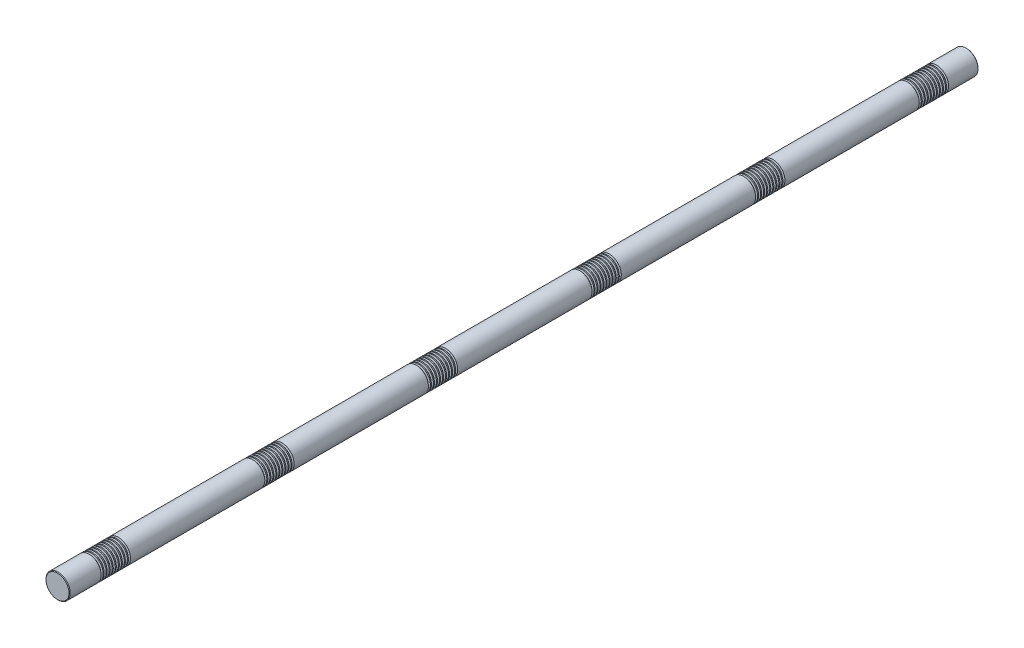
ISO-10303-21;
HEADER;
FILE_DESCRIPTION(('STEP AP214'),'2;1');
FILE_NAME('part.step','',(''),(''),'','','');
FILE_SCHEMA(('AUTOMOTIVE_DESIGN { 1 0 10303 214 1 1 1 1 }'));
ENDSEC;
DATA;
#1=APPLICATION_CONTEXT('core data for automotive mechanical design processes');
#2=APPLICATION_PROTOCOL_DEFINITION('international standard','automotive_design',2000,#1);
#3=PRODUCT_CONTEXT('',#1,'mechanical');
#4=PRODUCT('Part','Part','',(#3));
#5=PRODUCT_RELATED_PRODUCT_CATEGORY('part','',(#4));
#6=PRODUCT_DEFINITION_FORMATION('','',#4);
#7=PRODUCT_DEFINITION_CONTEXT('part definition',#1,'design');
#8=PRODUCT_DEFINITION('design','',#6,#7);
#9=PRODUCT_DEFINITION_SHAPE('','',#8);
#10=(LENGTH_UNIT() NAMED_UNIT(*) SI_UNIT(.MILLI.,.METRE.));
#11=(NAMED_UNIT(*) PLANE_ANGLE_UNIT() SI_UNIT($,.RADIAN.));
#12=(NAMED_UNIT(*) SI_UNIT($,.STERADIAN.) SOLID_ANGLE_UNIT());
#13=UNCERTAINTY_MEASURE_WITH_UNIT(LENGTH_MEASURE(1.E-05),#10,'distance_accuracy_value','');
#14=(GEOMETRIC_REPRESENTATION_CONTEXT(3) GLOBAL_UNCERTAINTY_ASSIGNED_CONTEXT((#13)) GLOBAL_UNIT_ASSIGNED_CONTEXT((#10,
#11,#12)) REPRESENTATION_CONTEXT('',''));
#15=CARTESIAN_POINT('',(0.,0.,0.));
#16=DIRECTION('',(0.,0.,1.));
#17=DIRECTION('',(1.,0.,0.));
#18=AXIS2_PLACEMENT_3D('',#15,#16,#17);
#19=CARTESIAN_POINT('',(0.,0.,1500.));
#20=DIRECTION('',(0.,0.,-1.));
#21=DIRECTION('',(-1.,0.,0.));
#22=AXIS2_PLACEMENT_3D('',#19,#20,#21);
#23=CYLINDRICAL_SURFACE('',#22,40.);
#24=CARTESIAN_POINT('',(0.,0.,1385.80384757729));
#25=DIRECTION('',(0.,0.,1.));
#26=DIRECTION('',(1.,0.,0.));
#27=AXIS2_PLACEMENT_3D('',#24,#25,#26);
#28=CIRCLE('',#27,40.);
#29=CARTESIAN_POINT('',(40.,0.,1385.80384757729));
#30=VERTEX_POINT('',#29);
#31=EDGE_CURVE('E994',#30,#30,#28,.T.);
#32=ORIENTED_EDGE('',*,*,#31,.T.);
#33=EDGE_LOOP('',(#32));
#34=FACE_BOUND('',#33,.T.);
#35=CARTESIAN_POINT('',(0.,0.,1389.19615242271));
#36=DIRECTION('',(0.,0.,1.));
#37=DIRECTION('',(1.,0.,0.));
#38=AXIS2_PLACEMENT_3D('',#35,#36,#37);
#39=CIRCLE('',#38,40.);
#40=CARTESIAN_POINT('',(40.,0.,1389.19615242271));
#41=VERTEX_POINT('',#40);
#42=EDGE_CURVE('E1006',#41,#41,#39,.T.);
#43=ORIENTED_EDGE('',*,*,#42,.F.);
#44=EDGE_LOOP('',(#43));
#45=FACE_BOUND('',#44,.T.);
#46=ADVANCED_FACE('F37',(#34,#45),#23,.T.);
#47=CARTESIAN_POINT('',(0.,0.,1375.80384757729));
#48=DIRECTION('',(0.,0.,1.));
#49=DIRECTION('',(1.,0.,0.));
#50=AXIS2_PLACEMENT_3D('',#47,#48,#49);
#51=CIRCLE('',#50,40.);
#52=CARTESIAN_POINT('',(40.,0.,1375.80384757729));
#53=VERTEX_POINT('',#52);
#54=EDGE_CURVE('E978',#53,#53,#51,.T.);
#55=ORIENTED_EDGE('',*,*,#54,.T.);
#56=EDGE_LOOP('',(#55));
#57=FACE_BOUND('',#56,.T.);
#58=CARTESIAN_POINT('',(0.,0.,1379.19615242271));
#59=DIRECTION('',(0.,0.,1.));
#60=DIRECTION('',(1.,0.,0.));
#61=AXIS2_PLACEMENT_3D('',#58,#59,#60);
#62=CIRCLE('',#61,40.);
#63=CARTESIAN_POINT('',(40.,0.,1379.19615242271));
#64=VERTEX_POINT('',#63);
#65=EDGE_CURVE('E990',#64,#64,#62,.T.);
#66=ORIENTED_EDGE('',*,*,#65,.F.);
#67=EDGE_LOOP('',(#66));
#68=FACE_BOUND('',#67,.T.);
#69=ADVANCED_FACE('F1041',(#57,#68),#23,.T.);
#70=CARTESIAN_POINT('',(0.,0.,1365.80384757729));
#71=DIRECTION('',(0.,0.,1.));
#72=DIRECTION('',(1.,0.,0.));
#73=AXIS2_PLACEMENT_3D('',#70,#71,#72);
#74=CIRCLE('',#73,40.);
#75=CARTESIAN_POINT('',(40.,0.,1365.80384757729));
#76=VERTEX_POINT('',#75);
#77=EDGE_CURVE('E962',#76,#76,#74,.T.);
#78=ORIENTED_EDGE('',*,*,#77,.T.);
#79=EDGE_LOOP('',(#78));
#80=FACE_BOUND('',#79,.T.);
#81=CARTESIAN_POINT('',(0.,0.,1369.19615242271));
#82=DIRECTION('',(0.,0.,1.));
#83=DIRECTION('',(1.,0.,0.));
#84=AXIS2_PLACEMENT_3D('',#81,#82,#83);
#85=CIRCLE('',#84,40.);
#86=CARTESIAN_POINT('',(40.,0.,1369.19615242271));
#87=VERTEX_POINT('',#86);
#88=EDGE_CURVE('E974',#87,#87,#85,.T.);
#89=ORIENTED_EDGE('',*,*,#88,.F.);
#90=EDGE_LOOP('',(#89));
#91=FACE_BOUND('',#90,.T.);
#92=ADVANCED_FACE('F1049',(#80,#91),#23,.T.);
#93=CARTESIAN_POINT('',(0.,0.,1355.80384757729));
#94=DIRECTION('',(0.,0.,1.));
#95=DIRECTION('',(1.,0.,0.));
#96=AXIS2_PLACEMENT_3D('',#93,#94,#95);
#97=CIRCLE('',#96,40.);
#98=CARTESIAN_POINT('',(40.,0.,1355.80384757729));
#99=VERTEX_POINT('',#98);
#100=EDGE_CURVE('E946',#99,#99,#97,.T.);
#101=ORIENTED_EDGE('',*,*,#100,.T.);
#102=EDGE_LOOP('',(#101));
#103=FACE_BOUND('',#102,.T.);
#104=CARTESIAN_POINT('',(0.,0.,1359.19615242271));
#105=DIRECTION('',(0.,0.,1.));
#106=DIRECTION('',(1.,0.,0.));
#107=AXIS2_PLACEMENT_3D('',#104,#105,#106);
#108=CIRCLE('',#107,40.);
#109=CARTESIAN_POINT('',(40.,0.,1359.19615242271));
#110=VERTEX_POINT('',#109);
#111=EDGE_CURVE('E958',#110,#110,#108,.T.);
#112=ORIENTED_EDGE('',*,*,#111,.F.);
#113=EDGE_LOOP('',(#112));
#114=FACE_BOUND('',#113,.T.);
#115=ADVANCED_FACE('F2338',(#103,#114),#23,.T.);
#116=CARTESIAN_POINT('',(0.,0.,1345.80384757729));
#117=DIRECTION('',(0.,0.,1.));
#118=DIRECTION('',(1.,0.,0.));
#119=AXIS2_PLACEMENT_3D('',#116,#117,#118);
#120=CIRCLE('',#119,40.);
#121=CARTESIAN_POINT('',(40.,0.,1345.80384757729));
#122=VERTEX_POINT('',#121);
#123=EDGE_CURVE('E930',#122,#122,#120,.T.);
#124=ORIENTED_EDGE('',*,*,#123,.T.);
#125=EDGE_LOOP('',(#124));
#126=FACE_BOUND('',#125,.T.);
#127=CARTESIAN_POINT('',(0.,0.,1349.19615242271));
#128=DIRECTION('',(0.,0.,1.));
#129=DIRECTION('',(1.,0.,0.));
#130=AXIS2_PLACEMENT_3D('',#127,#128,#129);
#131=CIRCLE('',#130,40.);
#132=CARTESIAN_POINT('',(40.,0.,1349.19615242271));
#133=VERTEX_POINT('',#132);
#134=EDGE_CURVE('E942',#133,#133,#131,.T.);
#135=ORIENTED_EDGE('',*,*,#134,.F.);
#136=EDGE_LOOP('',(#135));
#137=FACE_BOUND('',#136,.T.);
#138=ADVANCED_FACE('F2315',(#126,#137),#23,.T.);
#139=CARTESIAN_POINT('',(0.,0.,1335.80384757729));
#140=DIRECTION('',(0.,0.,1.));
#141=DIRECTION('',(1.,0.,0.));
#142=AXIS2_PLACEMENT_3D('',#139,#140,#141);
#143=CIRCLE('',#142,40.);
#144=CARTESIAN_POINT('',(40.,0.,1335.80384757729));
#145=VERTEX_POINT('',#144);
#146=EDGE_CURVE('E914',#145,#145,#143,.T.);
#147=ORIENTED_EDGE('',*,*,#146,.T.);
#148=EDGE_LOOP('',(#147));
#149=FACE_BOUND('',#148,.T.);
#150=CARTESIAN_POINT('',(0.,0.,1339.19615242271));
#151=DIRECTION('',(0.,0.,1.));
#152=DIRECTION('',(1.,0.,0.));
#153=AXIS2_PLACEMENT_3D('',#150,#151,#152);
#154=CIRCLE('',#153,40.);
#155=CARTESIAN_POINT('',(40.,0.,1339.19615242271));
#156=VERTEX_POINT('',#155);
#157=EDGE_CURVE('E926',#156,#156,#154,.T.);
#158=ORIENTED_EDGE('',*,*,#157,.F.);
#159=EDGE_LOOP('',(#158));
#160=FACE_BOUND('',#159,.T.);
#161=ADVANCED_FACE('F2292',(#149,#160),#23,.T.);
#162=CARTESIAN_POINT('',(0.,0.,1325.80384757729));
#163=DIRECTION('',(0.,0.,1.));
#164=DIRECTION('',(1.,0.,0.));
#165=AXIS2_PLACEMENT_3D('',#162,#163,#164);
#166=CIRCLE('',#165,40.);
#167=CARTESIAN_POINT('',(40.,0.,1325.80384757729));
#168=VERTEX_POINT('',#167);
#169=EDGE_CURVE('E898',#168,#168,#166,.T.);
#170=ORIENTED_EDGE('',*,*,#169,.T.);
#171=EDGE_LOOP('',(#170));
#172=FACE_BOUND('',#171,.T.);
#173=CARTESIAN_POINT('',(0.,0.,1329.19615242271));
#174=DIRECTION('',(0.,0.,1.));
#175=DIRECTION('',(1.,0.,0.));
#176=AXIS2_PLACEMENT_3D('',#173,#174,#175);
#177=CIRCLE('',#176,40.);
#178=CARTESIAN_POINT('',(40.,0.,1329.19615242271));
#179=VERTEX_POINT('',#178);
#180=EDGE_CURVE('E910',#179,#179,#177,.T.);
#181=ORIENTED_EDGE('',*,*,#180,.F.);
#182=EDGE_LOOP('',(#181));
#183=FACE_BOUND('',#182,.T.);
#184=ADVANCED_FACE('F2269',(#172,#183),#23,.T.);
#185=CARTESIAN_POINT('',(0.,0.,1315.80384757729));
#186=DIRECTION('',(0.,0.,1.));
#187=DIRECTION('',(1.,0.,0.));
#188=AXIS2_PLACEMENT_3D('',#185,#186,#187);
#189=CIRCLE('',#188,40.);
#190=CARTESIAN_POINT('',(40.,0.,1315.80384757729));
#191=VERTEX_POINT('',#190);
#192=EDGE_CURVE('E882',#191,#191,#189,.T.);
#193=ORIENTED_EDGE('',*,*,#192,.T.);
#194=EDGE_LOOP('',(#193));
#195=FACE_BOUND('',#194,.T.);
#196=CARTESIAN_POINT('',(0.,0.,1319.19615242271));
#197=DIRECTION('',(0.,0.,1.));
#198=DIRECTION('',(1.,0.,0.));
#199=AXIS2_PLACEMENT_3D('',#196,#197,#198);
#200=CIRCLE('',#199,40.);
#201=CARTESIAN_POINT('',(40.,0.,1319.19615242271));
#202=VERTEX_POINT('',#201);
#203=EDGE_CURVE('E894',#202,#202,#200,.T.);
#204=ORIENTED_EDGE('',*,*,#203,.F.);
#205=EDGE_LOOP('',(#204));
#206=FACE_BOUND('',#205,.T.);
#207=ADVANCED_FACE('F2250',(#195,#206),#23,.T.);
#208=CARTESIAN_POINT('',(0.,0.,1305.80384757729));
#209=DIRECTION('',(0.,0.,1.));
#210=DIRECTION('',(1.,0.,0.));
#211=AXIS2_PLACEMENT_3D('',#208,#209,#210);
#212=CIRCLE('',#211,40.);
#213=CARTESIAN_POINT('',(40.,0.,1305.80384757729));
#214=VERTEX_POINT('',#213);
#215=EDGE_CURVE('E292',#214,#214,#212,.T.);
#216=ORIENTED_EDGE('',*,*,#215,.T.);
#217=EDGE_LOOP('',(#216));
#218=FACE_BOUND('',#217,.T.);
#219=CARTESIAN_POINT('',(0.,0.,1309.19615242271));
#220=DIRECTION('',(0.,0.,1.));
#221=DIRECTION('',(1.,0.,0.));
#222=AXIS2_PLACEMENT_3D('',#219,#220,#221);
#223=CIRCLE('',#222,40.);
#224=CARTESIAN_POINT('',(40.,0.,1309.19615242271));
#225=VERTEX_POINT('',#224);
#226=EDGE_CURVE('E878',#225,#225,#223,.T.);
#227=ORIENTED_EDGE('',*,*,#226,.F.);
#228=EDGE_LOOP('',(#227));
#229=FACE_BOUND('',#228,.T.);
#230=ADVANCED_FACE('F2199',(#218,#229),#23,.T.);
#231=CARTESIAN_POINT('',(0.,0.,845.803847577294));
#232=DIRECTION('',(0.,0.,1.));
#233=DIRECTION('',(1.,0.,0.));
#234=AXIS2_PLACEMENT_3D('',#231,#232,#233);
#235=CIRCLE('',#234,40.);
#236=CARTESIAN_POINT('',(40.,0.,845.803847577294));
#237=VERTEX_POINT('',#236);
#238=EDGE_CURVE('E850',#237,#237,#235,.T.);
#239=ORIENTED_EDGE('',*,*,#238,.T.);
#240=EDGE_LOOP('',(#239));
#241=FACE_BOUND('',#240,.T.);
#242=CARTESIAN_POINT('',(0.,0.,849.196152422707));
#243=DIRECTION('',(0.,0.,1.));
#244=DIRECTION('',(1.,0.,0.));
#245=AXIS2_PLACEMENT_3D('',#242,#243,#244);
#246=CIRCLE('',#245,40.);
#247=CARTESIAN_POINT('',(40.,0.,849.196152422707));
#248=VERTEX_POINT('',#247);
#249=EDGE_CURVE('E862',#248,#248,#246,.T.);
#250=ORIENTED_EDGE('',*,*,#249,.F.);
#251=EDGE_LOOP('',(#250));
#252=FACE_BOUND('',#251,.T.);
#253=ADVANCED_FACE('F2175',(#241,#252),#23,.T.);
#254=CARTESIAN_POINT('',(0.,0.,835.803847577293));
#255=DIRECTION('',(0.,0.,1.));
#256=DIRECTION('',(1.,0.,0.));
#257=AXIS2_PLACEMENT_3D('',#254,#255,#256);
#258=CIRCLE('',#257,40.);
#259=CARTESIAN_POINT('',(40.,0.,835.803847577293));
#260=VERTEX_POINT('',#259);
#261=EDGE_CURVE('E834',#260,#260,#258,.T.);
#262=ORIENTED_EDGE('',*,*,#261,.T.);
#263=EDGE_LOOP('',(#262));
#264=FACE_BOUND('',#263,.T.);
#265=CARTESIAN_POINT('',(0.,0.,839.196152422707));
#266=DIRECTION('',(0.,0.,1.));
#267=DIRECTION('',(1.,0.,0.));
#268=AXIS2_PLACEMENT_3D('',#265,#266,#267);
#269=CIRCLE('',#268,40.);
#270=CARTESIAN_POINT('',(40.,0.,839.196152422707));
#271=VERTEX_POINT('',#270);
#272=EDGE_CURVE('E846',#271,#271,#269,.T.);
#273=ORIENTED_EDGE('',*,*,#272,.F.);
#274=EDGE_LOOP('',(#273));
#275=FACE_BOUND('',#274,.T.);
#276=ADVANCED_FACE('F2152',(#264,#275),#23,.T.);
#277=CARTESIAN_POINT('',(0.,0.,825.803847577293));
#278=DIRECTION('',(0.,0.,1.));
#279=DIRECTION('',(1.,0.,0.));
#280=AXIS2_PLACEMENT_3D('',#277,#278,#279);
#281=CIRCLE('',#280,40.);
#282=CARTESIAN_POINT('',(40.,0.,825.803847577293));
#283=VERTEX_POINT('',#282);
#284=EDGE_CURVE('E818',#283,#283,#281,.T.);
#285=ORIENTED_EDGE('',*,*,#284,.T.);
#286=EDGE_LOOP('',(#285));
#287=FACE_BOUND('',#286,.T.);
#288=CARTESIAN_POINT('',(0.,0.,829.196152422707));
#289=DIRECTION('',(0.,0.,1.));
#290=DIRECTION('',(1.,0.,0.));
#291=AXIS2_PLACEMENT_3D('',#288,#289,#290);
#292=CIRCLE('',#291,40.);
#293=CARTESIAN_POINT('',(40.,0.,829.196152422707));
#294=VERTEX_POINT('',#293);
#295=EDGE_CURVE('E830',#294,#294,#292,.T.);
#296=ORIENTED_EDGE('',*,*,#295,.F.);
#297=EDGE_LOOP('',(#296));
#298=FACE_BOUND('',#297,.T.);
#299=ADVANCED_FACE('F2129',(#287,#298),#23,.T.);
#300=CARTESIAN_POINT('',(0.,0.,815.803847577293));
#301=DIRECTION('',(0.,0.,1.));
#302=DIRECTION('',(1.,0.,0.));
#303=AXIS2_PLACEMENT_3D('',#300,#301,#302);
#304=CIRCLE('',#303,40.);
#305=CARTESIAN_POINT('',(40.,0.,815.803847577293));
#306=VERTEX_POINT('',#305);
#307=EDGE_CURVE('E802',#306,#306,#304,.T.);
#308=ORIENTED_EDGE('',*,*,#307,.T.);
#309=EDGE_LOOP('',(#308));
#310=FACE_BOUND('',#309,.T.);
#311=CARTESIAN_POINT('',(0.,0.,819.196152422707));
#312=DIRECTION('',(0.,0.,1.));
#313=DIRECTION('',(1.,0.,0.));
#314=AXIS2_PLACEMENT_3D('',#311,#312,#313);
#315=CIRCLE('',#314,40.);
#316=CARTESIAN_POINT('',(40.,0.,819.196152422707));
#317=VERTEX_POINT('',#316);
#318=EDGE_CURVE('E814',#317,#317,#315,.T.);
#319=ORIENTED_EDGE('',*,*,#318,.F.);
#320=EDGE_LOOP('',(#319));
#321=FACE_BOUND('',#320,.T.);
#322=ADVANCED_FACE('F2106',(#310,#321),#23,.T.);
#323=CARTESIAN_POINT('',(0.,0.,805.803847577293));
#324=DIRECTION('',(0.,0.,1.));
#325=DIRECTION('',(1.,0.,0.));
#326=AXIS2_PLACEMENT_3D('',#323,#324,#325);
#327=CIRCLE('',#326,40.);
#328=CARTESIAN_POINT('',(40.,0.,805.803847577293));
#329=VERTEX_POINT('',#328);
#330=EDGE_CURVE('E786',#329,#329,#327,.T.);
#331=ORIENTED_EDGE('',*,*,#330,.T.);
#332=EDGE_LOOP('',(#331));
#333=FACE_BOUND('',#332,.T.);
#334=CARTESIAN_POINT('',(0.,0.,809.196152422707));
#335=DIRECTION('',(0.,0.,1.));
#336=DIRECTION('',(1.,0.,0.));
#337=AXIS2_PLACEMENT_3D('',#334,#335,#336);
#338=CIRCLE('',#337,40.);
#339=CARTESIAN_POINT('',(40.,0.,809.196152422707));
#340=VERTEX_POINT('',#339);
#341=EDGE_CURVE('E798',#340,#340,#338,.T.);
#342=ORIENTED_EDGE('',*,*,#341,.F.);
#343=EDGE_LOOP('',(#342));
#344=FACE_BOUND('',#343,.T.);
#345=ADVANCED_FACE('F2083',(#333,#344),#23,.T.);
#346=CARTESIAN_POINT('',(0.,0.,795.803847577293));
#347=DIRECTION('',(0.,0.,1.));
#348=DIRECTION('',(1.,0.,0.));
#349=AXIS2_PLACEMENT_3D('',#346,#347,#348);
#350=CIRCLE('',#349,40.);
#351=CARTESIAN_POINT('',(40.,0.,795.803847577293));
#352=VERTEX_POINT('',#351);
#353=EDGE_CURVE('E770',#352,#352,#350,.T.);
#354=ORIENTED_EDGE('',*,*,#353,.T.);
#355=EDGE_LOOP('',(#354));
#356=FACE_BOUND('',#355,.T.);
#357=CARTESIAN_POINT('',(0.,0.,799.196152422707));
#358=DIRECTION('',(0.,0.,1.));
#359=DIRECTION('',(1.,0.,0.));
#360=AXIS2_PLACEMENT_3D('',#357,#358,#359);
#361=CIRCLE('',#360,40.);
#362=CARTESIAN_POINT('',(40.,0.,799.196152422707));
#363=VERTEX_POINT('',#362);
#364=EDGE_CURVE('E782',#363,#363,#361,.T.);
#365=ORIENTED_EDGE('',*,*,#364,.F.);
#366=EDGE_LOOP('',(#365));
#367=FACE_BOUND('',#366,.T.);
#368=ADVANCED_FACE('F2060',(#356,#367),#23,.T.);
#369=CARTESIAN_POINT('',(0.,0.,785.803847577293));
#370=DIRECTION('',(0.,0.,1.));
#371=DIRECTION('',(1.,0.,0.));
#372=AXIS2_PLACEMENT_3D('',#369,#370,#371);
#373=CIRCLE('',#372,40.);
#374=CARTESIAN_POINT('',(40.,0.,785.803847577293));
#375=VERTEX_POINT('',#374);
#376=EDGE_CURVE('E754',#375,#375,#373,.T.);
#377=ORIENTED_EDGE('',*,*,#376,.T.);
#378=EDGE_LOOP('',(#377));
#379=FACE_BOUND('',#378,.T.);
#380=CARTESIAN_POINT('',(0.,0.,789.196152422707));
#381=DIRECTION('',(0.,0.,1.));
#382=DIRECTION('',(1.,0.,0.));
#383=AXIS2_PLACEMENT_3D('',#380,#381,#382);
#384=CIRCLE('',#383,40.);
#385=CARTESIAN_POINT('',(40.,0.,789.196152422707));
#386=VERTEX_POINT('',#385);
#387=EDGE_CURVE('E766',#386,#386,#384,.T.);
#388=ORIENTED_EDGE('',*,*,#387,.F.);
#389=EDGE_LOOP('',(#388));
#390=FACE_BOUND('',#389,.T.);
#391=ADVANCED_FACE('F2037',(#379,#390),#23,.T.);
#392=CARTESIAN_POINT('',(0.,0.,775.803847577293));
#393=DIRECTION('',(0.,0.,1.));
#394=DIRECTION('',(1.,0.,0.));
#395=AXIS2_PLACEMENT_3D('',#392,#393,#394);
#396=CIRCLE('',#395,40.);
#397=CARTESIAN_POINT('',(40.,0.,775.803847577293));
#398=VERTEX_POINT('',#397);
#399=EDGE_CURVE('E738',#398,#398,#396,.T.);
#400=ORIENTED_EDGE('',*,*,#399,.T.);
#401=EDGE_LOOP('',(#400));
#402=FACE_BOUND('',#401,.T.);
#403=CARTESIAN_POINT('',(0.,0.,779.196152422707));
#404=DIRECTION('',(0.,0.,1.));
#405=DIRECTION('',(1.,0.,0.));
#406=AXIS2_PLACEMENT_3D('',#403,#404,#405);
#407=CIRCLE('',#406,40.);
#408=CARTESIAN_POINT('',(40.,0.,779.196152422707));
#409=VERTEX_POINT('',#408);
#410=EDGE_CURVE('E750',#409,#409,#407,.T.);
#411=ORIENTED_EDGE('',*,*,#410,.F.);
#412=EDGE_LOOP('',(#411));
#413=FACE_BOUND('',#412,.T.);
#414=ADVANCED_FACE('F2018',(#402,#413),#23,.T.);
#415=CARTESIAN_POINT('',(0.,0.,765.803847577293));
#416=DIRECTION('',(0.,0.,1.));
#417=DIRECTION('',(1.,0.,0.));
#418=AXIS2_PLACEMENT_3D('',#415,#416,#417);
#419=CIRCLE('',#418,40.);
#420=CARTESIAN_POINT('',(40.,0.,765.803847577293));
#421=VERTEX_POINT('',#420);
#422=EDGE_CURVE('E276',#421,#421,#419,.T.);
#423=ORIENTED_EDGE('',*,*,#422,.T.);
#424=EDGE_LOOP('',(#423));
#425=FACE_BOUND('',#424,.T.);
#426=CARTESIAN_POINT('',(0.,0.,769.196152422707));
#427=DIRECTION('',(0.,0.,1.));
#428=DIRECTION('',(1.,0.,0.));
#429=AXIS2_PLACEMENT_3D('',#426,#427,#428);
#430=CIRCLE('',#429,40.);
#431=CARTESIAN_POINT('',(40.,0.,769.196152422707));
#432=VERTEX_POINT('',#431);
#433=EDGE_CURVE('E735',#432,#432,#430,.T.);
#434=ORIENTED_EDGE('',*,*,#433,.F.);
#435=EDGE_LOOP('',(#434));
#436=FACE_BOUND('',#435,.T.);
#437=ADVANCED_FACE('F1967',(#425,#436),#23,.T.);
#438=CARTESIAN_POINT('',(0.,0.,305.803847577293));
#439=DIRECTION('',(0.,0.,1.));
#440=DIRECTION('',(1.,0.,0.));
#441=AXIS2_PLACEMENT_3D('',#438,#439,#440);
#442=CIRCLE('',#441,40.);
#443=CARTESIAN_POINT('',(40.,0.,305.803847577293));
#444=VERTEX_POINT('',#443);
#445=EDGE_CURVE('E707',#444,#444,#442,.T.);
#446=ORIENTED_EDGE('',*,*,#445,.T.);
#447=EDGE_LOOP('',(#446));
#448=FACE_BOUND('',#447,.T.);
#449=CARTESIAN_POINT('',(0.,0.,309.196152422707));
#450=DIRECTION('',(0.,0.,1.));
#451=DIRECTION('',(1.,0.,0.));
#452=AXIS2_PLACEMENT_3D('',#449,#450,#451);
#453=CIRCLE('',#452,40.);
#454=CARTESIAN_POINT('',(40.,0.,309.196152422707));
#455=VERTEX_POINT('',#454);
#456=EDGE_CURVE('E719',#455,#455,#453,.T.);
#457=ORIENTED_EDGE('',*,*,#456,.F.);
#458=EDGE_LOOP('',(#457));
#459=FACE_BOUND('',#458,.T.);
#460=ADVANCED_FACE('F1943',(#448,#459),#23,.T.);
#461=CARTESIAN_POINT('',(0.,0.,295.803847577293));
#462=DIRECTION('',(0.,0.,1.));
#463=DIRECTION('',(1.,0.,0.));
#464=AXIS2_PLACEMENT_3D('',#461,#462,#463);
#465=CIRCLE('',#464,40.);
#466=CARTESIAN_POINT('',(40.,0.,295.803847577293));
#467=VERTEX_POINT('',#466);
#468=EDGE_CURVE('E691',#467,#467,#465,.T.);
#469=ORIENTED_EDGE('',*,*,#468,.T.);
#470=EDGE_LOOP('',(#469));
#471=FACE_BOUND('',#470,.T.);
#472=CARTESIAN_POINT('',(0.,0.,299.196152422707));
#473=DIRECTION('',(0.,0.,1.));
#474=DIRECTION('',(1.,0.,0.));
#475=AXIS2_PLACEMENT_3D('',#472,#473,#474);
#476=CIRCLE('',#475,40.);
#477=CARTESIAN_POINT('',(40.,0.,299.196152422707));
#478=VERTEX_POINT('',#477);
#479=EDGE_CURVE('E703',#478,#478,#476,.T.);
#480=ORIENTED_EDGE('',*,*,#479,.F.);
#481=EDGE_LOOP('',(#480));
#482=FACE_BOUND('',#481,.T.);
#483=ADVANCED_FACE('F1920',(#471,#482),#23,.T.);
#484=CARTESIAN_POINT('',(0.,0.,285.803847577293));
#485=DIRECTION('',(0.,0.,1.));
#486=DIRECTION('',(1.,0.,0.));
#487=AXIS2_PLACEMENT_3D('',#484,#485,#486);
#488=CIRCLE('',#487,40.);
#489=CARTESIAN_POINT('',(40.,0.,285.803847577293));
#490=VERTEX_POINT('',#489);
#491=EDGE_CURVE('E675',#490,#490,#488,.T.);
#492=ORIENTED_EDGE('',*,*,#491,.T.);
#493=EDGE_LOOP('',(#492));
#494=FACE_BOUND('',#493,.T.);
#495=CARTESIAN_POINT('',(0.,0.,289.196152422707));
#496=DIRECTION('',(0.,0.,1.));
#497=DIRECTION('',(1.,0.,0.));
#498=AXIS2_PLACEMENT_3D('',#495,#496,#497);
#499=CIRCLE('',#498,40.);
#500=CARTESIAN_POINT('',(40.,0.,289.196152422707));
#501=VERTEX_POINT('',#500);
#502=EDGE_CURVE('E687',#501,#501,#499,.T.);
#503=ORIENTED_EDGE('',*,*,#502,.F.);
#504=EDGE_LOOP('',(#503));
#505=FACE_BOUND('',#504,.T.);
#506=ADVANCED_FACE('F1897',(#494,#505),#23,.T.);
#507=CARTESIAN_POINT('',(0.,0.,275.803847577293));
#508=DIRECTION('',(0.,0.,1.));
#509=DIRECTION('',(1.,0.,0.));
#510=AXIS2_PLACEMENT_3D('',#507,#508,#509);
#511=CIRCLE('',#510,40.);
#512=CARTESIAN_POINT('',(40.,0.,275.803847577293));
#513=VERTEX_POINT('',#512);
#514=EDGE_CURVE('E659',#513,#513,#511,.T.);
#515=ORIENTED_EDGE('',*,*,#514,.T.);
#516=EDGE_LOOP('',(#515));
#517=FACE_BOUND('',#516,.T.);
#518=CARTESIAN_POINT('',(0.,0.,279.196152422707));
#519=DIRECTION('',(0.,0.,1.));
#520=DIRECTION('',(1.,0.,0.));
#521=AXIS2_PLACEMENT_3D('',#518,#519,#520);
#522=CIRCLE('',#521,40.);
#523=CARTESIAN_POINT('',(40.,0.,279.196152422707));
#524=VERTEX_POINT('',#523);
#525=EDGE_CURVE('E671',#524,#524,#522,.T.);
#526=ORIENTED_EDGE('',*,*,#525,.F.);
#527=EDGE_LOOP('',(#526));
#528=FACE_BOUND('',#527,.T.);
#529=ADVANCED_FACE('F1874',(#517,#528),#23,.T.);
#530=CARTESIAN_POINT('',(0.,0.,265.803847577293));
#531=DIRECTION('',(0.,0.,1.));
#532=DIRECTION('',(1.,0.,0.));
#533=AXIS2_PLACEMENT_3D('',#530,#531,#532);
#534=CIRCLE('',#533,40.);
#535=CARTESIAN_POINT('',(40.,0.,265.803847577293));
#536=VERTEX_POINT('',#535);
#537=EDGE_CURVE('E643',#536,#536,#534,.T.);
#538=ORIENTED_EDGE('',*,*,#537,.T.);
#539=EDGE_LOOP('',(#538));
#540=FACE_BOUND('',#539,.T.);
#541=CARTESIAN_POINT('',(0.,0.,269.196152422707));
#542=DIRECTION('',(0.,0.,1.));
#543=DIRECTION('',(1.,0.,0.));
#544=AXIS2_PLACEMENT_3D('',#541,#542,#543);
#545=CIRCLE('',#544,40.);
#546=CARTESIAN_POINT('',(40.,0.,269.196152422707));
#547=VERTEX_POINT('',#546);
#548=EDGE_CURVE('E655',#547,#547,#545,.T.);
#549=ORIENTED_EDGE('',*,*,#548,.F.);
#550=EDGE_LOOP('',(#549));
#551=FACE_BOUND('',#550,.T.);
#552=ADVANCED_FACE('F1851',(#540,#551),#23,.T.);
#553=CARTESIAN_POINT('',(0.,0.,255.803847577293));
#554=DIRECTION('',(0.,0.,1.));
#555=DIRECTION('',(1.,0.,0.));
#556=AXIS2_PLACEMENT_3D('',#553,#554,#555);
#557=CIRCLE('',#556,40.);
#558=CARTESIAN_POINT('',(40.,0.,255.803847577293));
#559=VERTEX_POINT('',#558);
#560=EDGE_CURVE('E627',#559,#559,#557,.T.);
#561=ORIENTED_EDGE('',*,*,#560,.T.);
#562=EDGE_LOOP('',(#561));
#563=FACE_BOUND('',#562,.T.);
#564=CARTESIAN_POINT('',(0.,0.,259.196152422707));
#565=DIRECTION('',(0.,0.,1.));
#566=DIRECTION('',(1.,0.,0.));
#567=AXIS2_PLACEMENT_3D('',#564,#565,#566);
#568=CIRCLE('',#567,40.);
#569=CARTESIAN_POINT('',(40.,0.,259.196152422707));
#570=VERTEX_POINT('',#569);
#571=EDGE_CURVE('E639',#570,#570,#568,.T.);
#572=ORIENTED_EDGE('',*,*,#571,.F.);
#573=EDGE_LOOP('',(#572));
#574=FACE_BOUND('',#573,.T.);
#575=ADVANCED_FACE('F1828',(#563,#574),#23,.T.);
#576=CARTESIAN_POINT('',(0.,0.,245.803847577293));
#577=DIRECTION('',(0.,0.,1.));
#578=DIRECTION('',(1.,0.,0.));
#579=AXIS2_PLACEMENT_3D('',#576,#577,#578);
#580=CIRCLE('',#579,40.);
#581=CARTESIAN_POINT('',(40.,0.,245.803847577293));
#582=VERTEX_POINT('',#581);
#583=EDGE_CURVE('E611',#582,#582,#580,.T.);
#584=ORIENTED_EDGE('',*,*,#583,.T.);
#585=EDGE_LOOP('',(#584));
#586=FACE_BOUND('',#585,.T.);
#587=CARTESIAN_POINT('',(0.,0.,249.196152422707));
#588=DIRECTION('',(0.,0.,1.));
#589=DIRECTION('',(1.,0.,0.));
#590=AXIS2_PLACEMENT_3D('',#587,#588,#589);
#591=CIRCLE('',#590,40.);
#592=CARTESIAN_POINT('',(40.,0.,249.196152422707));
#593=VERTEX_POINT('',#592);
#594=EDGE_CURVE('E623',#593,#593,#591,.T.);
#595=ORIENTED_EDGE('',*,*,#594,.F.);
#596=EDGE_LOOP('',(#595));
#597=FACE_BOUND('',#596,.T.);
#598=ADVANCED_FACE('F1805',(#586,#597),#23,.T.);
#599=CARTESIAN_POINT('',(0.,0.,235.803847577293));
#600=DIRECTION('',(0.,0.,1.));
#601=DIRECTION('',(1.,0.,0.));
#602=AXIS2_PLACEMENT_3D('',#599,#600,#601);
#603=CIRCLE('',#602,40.);
#604=CARTESIAN_POINT('',(40.,0.,235.803847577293));
#605=VERTEX_POINT('',#604);
#606=EDGE_CURVE('E595',#605,#605,#603,.T.);
#607=ORIENTED_EDGE('',*,*,#606,.T.);
#608=EDGE_LOOP('',(#607));
#609=FACE_BOUND('',#608,.T.);
#610=CARTESIAN_POINT('',(0.,0.,239.196152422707));
#611=DIRECTION('',(0.,0.,1.));
#612=DIRECTION('',(1.,0.,0.));
#613=AXIS2_PLACEMENT_3D('',#610,#611,#612);
#614=CIRCLE('',#613,40.);
#615=CARTESIAN_POINT('',(40.,0.,239.196152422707));
#616=VERTEX_POINT('',#615);
#617=EDGE_CURVE('E607',#616,#616,#614,.T.);
#618=ORIENTED_EDGE('',*,*,#617,.F.);
#619=EDGE_LOOP('',(#618));
#620=FACE_BOUND('',#619,.T.);
#621=ADVANCED_FACE('F1786',(#609,#620),#23,.T.);
#622=CARTESIAN_POINT('',(0.,0.,225.803847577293));
#623=DIRECTION('',(0.,0.,1.));
#624=DIRECTION('',(1.,0.,0.));
#625=AXIS2_PLACEMENT_3D('',#622,#623,#624);
#626=CIRCLE('',#625,40.);
#627=CARTESIAN_POINT('',(40.,0.,225.803847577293));
#628=VERTEX_POINT('',#627);
#629=EDGE_CURVE('E260',#628,#628,#626,.T.);
#630=ORIENTED_EDGE('',*,*,#629,.T.);
#631=EDGE_LOOP('',(#630));
#632=FACE_BOUND('',#631,.T.);
#633=CARTESIAN_POINT('',(0.,0.,229.196152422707));
#634=DIRECTION('',(0.,0.,1.));
#635=DIRECTION('',(1.,0.,0.));
#636=AXIS2_PLACEMENT_3D('',#633,#634,#635);
#637=CIRCLE('',#636,40.);
#638=CARTESIAN_POINT('',(40.,0.,229.196152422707));
#639=VERTEX_POINT('',#638);
#640=EDGE_CURVE('E591',#639,#639,#637,.T.);
#641=ORIENTED_EDGE('',*,*,#640,.F.);
#642=EDGE_LOOP('',(#641));
#643=FACE_BOUND('',#642,.T.);
#644=ADVANCED_FACE('F1735',(#632,#643),#23,.T.);
#645=CARTESIAN_POINT('',(0.,0.,-234.196152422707));
#646=DIRECTION('',(0.,0.,1.));
#647=DIRECTION('',(1.,0.,0.));
#648=AXIS2_PLACEMENT_3D('',#645,#646,#647);
#649=CIRCLE('',#648,40.);
#650=CARTESIAN_POINT('',(40.,0.,-234.196152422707));
#651=VERTEX_POINT('',#650);
#652=EDGE_CURVE('E563',#651,#651,#649,.T.);
#653=ORIENTED_EDGE('',*,*,#652,.T.);
#654=EDGE_LOOP('',(#653));
#655=FACE_BOUND('',#654,.T.);
#656=CARTESIAN_POINT('',(0.,0.,-230.803847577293));
#657=DIRECTION('',(0.,0.,1.));
#658=DIRECTION('',(1.,0.,0.));
#659=AXIS2_PLACEMENT_3D('',#656,#657,#658);
#660=CIRCLE('',#659,40.);
#661=CARTESIAN_POINT('',(40.,0.,-230.803847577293));
#662=VERTEX_POINT('',#661);
#663=EDGE_CURVE('E575',#662,#662,#660,.T.);
#664=ORIENTED_EDGE('',*,*,#663,.F.);
#665=EDGE_LOOP('',(#664));
#666=FACE_BOUND('',#665,.T.);
#667=ADVANCED_FACE('F1711',(#655,#666),#23,.T.);
#668=CARTESIAN_POINT('',(0.,0.,-244.196152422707));
#669=DIRECTION('',(0.,0.,1.));
#670=DIRECTION('',(1.,0.,0.));
#671=AXIS2_PLACEMENT_3D('',#668,#669,#670);
#672=CIRCLE('',#671,40.);
#673=CARTESIAN_POINT('',(40.,0.,-244.196152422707));
#674=VERTEX_POINT('',#673);
#675=EDGE_CURVE('E547',#674,#674,#672,.T.);
#676=ORIENTED_EDGE('',*,*,#675,.T.);
#677=EDGE_LOOP('',(#676));
#678=FACE_BOUND('',#677,.T.);
#679=CARTESIAN_POINT('',(0.,0.,-240.803847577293));
#680=DIRECTION('',(0.,0.,1.));
#681=DIRECTION('',(1.,0.,0.));
#682=AXIS2_PLACEMENT_3D('',#679,#680,#681);
#683=CIRCLE('',#682,40.);
#684=CARTESIAN_POINT('',(40.,0.,-240.803847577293));
#685=VERTEX_POINT('',#684);
#686=EDGE_CURVE('E559',#685,#685,#683,.T.);
#687=ORIENTED_EDGE('',*,*,#686,.F.);
#688=EDGE_LOOP('',(#687));
#689=FACE_BOUND('',#688,.T.);
#690=ADVANCED_FACE('F1688',(#678,#689),#23,.T.);
#691=CARTESIAN_POINT('',(0.,0.,-254.196152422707));
#692=DIRECTION('',(0.,0.,1.));
#693=DIRECTION('',(1.,0.,0.));
#694=AXIS2_PLACEMENT_3D('',#691,#692,#693);
#695=CIRCLE('',#694,40.);
#696=CARTESIAN_POINT('',(40.,0.,-254.196152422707));
#697=VERTEX_POINT('',#696);
#698=EDGE_CURVE('E531',#697,#697,#695,.T.);
#699=ORIENTED_EDGE('',*,*,#698,.T.);
#700=EDGE_LOOP('',(#699));
#701=FACE_BOUND('',#700,.T.);
#702=CARTESIAN_POINT('',(0.,0.,-250.803847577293));
#703=DIRECTION('',(0.,0.,1.));
#704=DIRECTION('',(1.,0.,0.));
#705=AXIS2_PLACEMENT_3D('',#702,#703,#704);
#706=CIRCLE('',#705,40.);
#707=CARTESIAN_POINT('',(40.,0.,-250.803847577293));
#708=VERTEX_POINT('',#707);
#709=EDGE_CURVE('E543',#708,#708,#706,.T.);
#710=ORIENTED_EDGE('',*,*,#709,.F.);
#711=EDGE_LOOP('',(#710));
#712=FACE_BOUND('',#711,.T.);
#713=ADVANCED_FACE('F1665',(#701,#712),#23,.T.);
#714=CARTESIAN_POINT('',(0.,0.,-264.196152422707));
#715=DIRECTION('',(0.,0.,1.));
#716=DIRECTION('',(1.,0.,0.));
#717=AXIS2_PLACEMENT_3D('',#714,#715,#716);
#718=CIRCLE('',#717,40.);
#719=CARTESIAN_POINT('',(40.,0.,-264.196152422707));
#720=VERTEX_POINT('',#719);
#721=EDGE_CURVE('E515',#720,#720,#718,.T.);
#722=ORIENTED_EDGE('',*,*,#721,.T.);
#723=EDGE_LOOP('',(#722));
#724=FACE_BOUND('',#723,.T.);
#725=CARTESIAN_POINT('',(0.,0.,-260.803847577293));
#726=DIRECTION('',(0.,0.,1.));
#727=DIRECTION('',(1.,0.,0.));
#728=AXIS2_PLACEMENT_3D('',#725,#726,#727);
#729=CIRCLE('',#728,40.);
#730=CARTESIAN_POINT('',(40.,0.,-260.803847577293));
#731=VERTEX_POINT('',#730);
#732=EDGE_CURVE('E527',#731,#731,#729,.T.);
#733=ORIENTED_EDGE('',*,*,#732,.F.);
#734=EDGE_LOOP('',(#733));
#735=FACE_BOUND('',#734,.T.);
#736=ADVANCED_FACE('F1642',(#724,#735),#23,.T.);
#737=CARTESIAN_POINT('',(0.,0.,-274.196152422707));
#738=DIRECTION('',(0.,0.,1.));
#739=DIRECTION('',(1.,0.,0.));
#740=AXIS2_PLACEMENT_3D('',#737,#738,#739);
#741=CIRCLE('',#740,40.);
#742=CARTESIAN_POINT('',(40.,0.,-274.196152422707));
#743=VERTEX_POINT('',#742);
#744=EDGE_CURVE('E499',#743,#743,#741,.T.);
#745=ORIENTED_EDGE('',*,*,#744,.T.);
#746=EDGE_LOOP('',(#745));
#747=FACE_BOUND('',#746,.T.);
#748=CARTESIAN_POINT('',(0.,0.,-270.803847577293));
#749=DIRECTION('',(0.,0.,1.));
#750=DIRECTION('',(1.,0.,0.));
#751=AXIS2_PLACEMENT_3D('',#748,#749,#750);
#752=CIRCLE('',#751,40.);
#753=CARTESIAN_POINT('',(40.,0.,-270.803847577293));
#754=VERTEX_POINT('',#753);
#755=EDGE_CURVE('E511',#754,#754,#752,.T.);
#756=ORIENTED_EDGE('',*,*,#755,.F.);
#757=EDGE_LOOP('',(#756));
#758=FACE_BOUND('',#757,.T.);
#759=ADVANCED_FACE('F1619',(#747,#758),#23,.T.);
#760=CARTESIAN_POINT('',(0.,0.,-284.196152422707));
#761=DIRECTION('',(0.,0.,1.));
#762=DIRECTION('',(1.,0.,0.));
#763=AXIS2_PLACEMENT_3D('',#760,#761,#762);
#764=CIRCLE('',#763,40.);
#765=CARTESIAN_POINT('',(40.,0.,-284.196152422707));
#766=VERTEX_POINT('',#765);
#767=EDGE_CURVE('E483',#766,#766,#764,.T.);
#768=ORIENTED_EDGE('',*,*,#767,.T.);
#769=EDGE_LOOP('',(#768));
#770=FACE_BOUND('',#769,.T.);
#771=CARTESIAN_POINT('',(0.,0.,-280.803847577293));
#772=DIRECTION('',(0.,0.,1.));
#773=DIRECTION('',(1.,0.,0.));
#774=AXIS2_PLACEMENT_3D('',#771,#772,#773);
#775=CIRCLE('',#774,40.);
#776=CARTESIAN_POINT('',(40.,0.,-280.803847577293));
#777=VERTEX_POINT('',#776);
#778=EDGE_CURVE('E495',#777,#777,#775,.T.);
#779=ORIENTED_EDGE('',*,*,#778,.F.);
#780=EDGE_LOOP('',(#779));
#781=FACE_BOUND('',#780,.T.);
#782=ADVANCED_FACE('F1596',(#770,#781),#23,.T.);
#783=CARTESIAN_POINT('',(0.,0.,-294.196152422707));
#784=DIRECTION('',(0.,0.,1.));
#785=DIRECTION('',(1.,0.,0.));
#786=AXIS2_PLACEMENT_3D('',#783,#784,#785);
#787=CIRCLE('',#786,40.);
#788=CARTESIAN_POINT('',(40.,0.,-294.196152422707));
#789=VERTEX_POINT('',#788);
#790=EDGE_CURVE('E468',#789,#789,#787,.T.);
#791=ORIENTED_EDGE('',*,*,#790,.T.);
#792=EDGE_LOOP('',(#791));
#793=FACE_BOUND('',#792,.T.);
#794=CARTESIAN_POINT('',(0.,0.,-290.803847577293));
#795=DIRECTION('',(0.,0.,1.));
#796=DIRECTION('',(1.,0.,0.));
#797=AXIS2_PLACEMENT_3D('',#794,#795,#796);
#798=CIRCLE('',#797,40.);
#799=CARTESIAN_POINT('',(40.,0.,-290.803847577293));
#800=VERTEX_POINT('',#799);
#801=EDGE_CURVE('E479',#800,#800,#798,.T.);
#802=ORIENTED_EDGE('',*,*,#801,.F.);
#803=EDGE_LOOP('',(#802));
#804=FACE_BOUND('',#803,.T.);
#805=ADVANCED_FACE('F1573',(#793,#804),#23,.T.);
#806=CARTESIAN_POINT('',(0.,0.,-304.196152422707));
#807=DIRECTION('',(0.,0.,1.));
#808=DIRECTION('',(1.,0.,0.));
#809=AXIS2_PLACEMENT_3D('',#806,#807,#808);
#810=CIRCLE('',#809,40.);
#811=CARTESIAN_POINT('',(40.,0.,-304.196152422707));
#812=VERTEX_POINT('',#811);
#813=EDGE_CURVE('E452',#812,#812,#810,.T.);
#814=ORIENTED_EDGE('',*,*,#813,.T.);
#815=EDGE_LOOP('',(#814));
#816=FACE_BOUND('',#815,.T.);
#817=CARTESIAN_POINT('',(0.,0.,-300.803847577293));
#818=DIRECTION('',(0.,0.,1.));
#819=DIRECTION('',(1.,0.,0.));
#820=AXIS2_PLACEMENT_3D('',#817,#818,#819);
#821=CIRCLE('',#820,40.);
#822=CARTESIAN_POINT('',(40.,0.,-300.803847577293));
#823=VERTEX_POINT('',#822);
#824=EDGE_CURVE('E464',#823,#823,#821,.T.);
#825=ORIENTED_EDGE('',*,*,#824,.F.);
#826=EDGE_LOOP('',(#825));
#827=FACE_BOUND('',#826,.T.);
#828=ADVANCED_FACE('F1554',(#816,#827),#23,.T.);
#829=CARTESIAN_POINT('',(0.,0.,-314.196152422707));
#830=DIRECTION('',(0.,0.,1.));
#831=DIRECTION('',(1.,0.,0.));
#832=AXIS2_PLACEMENT_3D('',#829,#830,#831);
#833=CIRCLE('',#832,40.);
#834=CARTESIAN_POINT('',(40.,0.,-314.196152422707));
#835=VERTEX_POINT('',#834);
#836=EDGE_CURVE('E244',#835,#835,#833,.T.);
#837=ORIENTED_EDGE('',*,*,#836,.T.);
#838=EDGE_LOOP('',(#837));
#839=FACE_BOUND('',#838,.T.);
#840=CARTESIAN_POINT('',(0.,0.,-310.803847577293));
#841=DIRECTION('',(0.,0.,1.));
#842=DIRECTION('',(1.,0.,0.));
#843=AXIS2_PLACEMENT_3D('',#840,#841,#842);
#844=CIRCLE('',#843,40.);
#845=CARTESIAN_POINT('',(40.,0.,-310.803847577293));
#846=VERTEX_POINT('',#845);
#847=EDGE_CURVE('E448',#846,#846,#844,.T.);
#848=ORIENTED_EDGE('',*,*,#847,.F.);
#849=EDGE_LOOP('',(#848));
#850=FACE_BOUND('',#849,.T.);
#851=ADVANCED_FACE('F1503',(#839,#850),#23,.T.);
#852=CARTESIAN_POINT('',(0.,0.,-774.196152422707));
#853=DIRECTION('',(0.,0.,1.));
#854=DIRECTION('',(1.,0.,0.));
#855=AXIS2_PLACEMENT_3D('',#852,#853,#854);
#856=CIRCLE('',#855,40.);
#857=CARTESIAN_POINT('',(40.,0.,-774.196152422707));
#858=VERTEX_POINT('',#857);
#859=EDGE_CURVE('E420',#858,#858,#856,.T.);
#860=ORIENTED_EDGE('',*,*,#859,.T.);
#861=EDGE_LOOP('',(#860));
#862=FACE_BOUND('',#861,.T.);
#863=CARTESIAN_POINT('',(0.,0.,-770.803847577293));
#864=DIRECTION('',(0.,0.,1.));
#865=DIRECTION('',(1.,0.,0.));
#866=AXIS2_PLACEMENT_3D('',#863,#864,#865);
#867=CIRCLE('',#866,40.);
#868=CARTESIAN_POINT('',(40.,0.,-770.803847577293));
#869=VERTEX_POINT('',#868);
#870=EDGE_CURVE('E432',#869,#869,#867,.T.);
#871=ORIENTED_EDGE('',*,*,#870,.F.);
#872=EDGE_LOOP('',(#871));
#873=FACE_BOUND('',#872,.T.);
#874=ADVANCED_FACE('F1479',(#862,#873),#23,.T.);
#875=CARTESIAN_POINT('',(0.,0.,-784.196152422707));
#876=DIRECTION('',(0.,0.,1.));
#877=DIRECTION('',(1.,0.,0.));
#878=AXIS2_PLACEMENT_3D('',#875,#876,#877);
#879=CIRCLE('',#878,40.);
#880=CARTESIAN_POINT('',(40.,0.,-784.196152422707));
#881=VERTEX_POINT('',#880);
#882=EDGE_CURVE('E404',#881,#881,#879,.T.);
#883=ORIENTED_EDGE('',*,*,#882,.T.);
#884=EDGE_LOOP('',(#883));
#885=FACE_BOUND('',#884,.T.);
#886=CARTESIAN_POINT('',(0.,0.,-780.803847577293));
#887=DIRECTION('',(0.,0.,1.));
#888=DIRECTION('',(1.,0.,0.));
#889=AXIS2_PLACEMENT_3D('',#886,#887,#888);
#890=CIRCLE('',#889,40.);
#891=CARTESIAN_POINT('',(40.,0.,-780.803847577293));
#892=VERTEX_POINT('',#891);
#893=EDGE_CURVE('E416',#892,#892,#890,.T.);
#894=ORIENTED_EDGE('',*,*,#893,.F.);
#895=EDGE_LOOP('',(#894));
#896=FACE_BOUND('',#895,.T.);
#897=ADVANCED_FACE('F1456',(#885,#896),#23,.T.);
#898=CARTESIAN_POINT('',(0.,0.,-794.196152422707));
#899=DIRECTION('',(0.,0.,1.));
#900=DIRECTION('',(1.,0.,0.));
#901=AXIS2_PLACEMENT_3D('',#898,#899,#900);
#902=CIRCLE('',#901,40.);
#903=CARTESIAN_POINT('',(40.,0.,-794.196152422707));
#904=VERTEX_POINT('',#903);
#905=EDGE_CURVE('E388',#904,#904,#902,.T.);
#906=ORIENTED_EDGE('',*,*,#905,.T.);
#907=EDGE_LOOP('',(#906));
#908=FACE_BOUND('',#907,.T.);
#909=CARTESIAN_POINT('',(0.,0.,-790.803847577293));
#910=DIRECTION('',(0.,0.,1.));
#911=DIRECTION('',(1.,0.,0.));
#912=AXIS2_PLACEMENT_3D('',#909,#910,#911);
#913=CIRCLE('',#912,40.);
#914=CARTESIAN_POINT('',(40.,0.,-790.803847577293));
#915=VERTEX_POINT('',#914);
#916=EDGE_CURVE('E400',#915,#915,#913,.T.);
#917=ORIENTED_EDGE('',*,*,#916,.F.);
#918=EDGE_LOOP('',(#917));
#919=FACE_BOUND('',#918,.T.);
#920=ADVANCED_FACE('F1433',(#908,#919),#23,.T.);
#921=CARTESIAN_POINT('',(0.,0.,-804.196152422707));
#922=DIRECTION('',(0.,0.,1.));
#923=DIRECTION('',(1.,0.,0.));
#924=AXIS2_PLACEMENT_3D('',#921,#922,#923);
#925=CIRCLE('',#924,40.);
#926=CARTESIAN_POINT('',(40.,0.,-804.196152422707));
#927=VERTEX_POINT('',#926);
#928=EDGE_CURVE('E372',#927,#927,#925,.T.);
#929=ORIENTED_EDGE('',*,*,#928,.T.);
#930=EDGE_LOOP('',(#929));
#931=FACE_BOUND('',#930,.T.);
#932=CARTESIAN_POINT('',(0.,0.,-800.803847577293));
#933=DIRECTION('',(0.,0.,1.));
#934=DIRECTION('',(1.,0.,0.));
#935=AXIS2_PLACEMENT_3D('',#932,#933,#934);
#936=CIRCLE('',#935,40.);
#937=CARTESIAN_POINT('',(40.,0.,-800.803847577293));
#938=VERTEX_POINT('',#937);
#939=EDGE_CURVE('E384',#938,#938,#936,.T.);
#940=ORIENTED_EDGE('',*,*,#939,.F.);
#941=EDGE_LOOP('',(#940));
#942=FACE_BOUND('',#941,.T.);
#943=ADVANCED_FACE('F1410',(#931,#942),#23,.T.);
#944=CARTESIAN_POINT('',(0.,0.,-814.196152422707));
#945=DIRECTION('',(0.,0.,1.));
#946=DIRECTION('',(1.,0.,0.));
#947=AXIS2_PLACEMENT_3D('',#944,#945,#946);
#948=CIRCLE('',#947,40.);
#949=CARTESIAN_POINT('',(40.,0.,-814.196152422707));
#950=VERTEX_POINT('',#949);
#951=EDGE_CURVE('E356',#950,#950,#948,.T.);
#952=ORIENTED_EDGE('',*,*,#951,.T.);
#953=EDGE_LOOP('',(#952));
#954=FACE_BOUND('',#953,.T.);
#955=CARTESIAN_POINT('',(0.,0.,-810.803847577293));
#956=DIRECTION('',(0.,0.,1.));
#957=DIRECTION('',(1.,0.,0.));
#958=AXIS2_PLACEMENT_3D('',#955,#956,#957);
#959=CIRCLE('',#958,40.);
#960=CARTESIAN_POINT('',(40.,0.,-810.803847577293));
#961=VERTEX_POINT('',#960);
#962=EDGE_CURVE('E368',#961,#961,#959,.T.);
#963=ORIENTED_EDGE('',*,*,#962,.F.);
#964=EDGE_LOOP('',(#963));
#965=FACE_BOUND('',#964,.T.);
#966=ADVANCED_FACE('F1387',(#954,#965),#23,.T.);
#967=CARTESIAN_POINT('',(0.,0.,-824.196152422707));
#968=DIRECTION('',(0.,0.,1.));
#969=DIRECTION('',(1.,0.,0.));
#970=AXIS2_PLACEMENT_3D('',#967,#968,#969);
#971=CIRCLE('',#970,40.);
#972=CARTESIAN_POINT('',(40.,0.,-824.196152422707));
#973=VERTEX_POINT('',#972);
#974=EDGE_CURVE('E340',#973,#973,#971,.T.);
#975=ORIENTED_EDGE('',*,*,#974,.T.);
#976=EDGE_LOOP('',(#975));
#977=FACE_BOUND('',#976,.T.);
#978=CARTESIAN_POINT('',(0.,0.,-820.803847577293));
#979=DIRECTION('',(0.,0.,1.));
#980=DIRECTION('',(1.,0.,0.));
#981=AXIS2_PLACEMENT_3D('',#978,#979,#980);
#982=CIRCLE('',#981,40.);
#983=CARTESIAN_POINT('',(40.,0.,-820.803847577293));
#984=VERTEX_POINT('',#983);
#985=EDGE_CURVE('E352',#984,#984,#982,.T.);
#986=ORIENTED_EDGE('',*,*,#985,.F.);
#987=EDGE_LOOP('',(#986));
#988=FACE_BOUND('',#987,.T.);
#989=ADVANCED_FACE('F1364',(#977,#988),#23,.T.);
#990=CARTESIAN_POINT('',(0.,0.,-834.196152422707));
#991=DIRECTION('',(0.,0.,1.));
#992=DIRECTION('',(1.,0.,0.));
#993=AXIS2_PLACEMENT_3D('',#990,#991,#992);
#994=CIRCLE('',#993,40.);
#995=CARTESIAN_POINT('',(40.,0.,-834.196152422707));
#996=VERTEX_POINT('',#995);
#997=EDGE_CURVE('E324',#996,#996,#994,.T.);
#998=ORIENTED_EDGE('',*,*,#997,.T.);
#999=EDGE_LOOP('',(#998));
#1000=FACE_BOUND('',#999,.T.);
#1001=CARTESIAN_POINT('',(0.,0.,-830.803847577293));
#1002=DIRECTION('',(0.,0.,1.));
#1003=DIRECTION('',(1.,0.,0.));
#1004=AXIS2_PLACEMENT_3D('',#1001,#1002,#1003);
#1005=CIRCLE('',#1004,40.);
#1006=CARTESIAN_POINT('',(40.,0.,-830.803847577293));
#1007=VERTEX_POINT('',#1006);
#1008=EDGE_CURVE('E336',#1007,#1007,#1005,.T.);
#1009=ORIENTED_EDGE('',*,*,#1008,.F.);
#1010=EDGE_LOOP('',(#1009));
#1011=FACE_BOUND('',#1010,.T.);
#1012=ADVANCED_FACE('F1341',(#1000,#1011),#23,.T.);
#1013=CARTESIAN_POINT('',(0.,0.,-844.196152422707));
#1014=DIRECTION('',(0.,0.,1.));
#1015=DIRECTION('',(1.,0.,0.));
#1016=AXIS2_PLACEMENT_3D('',#1013,#1014,#1015);
#1017=CIRCLE('',#1016,40.);
#1018=CARTESIAN_POINT('',(40.,0.,-844.196152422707));
#1019=VERTEX_POINT('',#1018);
#1020=EDGE_CURVE('E308',#1019,#1019,#1017,.T.);
#1021=ORIENTED_EDGE('',*,*,#1020,.T.);
#1022=EDGE_LOOP('',(#1021));
#1023=FACE_BOUND('',#1022,.T.);
#1024=CARTESIAN_POINT('',(0.,0.,-840.803847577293));
#1025=DIRECTION('',(0.,0.,1.));
#1026=DIRECTION('',(1.,0.,0.));
#1027=AXIS2_PLACEMENT_3D('',#1024,#1025,#1026);
#1028=CIRCLE('',#1027,40.);
#1029=CARTESIAN_POINT('',(40.,0.,-840.803847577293));
#1030=VERTEX_POINT('',#1029);
#1031=EDGE_CURVE('E320',#1030,#1030,#1028,.T.);
#1032=ORIENTED_EDGE('',*,*,#1031,.F.);
#1033=EDGE_LOOP('',(#1032));
#1034=FACE_BOUND('',#1033,.T.);
#1035=ADVANCED_FACE('F1318',(#1023,#1034),#23,.T.);
#1036=CARTESIAN_POINT('',(0.,0.,-854.196152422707));
#1037=DIRECTION('',(0.,0.,1.));
#1038=DIRECTION('',(1.,0.,0.));
#1039=AXIS2_PLACEMENT_3D('',#1036,#1037,#1038);
#1040=CIRCLE('',#1039,40.);
#1041=CARTESIAN_POINT('',(40.,0.,-854.196152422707));
#1042=VERTEX_POINT('',#1041);
#1043=EDGE_CURVE('E228',#1042,#1042,#1040,.T.);
#1044=ORIENTED_EDGE('',*,*,#1043,.T.);
#1045=EDGE_LOOP('',(#1044));
#1046=FACE_BOUND('',#1045,.T.);
#1047=CARTESIAN_POINT('',(0.,0.,-850.803847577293));
#1048=DIRECTION('',(0.,0.,1.));
#1049=DIRECTION('',(1.,0.,0.));
#1050=AXIS2_PLACEMENT_3D('',#1047,#1048,#1049);
#1051=CIRCLE('',#1050,40.);
#1052=CARTESIAN_POINT('',(40.,0.,-850.803847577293));
#1053=VERTEX_POINT('',#1052);
#1054=EDGE_CURVE('E304',#1053,#1053,#1051,.T.);
#1055=ORIENTED_EDGE('',*,*,#1054,.F.);
#1056=EDGE_LOOP('',(#1055));
#1057=FACE_BOUND('',#1056,.T.);
#1058=ADVANCED_FACE('F1295',(#1046,#1057),#23,.T.);
#1059=CARTESIAN_POINT('',(0.,0.,-1304.19615242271));
#1060=DIRECTION('',(0.,0.,1.));
#1061=DIRECTION('',(1.,0.,0.));
#1062=AXIS2_PLACEMENT_3D('',#1059,#1060,#1061);
#1063=CIRCLE('',#1062,40.);
#1064=CARTESIAN_POINT('',(40.,0.,-1304.19615242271));
#1065=VERTEX_POINT('',#1064);
#1066=EDGE_CURVE('E212',#1065,#1065,#1063,.T.);
#1067=ORIENTED_EDGE('',*,*,#1066,.T.);
#1068=EDGE_LOOP('',(#1067));
#1069=FACE_BOUND('',#1068,.T.);
#1070=CARTESIAN_POINT('',(0.,0.,-860.803847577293));
#1071=DIRECTION('',(0.,0.,1.));
#1072=DIRECTION('',(1.,0.,0.));
#1073=AXIS2_PLACEMENT_3D('',#1070,#1071,#1072);
#1074=CIRCLE('',#1073,40.);
#1075=CARTESIAN_POINT('',(40.,0.,-860.803847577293));
#1076=VERTEX_POINT('',#1075);
#1077=EDGE_CURVE('E224',#1076,#1076,#1074,.T.);
#1078=ORIENTED_EDGE('',*,*,#1077,.F.);
#1079=EDGE_LOOP('',(#1078));
#1080=FACE_BOUND('',#1079,.T.);
#1081=ADVANCED_FACE('F1272',(#1069,#1080),#23,.T.);
#1082=CARTESIAN_POINT('',(0.,0.,-1314.19615242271));
#1083=DIRECTION('',(0.,0.,1.));
#1084=DIRECTION('',(1.,0.,0.));
#1085=AXIS2_PLACEMENT_3D('',#1082,#1083,#1084);
#1086=CIRCLE('',#1085,40.);
#1087=CARTESIAN_POINT('',(40.,0.,-1314.19615242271));
#1088=VERTEX_POINT('',#1087);
#1089=EDGE_CURVE('E196',#1088,#1088,#1086,.T.);
#1090=ORIENTED_EDGE('',*,*,#1089,.T.);
#1091=EDGE_LOOP('',(#1090));
#1092=FACE_BOUND('',#1091,.T.);
#1093=CARTESIAN_POINT('',(0.,0.,-1310.80384757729));
#1094=DIRECTION('',(0.,0.,1.));
#1095=DIRECTION('',(1.,0.,0.));
#1096=AXIS2_PLACEMENT_3D('',#1093,#1094,#1095);
#1097=CIRCLE('',#1096,40.);
#1098=CARTESIAN_POINT('',(40.,0.,-1310.80384757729));
#1099=VERTEX_POINT('',#1098);
#1100=EDGE_CURVE('E208',#1099,#1099,#1097,.T.);
#1101=ORIENTED_EDGE('',*,*,#1100,.F.);
#1102=EDGE_LOOP('',(#1101));
#1103=FACE_BOUND('',#1102,.T.);
#1104=ADVANCED_FACE('F1249',(#1092,#1103),#23,.T.);
#1105=CARTESIAN_POINT('',(0.,0.,-1324.19615242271));
#1106=DIRECTION('',(0.,0.,1.));
#1107=DIRECTION('',(1.,0.,0.));
#1108=AXIS2_PLACEMENT_3D('',#1105,#1106,#1107);
#1109=CIRCLE('',#1108,40.);
#1110=CARTESIAN_POINT('',(40.,0.,-1324.19615242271));
#1111=VERTEX_POINT('',#1110);
#1112=EDGE_CURVE('E180',#1111,#1111,#1109,.T.);
#1113=ORIENTED_EDGE('',*,*,#1112,.T.);
#1114=EDGE_LOOP('',(#1113));
#1115=FACE_BOUND('',#1114,.T.);
#1116=CARTESIAN_POINT('',(0.,0.,-1320.80384757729));
#1117=DIRECTION('',(0.,0.,1.));
#1118=DIRECTION('',(1.,0.,0.));
#1119=AXIS2_PLACEMENT_3D('',#1116,#1117,#1118);
#1120=CIRCLE('',#1119,40.);
#1121=CARTESIAN_POINT('',(40.,0.,-1320.80384757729));
#1122=VERTEX_POINT('',#1121);
#1123=EDGE_CURVE('E192',#1122,#1122,#1120,.T.);
#1124=ORIENTED_EDGE('',*,*,#1123,.F.);
#1125=EDGE_LOOP('',(#1124));
#1126=FACE_BOUND('',#1125,.T.);
#1127=ADVANCED_FACE('F1226',(#1115,#1126),#23,.T.);
#1128=CARTESIAN_POINT('',(0.,0.,-1334.19615242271));
#1129=DIRECTION('',(0.,0.,1.));
#1130=DIRECTION('',(1.,0.,0.));
#1131=AXIS2_PLACEMENT_3D('',#1128,#1129,#1130);
#1132=CIRCLE('',#1131,40.);
#1133=CARTESIAN_POINT('',(40.,0.,-1334.19615242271));
#1134=VERTEX_POINT('',#1133);
#1135=EDGE_CURVE('E164',#1134,#1134,#1132,.T.);
#1136=ORIENTED_EDGE('',*,*,#1135,.T.);
#1137=EDGE_LOOP('',(#1136));
#1138=FACE_BOUND('',#1137,.T.);
#1139=CARTESIAN_POINT('',(0.,0.,-1330.80384757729));
#1140=DIRECTION('',(0.,0.,1.));
#1141=DIRECTION('',(1.,0.,0.));
#1142=AXIS2_PLACEMENT_3D('',#1139,#1140,#1141);
#1143=CIRCLE('',#1142,40.);
#1144=CARTESIAN_POINT('',(40.,0.,-1330.80384757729));
#1145=VERTEX_POINT('',#1144);
#1146=EDGE_CURVE('E176',#1145,#1145,#1143,.T.);
#1147=ORIENTED_EDGE('',*,*,#1146,.F.);
#1148=EDGE_LOOP('',(#1147));
#1149=FACE_BOUND('',#1148,.T.);
#1150=ADVANCED_FACE('F1203',(#1138,#1149),#23,.T.);
#1151=CARTESIAN_POINT('',(0.,0.,-1344.19615242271));
#1152=DIRECTION('',(0.,0.,1.));
#1153=DIRECTION('',(1.,0.,0.));
#1154=AXIS2_PLACEMENT_3D('',#1151,#1152,#1153);
#1155=CIRCLE('',#1154,40.);
#1156=CARTESIAN_POINT('',(40.,0.,-1344.19615242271));
#1157=VERTEX_POINT('',#1156);
#1158=EDGE_CURVE('E148',#1157,#1157,#1155,.T.);
#1159=ORIENTED_EDGE('',*,*,#1158,.T.);
#1160=EDGE_LOOP('',(#1159));
#1161=FACE_BOUND('',#1160,.T.);
#1162=CARTESIAN_POINT('',(0.,0.,-1340.80384757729));
#1163=DIRECTION('',(0.,0.,1.));
#1164=DIRECTION('',(1.,0.,0.));
#1165=AXIS2_PLACEMENT_3D('',#1162,#1163,#1164);
#1166=CIRCLE('',#1165,40.);
#1167=CARTESIAN_POINT('',(40.,0.,-1340.80384757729));
#1168=VERTEX_POINT('',#1167);
#1169=EDGE_CURVE('E160',#1168,#1168,#1166,.T.);
#1170=ORIENTED_EDGE('',*,*,#1169,.F.);
#1171=EDGE_LOOP('',(#1170));
#1172=FACE_BOUND('',#1171,.T.);
#1173=ADVANCED_FACE('F1180',(#1161,#1172),#23,.T.);
#1174=CARTESIAN_POINT('',(0.,0.,-1354.19615242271));
#1175=DIRECTION('',(0.,0.,1.));
#1176=DIRECTION('',(1.,0.,0.));
#1177=AXIS2_PLACEMENT_3D('',#1174,#1175,#1176);
#1178=CIRCLE('',#1177,40.);
#1179=CARTESIAN_POINT('',(40.,0.,-1354.19615242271));
#1180=VERTEX_POINT('',#1179);
#1181=EDGE_CURVE('E132',#1180,#1180,#1178,.T.);
#1182=ORIENTED_EDGE('',*,*,#1181,.T.);
#1183=EDGE_LOOP('',(#1182));
#1184=FACE_BOUND('',#1183,.T.);
#1185=CARTESIAN_POINT('',(0.,0.,-1350.80384757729));
#1186=DIRECTION('',(0.,0.,1.));
#1187=DIRECTION('',(1.,0.,0.));
#1188=AXIS2_PLACEMENT_3D('',#1185,#1186,#1187);
#1189=CIRCLE('',#1188,40.);
#1190=CARTESIAN_POINT('',(40.,0.,-1350.80384757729));
#1191=VERTEX_POINT('',#1190);
#1192=EDGE_CURVE('E144',#1191,#1191,#1189,.T.);
#1193=ORIENTED_EDGE('',*,*,#1192,.F.);
#1194=EDGE_LOOP('',(#1193));
#1195=FACE_BOUND('',#1194,.T.);
#1196=ADVANCED_FACE('F1157',(#1184,#1195),#23,.T.);
#1197=CARTESIAN_POINT('',(0.,0.,-1364.19615242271));
#1198=DIRECTION('',(0.,0.,1.));
#1199=DIRECTION('',(1.,0.,0.));
#1200=AXIS2_PLACEMENT_3D('',#1197,#1198,#1199);
#1201=CIRCLE('',#1200,40.);
#1202=CARTESIAN_POINT('',(40.,0.,-1364.19615242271));
#1203=VERTEX_POINT('',#1202);
#1204=EDGE_CURVE('E116',#1203,#1203,#1201,.T.);
#1205=ORIENTED_EDGE('',*,*,#1204,.T.);
#1206=EDGE_LOOP('',(#1205));
#1207=FACE_BOUND('',#1206,.T.);
#1208=CARTESIAN_POINT('',(0.,0.,-1360.80384757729));
#1209=DIRECTION('',(0.,0.,1.));
#1210=DIRECTION('',(1.,0.,0.));
#1211=AXIS2_PLACEMENT_3D('',#1208,#1209,#1210);
#1212=CIRCLE('',#1211,40.);
#1213=CARTESIAN_POINT('',(40.,0.,-1360.80384757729));
#1214=VERTEX_POINT('',#1213);
#1215=EDGE_CURVE('E128',#1214,#1214,#1212,.T.);
#1216=ORIENTED_EDGE('',*,*,#1215,.F.);
#1217=EDGE_LOOP('',(#1216));
#1218=FACE_BOUND('',#1217,.T.);
#1219=ADVANCED_FACE('F1134',(#1207,#1218),#23,.T.);
#1220=CARTESIAN_POINT('',(0.,0.,-1374.19615242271));
#1221=DIRECTION('',(0.,0.,1.));
#1222=DIRECTION('',(1.,0.,0.));
#1223=AXIS2_PLACEMENT_3D('',#1220,#1221,#1222);
#1224=CIRCLE('',#1223,40.);
#1225=CARTESIAN_POINT('',(40.,0.,-1374.19615242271));
#1226=VERTEX_POINT('',#1225);
#1227=EDGE_CURVE('E100',#1226,#1226,#1224,.T.);
#1228=ORIENTED_EDGE('',*,*,#1227,.T.);
#1229=EDGE_LOOP('',(#1228));
#1230=FACE_BOUND('',#1229,.T.);
#1231=CARTESIAN_POINT('',(0.,0.,-1370.80384757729));
#1232=DIRECTION('',(0.,0.,1.));
#1233=DIRECTION('',(1.,0.,0.));
#1234=AXIS2_PLACEMENT_3D('',#1231,#1232,#1233);
#1235=CIRCLE('',#1234,40.);
#1236=CARTESIAN_POINT('',(40.,0.,-1370.80384757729));
#1237=VERTEX_POINT('',#1236);
#1238=EDGE_CURVE('E112',#1237,#1237,#1235,.T.);
#1239=ORIENTED_EDGE('',*,*,#1238,.F.);
#1240=EDGE_LOOP('',(#1239));
#1241=FACE_BOUND('',#1240,.T.);
#1242=ADVANCED_FACE('F1111',(#1230,#1241),#23,.T.);
#1243=CARTESIAN_POINT('',(0.,0.,-1384.19615242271));
#1244=DIRECTION('',(0.,0.,1.));
#1245=DIRECTION('',(1.,0.,0.));
#1246=AXIS2_PLACEMENT_3D('',#1243,#1244,#1245);
#1247=CIRCLE('',#1246,40.);
#1248=CARTESIAN_POINT('',(40.,0.,-1384.19615242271));
#1249=VERTEX_POINT('',#1248);
#1250=EDGE_CURVE('E85',#1249,#1249,#1247,.T.);
#1251=ORIENTED_EDGE('',*,*,#1250,.T.);
#1252=EDGE_LOOP('',(#1251));
#1253=FACE_BOUND('',#1252,.T.);
#1254=CARTESIAN_POINT('',(0.,0.,-1380.80384757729));
#1255=DIRECTION('',(0.,0.,1.));
#1256=DIRECTION('',(1.,0.,0.));
#1257=AXIS2_PLACEMENT_3D('',#1254,#1255,#1256);
#1258=CIRCLE('',#1257,40.);
#1259=CARTESIAN_POINT('',(40.,0.,-1380.80384757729));
#1260=VERTEX_POINT('',#1259);
#1261=EDGE_CURVE('E96',#1260,#1260,#1258,.T.);
#1262=ORIENTED_EDGE('',*,*,#1261,.F.);
#1263=EDGE_LOOP('',(#1262));
#1264=FACE_BOUND('',#1263,.T.);
#1265=ADVANCED_FACE('F1064',(#1253,#1264),#23,.T.);
#1266=CARTESIAN_POINT('',(0.,0.,-1394.19615242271));
#1267=DIRECTION('',(0.,0.,1.));
#1268=DIRECTION('',(1.,0.,0.));
#1269=AXIS2_PLACEMENT_3D('',#1266,#1267,#1268);
#1270=CIRCLE('',#1269,40.);
#1271=CARTESIAN_POINT('',(40.,0.,-1394.19615242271));
#1272=VERTEX_POINT('',#1271);
#1273=EDGE_CURVE('E69',#1272,#1272,#1270,.T.);
#1274=ORIENTED_EDGE('',*,*,#1273,.T.);
#1275=EDGE_LOOP('',(#1274));
#1276=FACE_BOUND('',#1275,.T.);
#1277=CARTESIAN_POINT('',(0.,0.,-1390.80384757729));
#1278=DIRECTION('',(0.,0.,1.));
#1279=DIRECTION('',(1.,0.,0.));
#1280=AXIS2_PLACEMENT_3D('',#1277,#1278,#1279);
#1281=CIRCLE('',#1280,40.);
#1282=CARTESIAN_POINT('',(40.,0.,-1390.80384757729));
#1283=VERTEX_POINT('',#1282);
#1284=EDGE_CURVE('E81',#1283,#1283,#1281,.T.);
#1285=ORIENTED_EDGE('',*,*,#1284,.F.);
#1286=EDGE_LOOP('',(#1285));
#1287=FACE_BOUND('',#1286,.T.);
#1288=ADVANCED_FACE('F1057',(#1276,#1287),#23,.T.);
#1289=CARTESIAN_POINT('',(0.,0.,-1498.));
#1290=DIRECTION('',(0.,0.,1.));
#1291=DIRECTION('',(1.,0.,0.));
#1292=AXIS2_PLACEMENT_3D('',#1289,#1290,#1291);
#1293=CIRCLE('',#1292,40.);
#1294=CARTESIAN_POINT('',(40.,0.,-1498.));
#1295=VERTEX_POINT('',#1294);
#1296=EDGE_CURVE('E52',#1295,#1295,#1293,.T.);
#1297=ORIENTED_EDGE('',*,*,#1296,.T.);
#1298=EDGE_LOOP('',(#1297));
#1299=FACE_BOUND('',#1298,.T.);
#1300=CARTESIAN_POINT('',(0.,0.,-1400.80384757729));
#1301=DIRECTION('',(0.,0.,1.));
#1302=DIRECTION('',(1.,0.,0.));
#1303=AXIS2_PLACEMENT_3D('',#1300,#1301,#1302);
#1304=CIRCLE('',#1303,40.);
#1305=CARTESIAN_POINT('',(40.,0.,-1400.80384757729));
#1306=VERTEX_POINT('',#1305);
#1307=EDGE_CURVE('E65',#1306,#1306,#1304,.T.);
#1308=ORIENTED_EDGE('',*,*,#1307,.F.);
#1309=EDGE_LOOP('',(#1308));
#1310=FACE_BOUND('',#1309,.T.);
#1311=ADVANCED_FACE('F1045',(#1299,#1310),#23,.T.);
#1312=CARTESIAN_POINT('',(0.,0.,-1500.));
#1313=DIRECTION('',(0.,0.,1.));
#1314=DIRECTION('',(1.,0.,0.));
#1315=AXIS2_PLACEMENT_3D('',#1312,#1313,#1314);
#1316=PLANE('',#1315);
#1317=CARTESIAN_POINT('',(0.,0.,-1500.));
#1318=DIRECTION('',(0.,0.,1.));
#1319=DIRECTION('',(1.,0.,0.));
#1320=AXIS2_PLACEMENT_3D('',#1317,#1318,#1319);
#1321=CIRCLE('',#1320,37.9999999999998);
#1322=CARTESIAN_POINT('',(37.9999999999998,0.,-1500.));
#1323=VERTEX_POINT('',#1322);
#1324=EDGE_CURVE('E45',#1323,#1323,#1321,.F.);
#1325=ORIENTED_EDGE('',*,*,#1324,.T.);
#1326=EDGE_LOOP('',(#1325));
#1327=FACE_BOUND('',#1326,.T.);
#1328=ADVANCED_FACE('F1056',(#1327),#1316,.F.);
#1329=CARTESIAN_POINT('',(0.,0.,-1498.));
#1330=DIRECTION('',(0.,0.,1.));
#1331=DIRECTION('',(1.,0.,0.));
#1332=AXIS2_PLACEMENT_3D('',#1329,#1330,#1331);
#1333=CONICAL_SURFACE('',#1332,40.,0.78539816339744);
#1334=ORIENTED_EDGE('',*,*,#1324,.F.);
#1335=EDGE_LOOP('',(#1334));
#1336=FACE_BOUND('',#1335,.T.);
#1337=ORIENTED_EDGE('',*,*,#1296,.F.);
#1338=EDGE_LOOP('',(#1337));
#1339=FACE_BOUND('',#1338,.T.);
#1340=ADVANCED_FACE('F1063',(#1336,#1339),#1333,.T.);
#1341=CARTESIAN_POINT('',(0.,0.,-1399.19615242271));
#1342=DIRECTION('',(0.,0.,-1.));
#1343=DIRECTION('',(-1.,0.,0.));
#1344=AXIS2_PLACEMENT_3D('',#1341,#1342,#1343);
#1345=CONICAL_SURFACE('',#1344,34.,1.30899693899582);
#1346=ORIENTED_EDGE('',*,*,#1307,.T.);
#1347=EDGE_LOOP('',(#1346));
#1348=FACE_BOUND('',#1347,.T.);
#1349=CARTESIAN_POINT('',(0.,0.,-1399.19615242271));
#1350=DIRECTION('',(0.,0.,1.));
#1351=DIRECTION('',(1.,0.,0.));
#1352=AXIS2_PLACEMENT_3D('',#1349,#1350,#1351);
#1353=CIRCLE('',#1352,34.);
#1354=CARTESIAN_POINT('',(34.,0.,-1399.19615242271));
#1355=VERTEX_POINT('',#1354);
#1356=EDGE_CURVE('E77',#1355,#1355,#1353,.T.);
#1357=ORIENTED_EDGE('',*,*,#1356,.F.);
#1358=EDGE_LOOP('',(#1357));
#1359=FACE_BOUND('',#1358,.T.);
#1360=ADVANCED_FACE('F1070',(#1348,#1359),#1345,.T.);
#1361=CARTESIAN_POINT('',(0.,0.,-1394.19615242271));
#1362=DIRECTION('',(0.,0.,1.));
#1363=DIRECTION('',(1.,0.,0.));
#1364=AXIS2_PLACEMENT_3D('',#1361,#1362,#1363);
#1365=CONICAL_SURFACE('',#1364,40.,1.30899693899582);
#1366=CARTESIAN_POINT('',(0.,0.,-1395.80384757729));
#1367=DIRECTION('',(0.,0.,1.));
#1368=DIRECTION('',(1.,0.,0.));
#1369=AXIS2_PLACEMENT_3D('',#1366,#1367,#1368);
#1370=CIRCLE('',#1369,34.);
#1371=CARTESIAN_POINT('',(34.,0.,-1395.80384757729));
#1372=VERTEX_POINT('',#1371);
#1373=EDGE_CURVE('E73',#1372,#1372,#1370,.T.);
#1374=ORIENTED_EDGE('',*,*,#1373,.T.);
#1375=EDGE_LOOP('',(#1374));
#1376=FACE_BOUND('',#1375,.T.);
#1377=ORIENTED_EDGE('',*,*,#1273,.F.);
#1378=EDGE_LOOP('',(#1377));
#1379=FACE_BOUND('',#1378,.T.);
#1380=ADVANCED_FACE('F1073',(#1376,#1379),#1365,.T.);
#1381=CARTESIAN_POINT('',(0.,0.,1498.));
#1382=DIRECTION('',(0.,0.,1.));
#1383=DIRECTION('',(1.,0.,0.));
#1384=AXIS2_PLACEMENT_3D('',#1381,#1382,#1383);
#1385=CYLINDRICAL_SURFACE('',#1384,34.);
#1386=ORIENTED_EDGE('',*,*,#1356,.T.);
#1387=EDGE_LOOP('',(#1386));
#1388=FACE_BOUND('',#1387,.T.);
#1389=ORIENTED_EDGE('',*,*,#1373,.F.);
#1390=EDGE_LOOP('',(#1389));
#1391=FACE_BOUND('',#1390,.T.);
#1392=ADVANCED_FACE('F1077',(#1388,#1391),#1385,.T.);
#1393=CARTESIAN_POINT('',(0.,0.,-1389.19615242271));
#1394=DIRECTION('',(0.,0.,-1.));
#1395=DIRECTION('',(-1.,0.,0.));
#1396=AXIS2_PLACEMENT_3D('',#1393,#1394,#1395);
#1397=CONICAL_SURFACE('',#1396,34.,1.30899693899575);
#1398=ORIENTED_EDGE('',*,*,#1284,.T.);
#1399=EDGE_LOOP('',(#1398));
#1400=FACE_BOUND('',#1399,.T.);
#1401=CARTESIAN_POINT('',(0.,0.,-1389.19615242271));
#1402=DIRECTION('',(0.,0.,1.));
#1403=DIRECTION('',(1.,0.,0.));
#1404=AXIS2_PLACEMENT_3D('',#1401,#1402,#1403);
#1405=CIRCLE('',#1404,34.);
#1406=CARTESIAN_POINT('',(34.,0.,-1389.19615242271));
#1407=VERTEX_POINT('',#1406);
#1408=EDGE_CURVE('E92',#1407,#1407,#1405,.T.);
#1409=ORIENTED_EDGE('',*,*,#1408,.F.);
#1410=EDGE_LOOP('',(#1409));
#1411=FACE_BOUND('',#1410,.T.);
#1412=ADVANCED_FACE('F1080',(#1400,#1411),#1397,.T.);
#1413=CARTESIAN_POINT('',(0.,0.,-1384.19615242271));
#1414=DIRECTION('',(0.,0.,1.));
#1415=DIRECTION('',(1.,0.,0.));
#1416=AXIS2_PLACEMENT_3D('',#1413,#1414,#1415);
#1417=CONICAL_SURFACE('',#1416,40.,1.30899693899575);
#1418=CARTESIAN_POINT('',(0.,0.,-1385.80384757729));
#1419=DIRECTION('',(0.,0.,1.));
#1420=DIRECTION('',(1.,0.,0.));
#1421=AXIS2_PLACEMENT_3D('',#1418,#1419,#1420);
#1422=CIRCLE('',#1421,34.);
#1423=CARTESIAN_POINT('',(34.,0.,-1385.80384757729));
#1424=VERTEX_POINT('',#1423);
#1425=EDGE_CURVE('E89',#1424,#1424,#1422,.T.);
#1426=ORIENTED_EDGE('',*,*,#1425,.T.);
#1427=EDGE_LOOP('',(#1426));
#1428=FACE_BOUND('',#1427,.T.);
#1429=ORIENTED_EDGE('',*,*,#1250,.F.);
#1430=EDGE_LOOP('',(#1429));
#1431=FACE_BOUND('',#1430,.T.);
#1432=ADVANCED_FACE('F1093',(#1428,#1431),#1417,.T.);
#1433=CARTESIAN_POINT('',(0.,0.,-1390.80384757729));
#1434=DIRECTION('',(0.,0.,1.));
#1435=DIRECTION('',(1.,0.,0.));
#1436=AXIS2_PLACEMENT_3D('',#1433,#1434,#1435);
#1437=CYLINDRICAL_SURFACE('',#1436,34.);
#1438=ORIENTED_EDGE('',*,*,#1408,.T.);
#1439=EDGE_LOOP('',(#1438));
#1440=FACE_BOUND('',#1439,.T.);
#1441=ORIENTED_EDGE('',*,*,#1425,.F.);
#1442=EDGE_LOOP('',(#1441));
#1443=FACE_BOUND('',#1442,.T.);
#1444=ADVANCED_FACE('F1097',(#1440,#1443),#1437,.T.);
#1445=CARTESIAN_POINT('',(0.,0.,-1379.19615242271));
#1446=DIRECTION('',(0.,0.,-1.));
#1447=DIRECTION('',(-1.,0.,0.));
#1448=AXIS2_PLACEMENT_3D('',#1445,#1446,#1447);
#1449=CONICAL_SURFACE('',#1448,34.,1.30899693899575);
#1450=ORIENTED_EDGE('',*,*,#1261,.T.);
#1451=EDGE_LOOP('',(#1450));
#1452=FACE_BOUND('',#1451,.T.);
#1453=CARTESIAN_POINT('',(0.,0.,-1379.19615242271));
#1454=DIRECTION('',(0.,0.,1.));
#1455=DIRECTION('',(1.,0.,0.));
#1456=AXIS2_PLACEMENT_3D('',#1453,#1454,#1455);
#1457=CIRCLE('',#1456,34.);
#1458=CARTESIAN_POINT('',(34.,0.,-1379.19615242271));
#1459=VERTEX_POINT('',#1458);
#1460=EDGE_CURVE('E108',#1459,#1459,#1457,.T.);
#1461=ORIENTED_EDGE('',*,*,#1460,.F.);
#1462=EDGE_LOOP('',(#1461));
#1463=FACE_BOUND('',#1462,.T.);
#1464=ADVANCED_FACE('F1100',(#1452,#1463),#1449,.T.);
#1465=CARTESIAN_POINT('',(0.,0.,-1374.19615242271));
#1466=DIRECTION('',(0.,0.,1.));
#1467=DIRECTION('',(1.,0.,0.));
#1468=AXIS2_PLACEMENT_3D('',#1465,#1466,#1467);
#1469=CONICAL_SURFACE('',#1468,40.,1.30899693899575);
#1470=CARTESIAN_POINT('',(0.,0.,-1375.80384757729));
#1471=DIRECTION('',(0.,0.,1.));
#1472=DIRECTION('',(1.,0.,0.));
#1473=AXIS2_PLACEMENT_3D('',#1470,#1471,#1472);
#1474=CIRCLE('',#1473,34.);
#1475=CARTESIAN_POINT('',(34.,0.,-1375.80384757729));
#1476=VERTEX_POINT('',#1475);
#1477=EDGE_CURVE('E104',#1476,#1476,#1474,.T.);
#1478=ORIENTED_EDGE('',*,*,#1477,.T.);
#1479=EDGE_LOOP('',(#1478));
#1480=FACE_BOUND('',#1479,.T.);
#1481=ORIENTED_EDGE('',*,*,#1227,.F.);
#1482=EDGE_LOOP('',(#1481));
#1483=FACE_BOUND('',#1482,.T.);
#1484=ADVANCED_FACE('F1116',(#1480,#1483),#1469,.T.);
#1485=CARTESIAN_POINT('',(0.,0.,-1380.80384757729));
#1486=DIRECTION('',(0.,0.,1.));
#1487=DIRECTION('',(1.,0.,0.));
#1488=AXIS2_PLACEMENT_3D('',#1485,#1486,#1487);
#1489=CYLINDRICAL_SURFACE('',#1488,34.);
#1490=ORIENTED_EDGE('',*,*,#1460,.T.);
#1491=EDGE_LOOP('',(#1490));
#1492=FACE_BOUND('',#1491,.T.);
#1493=ORIENTED_EDGE('',*,*,#1477,.F.);
#1494=EDGE_LOOP('',(#1493));
#1495=FACE_BOUND('',#1494,.T.);
#1496=ADVANCED_FACE('F1120',(#1492,#1495),#1489,.T.);
#1497=CARTESIAN_POINT('',(0.,0.,-1369.19615242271));
#1498=DIRECTION('',(0.,0.,-1.));
#1499=DIRECTION('',(-1.,0.,0.));
#1500=AXIS2_PLACEMENT_3D('',#1497,#1498,#1499);
#1501=CONICAL_SURFACE('',#1500,34.,1.30899693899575);
#1502=ORIENTED_EDGE('',*,*,#1238,.T.);
#1503=EDGE_LOOP('',(#1502));
#1504=FACE_BOUND('',#1503,.T.);
#1505=CARTESIAN_POINT('',(0.,0.,-1369.19615242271));
#1506=DIRECTION('',(0.,0.,1.));
#1507=DIRECTION('',(1.,0.,0.));
#1508=AXIS2_PLACEMENT_3D('',#1505,#1506,#1507);
#1509=CIRCLE('',#1508,34.);
#1510=CARTESIAN_POINT('',(34.,0.,-1369.19615242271));
#1511=VERTEX_POINT('',#1510);
#1512=EDGE_CURVE('E124',#1511,#1511,#1509,.T.);
#1513=ORIENTED_EDGE('',*,*,#1512,.F.);
#1514=EDGE_LOOP('',(#1513));
#1515=FACE_BOUND('',#1514,.T.);
#1516=ADVANCED_FACE('F1123',(#1504,#1515),#1501,.T.);
#1517=CARTESIAN_POINT('',(0.,0.,-1364.19615242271));
#1518=DIRECTION('',(0.,0.,1.));
#1519=DIRECTION('',(1.,0.,0.));
#1520=AXIS2_PLACEMENT_3D('',#1517,#1518,#1519);
#1521=CONICAL_SURFACE('',#1520,40.,1.30899693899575);
#1522=CARTESIAN_POINT('',(0.,0.,-1365.80384757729));
#1523=DIRECTION('',(0.,0.,1.));
#1524=DIRECTION('',(1.,0.,0.));
#1525=AXIS2_PLACEMENT_3D('',#1522,#1523,#1524);
#1526=CIRCLE('',#1525,34.);
#1527=CARTESIAN_POINT('',(34.,0.,-1365.80384757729));
#1528=VERTEX_POINT('',#1527);
#1529=EDGE_CURVE('E120',#1528,#1528,#1526,.T.);
#1530=ORIENTED_EDGE('',*,*,#1529,.T.);
#1531=EDGE_LOOP('',(#1530));
#1532=FACE_BOUND('',#1531,.T.);
#1533=ORIENTED_EDGE('',*,*,#1204,.F.);
#1534=EDGE_LOOP('',(#1533));
#1535=FACE_BOUND('',#1534,.T.);
#1536=ADVANCED_FACE('F1139',(#1532,#1535),#1521,.T.);
#1537=CARTESIAN_POINT('',(0.,0.,-1370.80384757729));
#1538=DIRECTION('',(0.,0.,1.));
#1539=DIRECTION('',(1.,0.,0.));
#1540=AXIS2_PLACEMENT_3D('',#1537,#1538,#1539);
#1541=CYLINDRICAL_SURFACE('',#1540,34.);
#1542=ORIENTED_EDGE('',*,*,#1512,.T.);
#1543=EDGE_LOOP('',(#1542));
#1544=FACE_BOUND('',#1543,.T.);
#1545=ORIENTED_EDGE('',*,*,#1529,.F.);
#1546=EDGE_LOOP('',(#1545));
#1547=FACE_BOUND('',#1546,.T.);
#1548=ADVANCED_FACE('F1143',(#1544,#1547),#1541,.T.);
#1549=CARTESIAN_POINT('',(0.,0.,-1359.19615242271));
#1550=DIRECTION('',(0.,0.,-1.));
#1551=DIRECTION('',(-1.,0.,0.));
#1552=AXIS2_PLACEMENT_3D('',#1549,#1550,#1551);
#1553=CONICAL_SURFACE('',#1552,34.,1.30899693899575);
#1554=ORIENTED_EDGE('',*,*,#1215,.T.);
#1555=EDGE_LOOP('',(#1554));
#1556=FACE_BOUND('',#1555,.T.);
#1557=CARTESIAN_POINT('',(0.,0.,-1359.19615242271));
#1558=DIRECTION('',(0.,0.,1.));
#1559=DIRECTION('',(1.,0.,0.));
#1560=AXIS2_PLACEMENT_3D('',#1557,#1558,#1559);
#1561=CIRCLE('',#1560,34.);
#1562=CARTESIAN_POINT('',(34.,0.,-1359.19615242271));
#1563=VERTEX_POINT('',#1562);
#1564=EDGE_CURVE('E140',#1563,#1563,#1561,.T.);
#1565=ORIENTED_EDGE('',*,*,#1564,.F.);
#1566=EDGE_LOOP('',(#1565));
#1567=FACE_BOUND('',#1566,.T.);
#1568=ADVANCED_FACE('F1146',(#1556,#1567),#1553,.T.);
#1569=CARTESIAN_POINT('',(0.,0.,-1354.19615242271));
#1570=DIRECTION('',(0.,0.,1.));
#1571=DIRECTION('',(1.,0.,0.));
#1572=AXIS2_PLACEMENT_3D('',#1569,#1570,#1571);
#1573=CONICAL_SURFACE('',#1572,40.,1.30899693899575);
#1574=CARTESIAN_POINT('',(0.,0.,-1355.80384757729));
#1575=DIRECTION('',(0.,0.,1.));
#1576=DIRECTION('',(1.,0.,0.));
#1577=AXIS2_PLACEMENT_3D('',#1574,#1575,#1576);
#1578=CIRCLE('',#1577,34.);
#1579=CARTESIAN_POINT('',(34.,0.,-1355.80384757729));
#1580=VERTEX_POINT('',#1579);
#1581=EDGE_CURVE('E136',#1580,#1580,#1578,.T.);
#1582=ORIENTED_EDGE('',*,*,#1581,.T.);
#1583=EDGE_LOOP('',(#1582));
#1584=FACE_BOUND('',#1583,.T.);
#1585=ORIENTED_EDGE('',*,*,#1181,.F.);
#1586=EDGE_LOOP('',(#1585));
#1587=FACE_BOUND('',#1586,.T.);
#1588=ADVANCED_FACE('F1162',(#1584,#1587),#1573,.T.);
#1589=CARTESIAN_POINT('',(0.,0.,-1360.80384757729));
#1590=DIRECTION('',(0.,0.,1.));
#1591=DIRECTION('',(1.,0.,0.));
#1592=AXIS2_PLACEMENT_3D('',#1589,#1590,#1591);
#1593=CYLINDRICAL_SURFACE('',#1592,34.);
#1594=ORIENTED_EDGE('',*,*,#1564,.T.);
#1595=EDGE_LOOP('',(#1594));
#1596=FACE_BOUND('',#1595,.T.);
#1597=ORIENTED_EDGE('',*,*,#1581,.F.);
#1598=EDGE_LOOP('',(#1597));
#1599=FACE_BOUND('',#1598,.T.);
#1600=ADVANCED_FACE('F1166',(#1596,#1599),#1593,.T.);
#1601=CARTESIAN_POINT('',(0.,0.,-1349.19615242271));
#1602=DIRECTION('',(0.,0.,-1.));
#1603=DIRECTION('',(-1.,0.,0.));
#1604=AXIS2_PLACEMENT_3D('',#1601,#1602,#1603);
#1605=CONICAL_SURFACE('',#1604,34.,1.30899693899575);
#1606=ORIENTED_EDGE('',*,*,#1192,.T.);
#1607=EDGE_LOOP('',(#1606));
#1608=FACE_BOUND('',#1607,.T.);
#1609=CARTESIAN_POINT('',(0.,0.,-1349.19615242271));
#1610=DIRECTION('',(0.,0.,1.));
#1611=DIRECTION('',(1.,0.,0.));
#1612=AXIS2_PLACEMENT_3D('',#1609,#1610,#1611);
#1613=CIRCLE('',#1612,34.);
#1614=CARTESIAN_POINT('',(34.,0.,-1349.19615242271));
#1615=VERTEX_POINT('',#1614);
#1616=EDGE_CURVE('E156',#1615,#1615,#1613,.T.);
#1617=ORIENTED_EDGE('',*,*,#1616,.F.);
#1618=EDGE_LOOP('',(#1617));
#1619=FACE_BOUND('',#1618,.T.);
#1620=ADVANCED_FACE('F1169',(#1608,#1619),#1605,.T.);
#1621=CARTESIAN_POINT('',(0.,0.,-1344.19615242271));
#1622=DIRECTION('',(0.,0.,1.));
#1623=DIRECTION('',(1.,0.,0.));
#1624=AXIS2_PLACEMENT_3D('',#1621,#1622,#1623);
#1625=CONICAL_SURFACE('',#1624,40.,1.30899693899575);
#1626=CARTESIAN_POINT('',(0.,0.,-1345.80384757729));
#1627=DIRECTION('',(0.,0.,1.));
#1628=DIRECTION('',(1.,0.,0.));
#1629=AXIS2_PLACEMENT_3D('',#1626,#1627,#1628);
#1630=CIRCLE('',#1629,34.);
#1631=CARTESIAN_POINT('',(34.,0.,-1345.80384757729));
#1632=VERTEX_POINT('',#1631);
#1633=EDGE_CURVE('E152',#1632,#1632,#1630,.T.);
#1634=ORIENTED_EDGE('',*,*,#1633,.T.);
#1635=EDGE_LOOP('',(#1634));
#1636=FACE_BOUND('',#1635,.T.);
#1637=ORIENTED_EDGE('',*,*,#1158,.F.);
#1638=EDGE_LOOP('',(#1637));
#1639=FACE_BOUND('',#1638,.T.);
#1640=ADVANCED_FACE('F1185',(#1636,#1639),#1625,.T.);
#1641=CARTESIAN_POINT('',(0.,0.,-1350.80384757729));
#1642=DIRECTION('',(0.,0.,1.));
#1643=DIRECTION('',(1.,0.,0.));
#1644=AXIS2_PLACEMENT_3D('',#1641,#1642,#1643);
#1645=CYLINDRICAL_SURFACE('',#1644,34.);
#1646=ORIENTED_EDGE('',*,*,#1616,.T.);
#1647=EDGE_LOOP('',(#1646));
#1648=FACE_BOUND('',#1647,.T.);
#1649=ORIENTED_EDGE('',*,*,#1633,.F.);
#1650=EDGE_LOOP('',(#1649));
#1651=FACE_BOUND('',#1650,.T.);
#1652=ADVANCED_FACE('F1189',(#1648,#1651),#1645,.T.);
#1653=CARTESIAN_POINT('',(0.,0.,-1339.19615242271));
#1654=DIRECTION('',(0.,0.,-1.));
#1655=DIRECTION('',(-1.,0.,0.));
#1656=AXIS2_PLACEMENT_3D('',#1653,#1654,#1655);
#1657=CONICAL_SURFACE('',#1656,34.,1.30899693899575);
#1658=ORIENTED_EDGE('',*,*,#1169,.T.);
#1659=EDGE_LOOP('',(#1658));
#1660=FACE_BOUND('',#1659,.T.);
#1661=CARTESIAN_POINT('',(0.,0.,-1339.19615242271));
#1662=DIRECTION('',(0.,0.,1.));
#1663=DIRECTION('',(1.,0.,0.));
#1664=AXIS2_PLACEMENT_3D('',#1661,#1662,#1663);
#1665=CIRCLE('',#1664,34.);
#1666=CARTESIAN_POINT('',(34.,0.,-1339.19615242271));
#1667=VERTEX_POINT('',#1666);
#1668=EDGE_CURVE('E172',#1667,#1667,#1665,.T.);
#1669=ORIENTED_EDGE('',*,*,#1668,.F.);
#1670=EDGE_LOOP('',(#1669));
#1671=FACE_BOUND('',#1670,.T.);
#1672=ADVANCED_FACE('F1192',(#1660,#1671),#1657,.T.);
#1673=CARTESIAN_POINT('',(0.,0.,-1334.19615242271));
#1674=DIRECTION('',(0.,0.,1.));
#1675=DIRECTION('',(1.,0.,0.));
#1676=AXIS2_PLACEMENT_3D('',#1673,#1674,#1675);
#1677=CONICAL_SURFACE('',#1676,40.,1.30899693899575);
#1678=CARTESIAN_POINT('',(0.,0.,-1335.80384757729));
#1679=DIRECTION('',(0.,0.,1.));
#1680=DIRECTION('',(1.,0.,0.));
#1681=AXIS2_PLACEMENT_3D('',#1678,#1679,#1680);
#1682=CIRCLE('',#1681,34.);
#1683=CARTESIAN_POINT('',(34.,0.,-1335.80384757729));
#1684=VERTEX_POINT('',#1683);
#1685=EDGE_CURVE('E168',#1684,#1684,#1682,.T.);
#1686=ORIENTED_EDGE('',*,*,#1685,.T.);
#1687=EDGE_LOOP('',(#1686));
#1688=FACE_BOUND('',#1687,.T.);
#1689=ORIENTED_EDGE('',*,*,#1135,.F.);
#1690=EDGE_LOOP('',(#1689));
#1691=FACE_BOUND('',#1690,.T.);
#1692=ADVANCED_FACE('F1208',(#1688,#1691),#1677,.T.);
#1693=CARTESIAN_POINT('',(0.,0.,-1340.80384757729));
#1694=DIRECTION('',(0.,0.,1.));
#1695=DIRECTION('',(1.,0.,0.));
#1696=AXIS2_PLACEMENT_3D('',#1693,#1694,#1695);
#1697=CYLINDRICAL_SURFACE('',#1696,34.);
#1698=ORIENTED_EDGE('',*,*,#1668,.T.);
#1699=EDGE_LOOP('',(#1698));
#1700=FACE_BOUND('',#1699,.T.);
#1701=ORIENTED_EDGE('',*,*,#1685,.F.);
#1702=EDGE_LOOP('',(#1701));
#1703=FACE_BOUND('',#1702,.T.);
#1704=ADVANCED_FACE('F1212',(#1700,#1703),#1697,.T.);
#1705=CARTESIAN_POINT('',(0.,0.,-1329.19615242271));
#1706=DIRECTION('',(0.,0.,-1.));
#1707=DIRECTION('',(-1.,0.,0.));
#1708=AXIS2_PLACEMENT_3D('',#1705,#1706,#1707);
#1709=CONICAL_SURFACE('',#1708,34.,1.30899693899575);
#1710=ORIENTED_EDGE('',*,*,#1146,.T.);
#1711=EDGE_LOOP('',(#1710));
#1712=FACE_BOUND('',#1711,.T.);
#1713=CARTESIAN_POINT('',(0.,0.,-1329.19615242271));
#1714=DIRECTION('',(0.,0.,1.));
#1715=DIRECTION('',(1.,0.,0.));
#1716=AXIS2_PLACEMENT_3D('',#1713,#1714,#1715);
#1717=CIRCLE('',#1716,34.);
#1718=CARTESIAN_POINT('',(34.,0.,-1329.19615242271));
#1719=VERTEX_POINT('',#1718);
#1720=EDGE_CURVE('E188',#1719,#1719,#1717,.T.);
#1721=ORIENTED_EDGE('',*,*,#1720,.F.);
#1722=EDGE_LOOP('',(#1721));
#1723=FACE_BOUND('',#1722,.T.);
#1724=ADVANCED_FACE('F1215',(#1712,#1723),#1709,.T.);
#1725=CARTESIAN_POINT('',(0.,0.,-1324.19615242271));
#1726=DIRECTION('',(0.,0.,1.));
#1727=DIRECTION('',(1.,0.,0.));
#1728=AXIS2_PLACEMENT_3D('',#1725,#1726,#1727);
#1729=CONICAL_SURFACE('',#1728,40.,1.30899693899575);
#1730=CARTESIAN_POINT('',(0.,0.,-1325.80384757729));
#1731=DIRECTION('',(0.,0.,1.));
#1732=DIRECTION('',(1.,0.,0.));
#1733=AXIS2_PLACEMENT_3D('',#1730,#1731,#1732);
#1734=CIRCLE('',#1733,34.);
#1735=CARTESIAN_POINT('',(34.,0.,-1325.80384757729));
#1736=VERTEX_POINT('',#1735);
#1737=EDGE_CURVE('E184',#1736,#1736,#1734,.T.);
#1738=ORIENTED_EDGE('',*,*,#1737,.T.);
#1739=EDGE_LOOP('',(#1738));
#1740=FACE_BOUND('',#1739,.T.);
#1741=ORIENTED_EDGE('',*,*,#1112,.F.);
#1742=EDGE_LOOP('',(#1741));
#1743=FACE_BOUND('',#1742,.T.);
#1744=ADVANCED_FACE('F1231',(#1740,#1743),#1729,.T.);
#1745=CARTESIAN_POINT('',(0.,0.,-1330.80384757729));
#1746=DIRECTION('',(0.,0.,1.));
#1747=DIRECTION('',(1.,0.,0.));
#1748=AXIS2_PLACEMENT_3D('',#1745,#1746,#1747);
#1749=CYLINDRICAL_SURFACE('',#1748,34.);
#1750=ORIENTED_EDGE('',*,*,#1720,.T.);
#1751=EDGE_LOOP('',(#1750));
#1752=FACE_BOUND('',#1751,.T.);
#1753=ORIENTED_EDGE('',*,*,#1737,.F.);
#1754=EDGE_LOOP('',(#1753));
#1755=FACE_BOUND('',#1754,.T.);
#1756=ADVANCED_FACE('F1235',(#1752,#1755),#1749,.T.);
#1757=CARTESIAN_POINT('',(0.,0.,-1319.19615242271));
#1758=DIRECTION('',(0.,0.,-1.));
#1759=DIRECTION('',(-1.,0.,0.));
#1760=AXIS2_PLACEMENT_3D('',#1757,#1758,#1759);
#1761=CONICAL_SURFACE('',#1760,34.,1.30899693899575);
#1762=ORIENTED_EDGE('',*,*,#1123,.T.);
#1763=EDGE_LOOP('',(#1762));
#1764=FACE_BOUND('',#1763,.T.);
#1765=CARTESIAN_POINT('',(0.,0.,-1319.19615242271));
#1766=DIRECTION('',(0.,0.,1.));
#1767=DIRECTION('',(1.,0.,0.));
#1768=AXIS2_PLACEMENT_3D('',#1765,#1766,#1767);
#1769=CIRCLE('',#1768,34.);
#1770=CARTESIAN_POINT('',(34.,0.,-1319.19615242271));
#1771=VERTEX_POINT('',#1770);
#1772=EDGE_CURVE('E204',#1771,#1771,#1769,.T.);
#1773=ORIENTED_EDGE('',*,*,#1772,.F.);
#1774=EDGE_LOOP('',(#1773));
#1775=FACE_BOUND('',#1774,.T.);
#1776=ADVANCED_FACE('F1238',(#1764,#1775),#1761,.T.);
#1777=CARTESIAN_POINT('',(0.,0.,-1314.19615242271));
#1778=DIRECTION('',(0.,0.,1.));
#1779=DIRECTION('',(1.,0.,0.));
#1780=AXIS2_PLACEMENT_3D('',#1777,#1778,#1779);
#1781=CONICAL_SURFACE('',#1780,40.,1.30899693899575);
#1782=CARTESIAN_POINT('',(0.,0.,-1315.80384757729));
#1783=DIRECTION('',(0.,0.,1.));
#1784=DIRECTION('',(1.,0.,0.));
#1785=AXIS2_PLACEMENT_3D('',#1782,#1783,#1784);
#1786=CIRCLE('',#1785,34.);
#1787=CARTESIAN_POINT('',(34.,0.,-1315.80384757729));
#1788=VERTEX_POINT('',#1787);
#1789=EDGE_CURVE('E200',#1788,#1788,#1786,.T.);
#1790=ORIENTED_EDGE('',*,*,#1789,.T.);
#1791=EDGE_LOOP('',(#1790));
#1792=FACE_BOUND('',#1791,.T.);
#1793=ORIENTED_EDGE('',*,*,#1089,.F.);
#1794=EDGE_LOOP('',(#1793));
#1795=FACE_BOUND('',#1794,.T.);
#1796=ADVANCED_FACE('F1254',(#1792,#1795),#1781,.T.);
#1797=CARTESIAN_POINT('',(0.,0.,-1320.80384757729));
#1798=DIRECTION('',(0.,0.,1.));
#1799=DIRECTION('',(1.,0.,0.));
#1800=AXIS2_PLACEMENT_3D('',#1797,#1798,#1799);
#1801=CYLINDRICAL_SURFACE('',#1800,34.);
#1802=ORIENTED_EDGE('',*,*,#1772,.T.);
#1803=EDGE_LOOP('',(#1802));
#1804=FACE_BOUND('',#1803,.T.);
#1805=ORIENTED_EDGE('',*,*,#1789,.F.);
#1806=EDGE_LOOP('',(#1805));
#1807=FACE_BOUND('',#1806,.T.);
#1808=ADVANCED_FACE('F1258',(#1804,#1807),#1801,.T.);
#1809=CARTESIAN_POINT('',(0.,0.,-1309.19615242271));
#1810=DIRECTION('',(0.,0.,-1.));
#1811=DIRECTION('',(-1.,0.,0.));
#1812=AXIS2_PLACEMENT_3D('',#1809,#1810,#1811);
#1813=CONICAL_SURFACE('',#1812,34.,1.30899693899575);
#1814=ORIENTED_EDGE('',*,*,#1100,.T.);
#1815=EDGE_LOOP('',(#1814));
#1816=FACE_BOUND('',#1815,.T.);
#1817=CARTESIAN_POINT('',(0.,0.,-1309.19615242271));
#1818=DIRECTION('',(0.,0.,1.));
#1819=DIRECTION('',(1.,0.,0.));
#1820=AXIS2_PLACEMENT_3D('',#1817,#1818,#1819);
#1821=CIRCLE('',#1820,34.);
#1822=CARTESIAN_POINT('',(34.,0.,-1309.19615242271));
#1823=VERTEX_POINT('',#1822);
#1824=EDGE_CURVE('E220',#1823,#1823,#1821,.T.);
#1825=ORIENTED_EDGE('',*,*,#1824,.F.);
#1826=EDGE_LOOP('',(#1825));
#1827=FACE_BOUND('',#1826,.T.);
#1828=ADVANCED_FACE('F1261',(#1816,#1827),#1813,.T.);
#1829=CARTESIAN_POINT('',(0.,0.,-1304.19615242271));
#1830=DIRECTION('',(0.,0.,1.));
#1831=DIRECTION('',(1.,0.,0.));
#1832=AXIS2_PLACEMENT_3D('',#1829,#1830,#1831);
#1833=CONICAL_SURFACE('',#1832,40.,1.30899693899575);
#1834=CARTESIAN_POINT('',(0.,0.,-1305.80384757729));
#1835=DIRECTION('',(0.,0.,1.));
#1836=DIRECTION('',(1.,0.,0.));
#1837=AXIS2_PLACEMENT_3D('',#1834,#1835,#1836);
#1838=CIRCLE('',#1837,34.);
#1839=CARTESIAN_POINT('',(34.,0.,-1305.80384757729));
#1840=VERTEX_POINT('',#1839);
#1841=EDGE_CURVE('E216',#1840,#1840,#1838,.T.);
#1842=ORIENTED_EDGE('',*,*,#1841,.T.);
#1843=EDGE_LOOP('',(#1842));
#1844=FACE_BOUND('',#1843,.T.);
#1845=ORIENTED_EDGE('',*,*,#1066,.F.);
#1846=EDGE_LOOP('',(#1845));
#1847=FACE_BOUND('',#1846,.T.);
#1848=ADVANCED_FACE('F1277',(#1844,#1847),#1833,.T.);
#1849=CARTESIAN_POINT('',(0.,0.,-1310.80384757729));
#1850=DIRECTION('',(0.,0.,1.));
#1851=DIRECTION('',(1.,0.,0.));
#1852=AXIS2_PLACEMENT_3D('',#1849,#1850,#1851);
#1853=CYLINDRICAL_SURFACE('',#1852,34.);
#1854=ORIENTED_EDGE('',*,*,#1824,.T.);
#1855=EDGE_LOOP('',(#1854));
#1856=FACE_BOUND('',#1855,.T.);
#1857=ORIENTED_EDGE('',*,*,#1841,.F.);
#1858=EDGE_LOOP('',(#1857));
#1859=FACE_BOUND('',#1858,.T.);
#1860=ADVANCED_FACE('F1281',(#1856,#1859),#1853,.T.);
#1861=CARTESIAN_POINT('',(0.,0.,-859.196152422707));
#1862=DIRECTION('',(0.,0.,-1.));
#1863=DIRECTION('',(-1.,0.,0.));
#1864=AXIS2_PLACEMENT_3D('',#1861,#1862,#1863);
#1865=CONICAL_SURFACE('',#1864,34.,1.30899693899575);
#1866=ORIENTED_EDGE('',*,*,#1077,.T.);
#1867=EDGE_LOOP('',(#1866));
#1868=FACE_BOUND('',#1867,.T.);
#1869=CARTESIAN_POINT('',(0.,0.,-859.196152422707));
#1870=DIRECTION('',(0.,0.,1.));
#1871=DIRECTION('',(1.,0.,0.));
#1872=AXIS2_PLACEMENT_3D('',#1869,#1870,#1871);
#1873=CIRCLE('',#1872,34.);
#1874=CARTESIAN_POINT('',(34.,0.,-859.196152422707));
#1875=VERTEX_POINT('',#1874);
#1876=EDGE_CURVE('E236',#1875,#1875,#1873,.T.);
#1877=ORIENTED_EDGE('',*,*,#1876,.F.);
#1878=EDGE_LOOP('',(#1877));
#1879=FACE_BOUND('',#1878,.T.);
#1880=ADVANCED_FACE('F1284',(#1868,#1879),#1865,.T.);
#1881=CARTESIAN_POINT('',(0.,0.,-854.196152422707));
#1882=DIRECTION('',(0.,0.,1.));
#1883=DIRECTION('',(1.,0.,0.));
#1884=AXIS2_PLACEMENT_3D('',#1881,#1882,#1883);
#1885=CONICAL_SURFACE('',#1884,40.,1.30899693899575);
#1886=CARTESIAN_POINT('',(0.,0.,-855.803847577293));
#1887=DIRECTION('',(0.,0.,1.));
#1888=DIRECTION('',(1.,0.,0.));
#1889=AXIS2_PLACEMENT_3D('',#1886,#1887,#1888);
#1890=CIRCLE('',#1889,34.);
#1891=CARTESIAN_POINT('',(34.,0.,-855.803847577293));
#1892=VERTEX_POINT('',#1891);
#1893=EDGE_CURVE('E232',#1892,#1892,#1890,.T.);
#1894=ORIENTED_EDGE('',*,*,#1893,.T.);
#1895=EDGE_LOOP('',(#1894));
#1896=FACE_BOUND('',#1895,.T.);
#1897=ORIENTED_EDGE('',*,*,#1043,.F.);
#1898=EDGE_LOOP('',(#1897));
#1899=FACE_BOUND('',#1898,.T.);
#1900=ADVANCED_FACE('F1300',(#1896,#1899),#1885,.T.);
#1901=CARTESIAN_POINT('',(0.,0.,-860.803847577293));
#1902=DIRECTION('',(0.,0.,1.));
#1903=DIRECTION('',(1.,0.,0.));
#1904=AXIS2_PLACEMENT_3D('',#1901,#1902,#1903);
#1905=CYLINDRICAL_SURFACE('',#1904,34.);
#1906=ORIENTED_EDGE('',*,*,#1876,.T.);
#1907=EDGE_LOOP('',(#1906));
#1908=FACE_BOUND('',#1907,.T.);
#1909=ORIENTED_EDGE('',*,*,#1893,.F.);
#1910=EDGE_LOOP('',(#1909));
#1911=FACE_BOUND('',#1910,.T.);
#1912=ADVANCED_FACE('F1304',(#1908,#1911),#1905,.T.);
#1913=CARTESIAN_POINT('',(0.,0.,-849.196152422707));
#1914=DIRECTION('',(0.,0.,-1.));
#1915=DIRECTION('',(-1.,0.,0.));
#1916=AXIS2_PLACEMENT_3D('',#1913,#1914,#1915);
#1917=CONICAL_SURFACE('',#1916,34.,1.30899693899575);
#1918=ORIENTED_EDGE('',*,*,#1054,.T.);
#1919=EDGE_LOOP('',(#1918));
#1920=FACE_BOUND('',#1919,.T.);
#1921=CARTESIAN_POINT('',(0.,0.,-849.196152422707));
#1922=DIRECTION('',(0.,0.,1.));
#1923=DIRECTION('',(1.,0.,0.));
#1924=AXIS2_PLACEMENT_3D('',#1921,#1922,#1923);
#1925=CIRCLE('',#1924,34.);
#1926=CARTESIAN_POINT('',(34.,0.,-849.196152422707));
#1927=VERTEX_POINT('',#1926);
#1928=EDGE_CURVE('E316',#1927,#1927,#1925,.T.);
#1929=ORIENTED_EDGE('',*,*,#1928,.F.);
#1930=EDGE_LOOP('',(#1929));
#1931=FACE_BOUND('',#1930,.T.);
#1932=ADVANCED_FACE('F1307',(#1920,#1931),#1917,.T.);
#1933=CARTESIAN_POINT('',(0.,0.,-844.196152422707));
#1934=DIRECTION('',(0.,0.,1.));
#1935=DIRECTION('',(1.,0.,0.));
#1936=AXIS2_PLACEMENT_3D('',#1933,#1934,#1935);
#1937=CONICAL_SURFACE('',#1936,40.,1.30899693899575);
#1938=CARTESIAN_POINT('',(0.,0.,-845.803847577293));
#1939=DIRECTION('',(0.,0.,1.));
#1940=DIRECTION('',(1.,0.,0.));
#1941=AXIS2_PLACEMENT_3D('',#1938,#1939,#1940);
#1942=CIRCLE('',#1941,34.);
#1943=CARTESIAN_POINT('',(34.,0.,-845.803847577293));
#1944=VERTEX_POINT('',#1943);
#1945=EDGE_CURVE('E312',#1944,#1944,#1942,.T.);
#1946=ORIENTED_EDGE('',*,*,#1945,.T.);
#1947=EDGE_LOOP('',(#1946));
#1948=FACE_BOUND('',#1947,.T.);
#1949=ORIENTED_EDGE('',*,*,#1020,.F.);
#1950=EDGE_LOOP('',(#1949));
#1951=FACE_BOUND('',#1950,.T.);
#1952=ADVANCED_FACE('F1323',(#1948,#1951),#1937,.T.);
#1953=CARTESIAN_POINT('',(0.,0.,-850.803847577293));
#1954=DIRECTION('',(0.,0.,1.));
#1955=DIRECTION('',(1.,0.,0.));
#1956=AXIS2_PLACEMENT_3D('',#1953,#1954,#1955);
#1957=CYLINDRICAL_SURFACE('',#1956,34.);
#1958=ORIENTED_EDGE('',*,*,#1928,.T.);
#1959=EDGE_LOOP('',(#1958));
#1960=FACE_BOUND('',#1959,.T.);
#1961=ORIENTED_EDGE('',*,*,#1945,.F.);
#1962=EDGE_LOOP('',(#1961));
#1963=FACE_BOUND('',#1962,.T.);
#1964=ADVANCED_FACE('F1327',(#1960,#1963),#1957,.T.);
#1965=CARTESIAN_POINT('',(0.,0.,-839.196152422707));
#1966=DIRECTION('',(0.,0.,-1.));
#1967=DIRECTION('',(-1.,0.,0.));
#1968=AXIS2_PLACEMENT_3D('',#1965,#1966,#1967);
#1969=CONICAL_SURFACE('',#1968,34.,1.30899693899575);
#1970=ORIENTED_EDGE('',*,*,#1031,.T.);
#1971=EDGE_LOOP('',(#1970));
#1972=FACE_BOUND('',#1971,.T.);
#1973=CARTESIAN_POINT('',(0.,0.,-839.196152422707));
#1974=DIRECTION('',(0.,0.,1.));
#1975=DIRECTION('',(1.,0.,0.));
#1976=AXIS2_PLACEMENT_3D('',#1973,#1974,#1975);
#1977=CIRCLE('',#1976,34.);
#1978=CARTESIAN_POINT('',(34.,0.,-839.196152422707));
#1979=VERTEX_POINT('',#1978);
#1980=EDGE_CURVE('E332',#1979,#1979,#1977,.T.);
#1981=ORIENTED_EDGE('',*,*,#1980,.F.);
#1982=EDGE_LOOP('',(#1981));
#1983=FACE_BOUND('',#1982,.T.);
#1984=ADVANCED_FACE('F1330',(#1972,#1983),#1969,.T.);
#1985=CARTESIAN_POINT('',(0.,0.,-834.196152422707));
#1986=DIRECTION('',(0.,0.,1.));
#1987=DIRECTION('',(1.,0.,0.));
#1988=AXIS2_PLACEMENT_3D('',#1985,#1986,#1987);
#1989=CONICAL_SURFACE('',#1988,40.,1.30899693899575);
#1990=CARTESIAN_POINT('',(0.,0.,-835.803847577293));
#1991=DIRECTION('',(0.,0.,1.));
#1992=DIRECTION('',(1.,0.,0.));
#1993=AXIS2_PLACEMENT_3D('',#1990,#1991,#1992);
#1994=CIRCLE('',#1993,34.);
#1995=CARTESIAN_POINT('',(34.,0.,-835.803847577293));
#1996=VERTEX_POINT('',#1995);
#1997=EDGE_CURVE('E328',#1996,#1996,#1994,.T.);
#1998=ORIENTED_EDGE('',*,*,#1997,.T.);
#1999=EDGE_LOOP('',(#1998));
#2000=FACE_BOUND('',#1999,.T.);
#2001=ORIENTED_EDGE('',*,*,#997,.F.);
#2002=EDGE_LOOP('',(#2001));
#2003=FACE_BOUND('',#2002,.T.);
#2004=ADVANCED_FACE('F1346',(#2000,#2003),#1989,.T.);
#2005=CARTESIAN_POINT('',(0.,0.,-840.803847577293));
#2006=DIRECTION('',(0.,0.,1.));
#2007=DIRECTION('',(1.,0.,0.));
#2008=AXIS2_PLACEMENT_3D('',#2005,#2006,#2007);
#2009=CYLINDRICAL_SURFACE('',#2008,34.);
#2010=ORIENTED_EDGE('',*,*,#1980,.T.);
#2011=EDGE_LOOP('',(#2010));
#2012=FACE_BOUND('',#2011,.T.);
#2013=ORIENTED_EDGE('',*,*,#1997,.F.);
#2014=EDGE_LOOP('',(#2013));
#2015=FACE_BOUND('',#2014,.T.);
#2016=ADVANCED_FACE('F1350',(#2012,#2015),#2009,.T.);
#2017=CARTESIAN_POINT('',(0.,0.,-829.196152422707));
#2018=DIRECTION('',(0.,0.,-1.));
#2019=DIRECTION('',(-1.,0.,0.));
#2020=AXIS2_PLACEMENT_3D('',#2017,#2018,#2019);
#2021=CONICAL_SURFACE('',#2020,34.,1.30899693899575);
#2022=ORIENTED_EDGE('',*,*,#1008,.T.);
#2023=EDGE_LOOP('',(#2022));
#2024=FACE_BOUND('',#2023,.T.);
#2025=CARTESIAN_POINT('',(0.,0.,-829.196152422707));
#2026=DIRECTION('',(0.,0.,1.));
#2027=DIRECTION('',(1.,0.,0.));
#2028=AXIS2_PLACEMENT_3D('',#2025,#2026,#2027);
#2029=CIRCLE('',#2028,34.);
#2030=CARTESIAN_POINT('',(34.,0.,-829.196152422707));
#2031=VERTEX_POINT('',#2030);
#2032=EDGE_CURVE('E348',#2031,#2031,#2029,.T.);
#2033=ORIENTED_EDGE('',*,*,#2032,.F.);
#2034=EDGE_LOOP('',(#2033));
#2035=FACE_BOUND('',#2034,.T.);
#2036=ADVANCED_FACE('F1353',(#2024,#2035),#2021,.T.);
#2037=CARTESIAN_POINT('',(0.,0.,-824.196152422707));
#2038=DIRECTION('',(0.,0.,1.));
#2039=DIRECTION('',(1.,0.,0.));
#2040=AXIS2_PLACEMENT_3D('',#2037,#2038,#2039);
#2041=CONICAL_SURFACE('',#2040,40.,1.30899693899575);
#2042=CARTESIAN_POINT('',(0.,0.,-825.803847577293));
#2043=DIRECTION('',(0.,0.,1.));
#2044=DIRECTION('',(1.,0.,0.));
#2045=AXIS2_PLACEMENT_3D('',#2042,#2043,#2044);
#2046=CIRCLE('',#2045,34.);
#2047=CARTESIAN_POINT('',(34.,0.,-825.803847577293));
#2048=VERTEX_POINT('',#2047);
#2049=EDGE_CURVE('E344',#2048,#2048,#2046,.T.);
#2050=ORIENTED_EDGE('',*,*,#2049,.T.);
#2051=EDGE_LOOP('',(#2050));
#2052=FACE_BOUND('',#2051,.T.);
#2053=ORIENTED_EDGE('',*,*,#974,.F.);
#2054=EDGE_LOOP('',(#2053));
#2055=FACE_BOUND('',#2054,.T.);
#2056=ADVANCED_FACE('F1369',(#2052,#2055),#2041,.T.);
#2057=CARTESIAN_POINT('',(0.,0.,-830.803847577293));
#2058=DIRECTION('',(0.,0.,1.));
#2059=DIRECTION('',(1.,0.,0.));
#2060=AXIS2_PLACEMENT_3D('',#2057,#2058,#2059);
#2061=CYLINDRICAL_SURFACE('',#2060,34.);
#2062=ORIENTED_EDGE('',*,*,#2032,.T.);
#2063=EDGE_LOOP('',(#2062));
#2064=FACE_BOUND('',#2063,.T.);
#2065=ORIENTED_EDGE('',*,*,#2049,.F.);
#2066=EDGE_LOOP('',(#2065));
#2067=FACE_BOUND('',#2066,.T.);
#2068=ADVANCED_FACE('F1373',(#2064,#2067),#2061,.T.);
#2069=CARTESIAN_POINT('',(0.,0.,-819.196152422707));
#2070=DIRECTION('',(0.,0.,-1.));
#2071=DIRECTION('',(-1.,0.,0.));
#2072=AXIS2_PLACEMENT_3D('',#2069,#2070,#2071);
#2073=CONICAL_SURFACE('',#2072,34.,1.30899693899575);
#2074=ORIENTED_EDGE('',*,*,#985,.T.);
#2075=EDGE_LOOP('',(#2074));
#2076=FACE_BOUND('',#2075,.T.);
#2077=CARTESIAN_POINT('',(0.,0.,-819.196152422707));
#2078=DIRECTION('',(0.,0.,1.));
#2079=DIRECTION('',(1.,0.,0.));
#2080=AXIS2_PLACEMENT_3D('',#2077,#2078,#2079);
#2081=CIRCLE('',#2080,34.);
#2082=CARTESIAN_POINT('',(34.,0.,-819.196152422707));
#2083=VERTEX_POINT('',#2082);
#2084=EDGE_CURVE('E364',#2083,#2083,#2081,.T.);
#2085=ORIENTED_EDGE('',*,*,#2084,.F.);
#2086=EDGE_LOOP('',(#2085));
#2087=FACE_BOUND('',#2086,.T.);
#2088=ADVANCED_FACE('F1376',(#2076,#2087),#2073,.T.);
#2089=CARTESIAN_POINT('',(0.,0.,-814.196152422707));
#2090=DIRECTION('',(0.,0.,1.));
#2091=DIRECTION('',(1.,0.,0.));
#2092=AXIS2_PLACEMENT_3D('',#2089,#2090,#2091);
#2093=CONICAL_SURFACE('',#2092,40.,1.30899693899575);
#2094=CARTESIAN_POINT('',(0.,0.,-815.803847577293));
#2095=DIRECTION('',(0.,0.,1.));
#2096=DIRECTION('',(1.,0.,0.));
#2097=AXIS2_PLACEMENT_3D('',#2094,#2095,#2096);
#2098=CIRCLE('',#2097,34.);
#2099=CARTESIAN_POINT('',(34.,0.,-815.803847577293));
#2100=VERTEX_POINT('',#2099);
#2101=EDGE_CURVE('E360',#2100,#2100,#2098,.T.);
#2102=ORIENTED_EDGE('',*,*,#2101,.T.);
#2103=EDGE_LOOP('',(#2102));
#2104=FACE_BOUND('',#2103,.T.);
#2105=ORIENTED_EDGE('',*,*,#951,.F.);
#2106=EDGE_LOOP('',(#2105));
#2107=FACE_BOUND('',#2106,.T.);
#2108=ADVANCED_FACE('F1392',(#2104,#2107),#2093,.T.);
#2109=CARTESIAN_POINT('',(0.,0.,-820.803847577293));
#2110=DIRECTION('',(0.,0.,1.));
#2111=DIRECTION('',(1.,0.,0.));
#2112=AXIS2_PLACEMENT_3D('',#2109,#2110,#2111);
#2113=CYLINDRICAL_SURFACE('',#2112,34.);
#2114=ORIENTED_EDGE('',*,*,#2084,.T.);
#2115=EDGE_LOOP('',(#2114));
#2116=FACE_BOUND('',#2115,.T.);
#2117=ORIENTED_EDGE('',*,*,#2101,.F.);
#2118=EDGE_LOOP('',(#2117));
#2119=FACE_BOUND('',#2118,.T.);
#2120=ADVANCED_FACE('F1396',(#2116,#2119),#2113,.T.);
#2121=CARTESIAN_POINT('',(0.,0.,-809.196152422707));
#2122=DIRECTION('',(0.,0.,-1.));
#2123=DIRECTION('',(-1.,0.,0.));
#2124=AXIS2_PLACEMENT_3D('',#2121,#2122,#2123);
#2125=CONICAL_SURFACE('',#2124,34.,1.30899693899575);
#2126=ORIENTED_EDGE('',*,*,#962,.T.);
#2127=EDGE_LOOP('',(#2126));
#2128=FACE_BOUND('',#2127,.T.);
#2129=CARTESIAN_POINT('',(0.,0.,-809.196152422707));
#2130=DIRECTION('',(0.,0.,1.));
#2131=DIRECTION('',(1.,0.,0.));
#2132=AXIS2_PLACEMENT_3D('',#2129,#2130,#2131);
#2133=CIRCLE('',#2132,34.);
#2134=CARTESIAN_POINT('',(34.,0.,-809.196152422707));
#2135=VERTEX_POINT('',#2134);
#2136=EDGE_CURVE('E380',#2135,#2135,#2133,.T.);
#2137=ORIENTED_EDGE('',*,*,#2136,.F.);
#2138=EDGE_LOOP('',(#2137));
#2139=FACE_BOUND('',#2138,.T.);
#2140=ADVANCED_FACE('F1399',(#2128,#2139),#2125,.T.);
#2141=CARTESIAN_POINT('',(0.,0.,-804.196152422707));
#2142=DIRECTION('',(0.,0.,1.));
#2143=DIRECTION('',(1.,0.,0.));
#2144=AXIS2_PLACEMENT_3D('',#2141,#2142,#2143);
#2145=CONICAL_SURFACE('',#2144,40.,1.30899693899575);
#2146=CARTESIAN_POINT('',(0.,0.,-805.803847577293));
#2147=DIRECTION('',(0.,0.,1.));
#2148=DIRECTION('',(1.,0.,0.));
#2149=AXIS2_PLACEMENT_3D('',#2146,#2147,#2148);
#2150=CIRCLE('',#2149,34.);
#2151=CARTESIAN_POINT('',(34.,0.,-805.803847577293));
#2152=VERTEX_POINT('',#2151);
#2153=EDGE_CURVE('E376',#2152,#2152,#2150,.T.);
#2154=ORIENTED_EDGE('',*,*,#2153,.T.);
#2155=EDGE_LOOP('',(#2154));
#2156=FACE_BOUND('',#2155,.T.);
#2157=ORIENTED_EDGE('',*,*,#928,.F.);
#2158=EDGE_LOOP('',(#2157));
#2159=FACE_BOUND('',#2158,.T.);
#2160=ADVANCED_FACE('F1415',(#2156,#2159),#2145,.T.);
#2161=CARTESIAN_POINT('',(0.,0.,-810.803847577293));
#2162=DIRECTION('',(0.,0.,1.));
#2163=DIRECTION('',(1.,0.,0.));
#2164=AXIS2_PLACEMENT_3D('',#2161,#2162,#2163);
#2165=CYLINDRICAL_SURFACE('',#2164,34.);
#2166=ORIENTED_EDGE('',*,*,#2136,.T.);
#2167=EDGE_LOOP('',(#2166));
#2168=FACE_BOUND('',#2167,.T.);
#2169=ORIENTED_EDGE('',*,*,#2153,.F.);
#2170=EDGE_LOOP('',(#2169));
#2171=FACE_BOUND('',#2170,.T.);
#2172=ADVANCED_FACE('F1419',(#2168,#2171),#2165,.T.);
#2173=CARTESIAN_POINT('',(0.,0.,-799.196152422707));
#2174=DIRECTION('',(0.,0.,-1.));
#2175=DIRECTION('',(-1.,0.,0.));
#2176=AXIS2_PLACEMENT_3D('',#2173,#2174,#2175);
#2177=CONICAL_SURFACE('',#2176,34.,1.30899693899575);
#2178=ORIENTED_EDGE('',*,*,#939,.T.);
#2179=EDGE_LOOP('',(#2178));
#2180=FACE_BOUND('',#2179,.T.);
#2181=CARTESIAN_POINT('',(0.,0.,-799.196152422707));
#2182=DIRECTION('',(0.,0.,1.));
#2183=DIRECTION('',(1.,0.,0.));
#2184=AXIS2_PLACEMENT_3D('',#2181,#2182,#2183);
#2185=CIRCLE('',#2184,34.);
#2186=CARTESIAN_POINT('',(34.,0.,-799.196152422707));
#2187=VERTEX_POINT('',#2186);
#2188=EDGE_CURVE('E396',#2187,#2187,#2185,.T.);
#2189=ORIENTED_EDGE('',*,*,#2188,.F.);
#2190=EDGE_LOOP('',(#2189));
#2191=FACE_BOUND('',#2190,.T.);
#2192=ADVANCED_FACE('F1422',(#2180,#2191),#2177,.T.);
#2193=CARTESIAN_POINT('',(0.,0.,-794.196152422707));
#2194=DIRECTION('',(0.,0.,1.));
#2195=DIRECTION('',(1.,0.,0.));
#2196=AXIS2_PLACEMENT_3D('',#2193,#2194,#2195);
#2197=CONICAL_SURFACE('',#2196,40.,1.30899693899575);
#2198=CARTESIAN_POINT('',(0.,0.,-795.803847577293));
#2199=DIRECTION('',(0.,0.,1.));
#2200=DIRECTION('',(1.,0.,0.));
#2201=AXIS2_PLACEMENT_3D('',#2198,#2199,#2200);
#2202=CIRCLE('',#2201,34.);
#2203=CARTESIAN_POINT('',(34.,0.,-795.803847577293));
#2204=VERTEX_POINT('',#2203);
#2205=EDGE_CURVE('E392',#2204,#2204,#2202,.T.);
#2206=ORIENTED_EDGE('',*,*,#2205,.T.);
#2207=EDGE_LOOP('',(#2206));
#2208=FACE_BOUND('',#2207,.T.);
#2209=ORIENTED_EDGE('',*,*,#905,.F.);
#2210=EDGE_LOOP('',(#2209));
#2211=FACE_BOUND('',#2210,.T.);
#2212=ADVANCED_FACE('F1438',(#2208,#2211),#2197,.T.);
#2213=CARTESIAN_POINT('',(0.,0.,-800.803847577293));
#2214=DIRECTION('',(0.,0.,1.));
#2215=DIRECTION('',(1.,0.,0.));
#2216=AXIS2_PLACEMENT_3D('',#2213,#2214,#2215);
#2217=CYLINDRICAL_SURFACE('',#2216,34.);
#2218=ORIENTED_EDGE('',*,*,#2188,.T.);
#2219=EDGE_LOOP('',(#2218));
#2220=FACE_BOUND('',#2219,.T.);
#2221=ORIENTED_EDGE('',*,*,#2205,.F.);
#2222=EDGE_LOOP('',(#2221));
#2223=FACE_BOUND('',#2222,.T.);
#2224=ADVANCED_FACE('F1442',(#2220,#2223),#2217,.T.);
#2225=CARTESIAN_POINT('',(0.,0.,-789.196152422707));
#2226=DIRECTION('',(0.,0.,-1.));
#2227=DIRECTION('',(-1.,0.,0.));
#2228=AXIS2_PLACEMENT_3D('',#2225,#2226,#2227);
#2229=CONICAL_SURFACE('',#2228,34.,1.30899693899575);
#2230=ORIENTED_EDGE('',*,*,#916,.T.);
#2231=EDGE_LOOP('',(#2230));
#2232=FACE_BOUND('',#2231,.T.);
#2233=CARTESIAN_POINT('',(0.,0.,-789.196152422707));
#2234=DIRECTION('',(0.,0.,1.));
#2235=DIRECTION('',(1.,0.,0.));
#2236=AXIS2_PLACEMENT_3D('',#2233,#2234,#2235);
#2237=CIRCLE('',#2236,34.);
#2238=CARTESIAN_POINT('',(34.,0.,-789.196152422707));
#2239=VERTEX_POINT('',#2238);
#2240=EDGE_CURVE('E412',#2239,#2239,#2237,.T.);
#2241=ORIENTED_EDGE('',*,*,#2240,.F.);
#2242=EDGE_LOOP('',(#2241));
#2243=FACE_BOUND('',#2242,.T.);
#2244=ADVANCED_FACE('F1445',(#2232,#2243),#2229,.T.);
#2245=CARTESIAN_POINT('',(0.,0.,-784.196152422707));
#2246=DIRECTION('',(0.,0.,1.));
#2247=DIRECTION('',(1.,0.,0.));
#2248=AXIS2_PLACEMENT_3D('',#2245,#2246,#2247);
#2249=CONICAL_SURFACE('',#2248,40.,1.30899693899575);
#2250=CARTESIAN_POINT('',(0.,0.,-785.803847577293));
#2251=DIRECTION('',(0.,0.,1.));
#2252=DIRECTION('',(1.,0.,0.));
#2253=AXIS2_PLACEMENT_3D('',#2250,#2251,#2252);
#2254=CIRCLE('',#2253,34.);
#2255=CARTESIAN_POINT('',(34.,0.,-785.803847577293));
#2256=VERTEX_POINT('',#2255);
#2257=EDGE_CURVE('E408',#2256,#2256,#2254,.T.);
#2258=ORIENTED_EDGE('',*,*,#2257,.T.);
#2259=EDGE_LOOP('',(#2258));
#2260=FACE_BOUND('',#2259,.T.);
#2261=ORIENTED_EDGE('',*,*,#882,.F.);
#2262=EDGE_LOOP('',(#2261));
#2263=FACE_BOUND('',#2262,.T.);
#2264=ADVANCED_FACE('F1461',(#2260,#2263),#2249,.T.);
#2265=CARTESIAN_POINT('',(0.,0.,-790.803847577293));
#2266=DIRECTION('',(0.,0.,1.));
#2267=DIRECTION('',(1.,0.,0.));
#2268=AXIS2_PLACEMENT_3D('',#2265,#2266,#2267);
#2269=CYLINDRICAL_SURFACE('',#2268,34.);
#2270=ORIENTED_EDGE('',*,*,#2240,.T.);
#2271=EDGE_LOOP('',(#2270));
#2272=FACE_BOUND('',#2271,.T.);
#2273=ORIENTED_EDGE('',*,*,#2257,.F.);
#2274=EDGE_LOOP('',(#2273));
#2275=FACE_BOUND('',#2274,.T.);
#2276=ADVANCED_FACE('F1465',(#2272,#2275),#2269,.T.);
#2277=CARTESIAN_POINT('',(0.,0.,-779.196152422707));
#2278=DIRECTION('',(0.,0.,-1.));
#2279=DIRECTION('',(-1.,0.,0.));
#2280=AXIS2_PLACEMENT_3D('',#2277,#2278,#2279);
#2281=CONICAL_SURFACE('',#2280,34.,1.30899693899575);
#2282=ORIENTED_EDGE('',*,*,#893,.T.);
#2283=EDGE_LOOP('',(#2282));
#2284=FACE_BOUND('',#2283,.T.);
#2285=CARTESIAN_POINT('',(0.,0.,-779.196152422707));
#2286=DIRECTION('',(0.,0.,1.));
#2287=DIRECTION('',(1.,0.,0.));
#2288=AXIS2_PLACEMENT_3D('',#2285,#2286,#2287);
#2289=CIRCLE('',#2288,34.);
#2290=CARTESIAN_POINT('',(34.,0.,-779.196152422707));
#2291=VERTEX_POINT('',#2290);
#2292=EDGE_CURVE('E428',#2291,#2291,#2289,.T.);
#2293=ORIENTED_EDGE('',*,*,#2292,.F.);
#2294=EDGE_LOOP('',(#2293));
#2295=FACE_BOUND('',#2294,.T.);
#2296=ADVANCED_FACE('F1468',(#2284,#2295),#2281,.T.);
#2297=CARTESIAN_POINT('',(0.,0.,-774.196152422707));
#2298=DIRECTION('',(0.,0.,1.));
#2299=DIRECTION('',(1.,0.,0.));
#2300=AXIS2_PLACEMENT_3D('',#2297,#2298,#2299);
#2301=CONICAL_SURFACE('',#2300,40.,1.30899693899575);
#2302=CARTESIAN_POINT('',(0.,0.,-775.803847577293));
#2303=DIRECTION('',(0.,0.,1.));
#2304=DIRECTION('',(1.,0.,0.));
#2305=AXIS2_PLACEMENT_3D('',#2302,#2303,#2304);
#2306=CIRCLE('',#2305,34.);
#2307=CARTESIAN_POINT('',(34.,0.,-775.803847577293));
#2308=VERTEX_POINT('',#2307);
#2309=EDGE_CURVE('E424',#2308,#2308,#2306,.T.);
#2310=ORIENTED_EDGE('',*,*,#2309,.T.);
#2311=EDGE_LOOP('',(#2310));
#2312=FACE_BOUND('',#2311,.T.);
#2313=ORIENTED_EDGE('',*,*,#859,.F.);
#2314=EDGE_LOOP('',(#2313));
#2315=FACE_BOUND('',#2314,.T.);
#2316=ADVANCED_FACE('F1485',(#2312,#2315),#2301,.T.);
#2317=CARTESIAN_POINT('',(0.,0.,-780.803847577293));
#2318=DIRECTION('',(0.,0.,1.));
#2319=DIRECTION('',(1.,0.,0.));
#2320=AXIS2_PLACEMENT_3D('',#2317,#2318,#2319);
#2321=CYLINDRICAL_SURFACE('',#2320,34.);
#2322=ORIENTED_EDGE('',*,*,#2292,.T.);
#2323=EDGE_LOOP('',(#2322));
#2324=FACE_BOUND('',#2323,.T.);
#2325=ORIENTED_EDGE('',*,*,#2309,.F.);
#2326=EDGE_LOOP('',(#2325));
#2327=FACE_BOUND('',#2326,.T.);
#2328=ADVANCED_FACE('F1489',(#2324,#2327),#2321,.T.);
#2329=CARTESIAN_POINT('',(0.,0.,-769.196152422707));
#2330=DIRECTION('',(0.,0.,-1.));
#2331=DIRECTION('',(-1.,0.,0.));
#2332=AXIS2_PLACEMENT_3D('',#2329,#2330,#2331);
#2333=CONICAL_SURFACE('',#2332,34.,1.30899693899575);
#2334=ORIENTED_EDGE('',*,*,#870,.T.);
#2335=EDGE_LOOP('',(#2334));
#2336=FACE_BOUND('',#2335,.T.);
#2337=CARTESIAN_POINT('',(0.,0.,-769.196152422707));
#2338=DIRECTION('',(0.,0.,1.));
#2339=DIRECTION('',(1.,0.,0.));
#2340=AXIS2_PLACEMENT_3D('',#2337,#2338,#2339);
#2341=CIRCLE('',#2340,34.);
#2342=CARTESIAN_POINT('',(34.,0.,-769.196152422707));
#2343=VERTEX_POINT('',#2342);
#2344=EDGE_CURVE('E444',#2343,#2343,#2341,.T.);
#2345=ORIENTED_EDGE('',*,*,#2344,.F.);
#2346=EDGE_LOOP('',(#2345));
#2347=FACE_BOUND('',#2346,.T.);
#2348=ADVANCED_FACE('F1492',(#2336,#2347),#2333,.T.);
#2349=CARTESIAN_POINT('',(0.,0.,-764.196152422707));
#2350=DIRECTION('',(0.,0.,1.));
#2351=DIRECTION('',(1.,0.,0.));
#2352=AXIS2_PLACEMENT_3D('',#2349,#2350,#2351);
#2353=CONICAL_SURFACE('',#2352,40.,1.30899693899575);
#2354=CARTESIAN_POINT('',(0.,0.,-765.803847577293));
#2355=DIRECTION('',(0.,0.,1.));
#2356=DIRECTION('',(1.,0.,0.));
#2357=AXIS2_PLACEMENT_3D('',#2354,#2355,#2356);
#2358=CIRCLE('',#2357,34.);
#2359=CARTESIAN_POINT('',(34.,0.,-765.803847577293));
#2360=VERTEX_POINT('',#2359);
#2361=EDGE_CURVE('E440',#2360,#2360,#2358,.T.);
#2362=ORIENTED_EDGE('',*,*,#2361,.T.);
#2363=EDGE_LOOP('',(#2362));
#2364=FACE_BOUND('',#2363,.T.);
#2365=CARTESIAN_POINT('',(0.,0.,-764.196152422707));
#2366=DIRECTION('',(0.,0.,1.));
#2367=DIRECTION('',(1.,0.,0.));
#2368=AXIS2_PLACEMENT_3D('',#2365,#2366,#2367);
#2369=CIRCLE('',#2368,40.);
#2370=CARTESIAN_POINT('',(40.,0.,-764.196152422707));
#2371=VERTEX_POINT('',#2370);
#2372=EDGE_CURVE('E436',#2371,#2371,#2369,.T.);
#2373=ORIENTED_EDGE('',*,*,#2372,.F.);
#2374=EDGE_LOOP('',(#2373));
#2375=FACE_BOUND('',#2374,.T.);
#2376=ADVANCED_FACE('F1508',(#2364,#2375),#2353,.T.);
#2377=CARTESIAN_POINT('',(0.,0.,-770.803847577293));
#2378=DIRECTION('',(0.,0.,1.));
#2379=DIRECTION('',(1.,0.,0.));
#2380=AXIS2_PLACEMENT_3D('',#2377,#2378,#2379);
#2381=CYLINDRICAL_SURFACE('',#2380,34.);
#2382=ORIENTED_EDGE('',*,*,#2344,.T.);
#2383=EDGE_LOOP('',(#2382));
#2384=FACE_BOUND('',#2383,.T.);
#2385=ORIENTED_EDGE('',*,*,#2361,.F.);
#2386=EDGE_LOOP('',(#2385));
#2387=FACE_BOUND('',#2386,.T.);
#2388=ADVANCED_FACE('F1512',(#2384,#2387),#2381,.T.);
#2389=CARTESIAN_POINT('',(0.,0.,-314.196152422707));
#2390=DIRECTION('',(0.,0.,1.));
#2391=DIRECTION('',(1.,0.,0.));
#2392=AXIS2_PLACEMENT_3D('',#2389,#2390,#2391);
#2393=CONICAL_SURFACE('',#2392,40.,1.30899693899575);
#2394=CARTESIAN_POINT('',(0.,0.,-315.803847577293));
#2395=DIRECTION('',(0.,0.,1.));
#2396=DIRECTION('',(1.,0.,0.));
#2397=AXIS2_PLACEMENT_3D('',#2394,#2395,#2396);
#2398=CIRCLE('',#2397,34.);
#2399=CARTESIAN_POINT('',(34.,0.,-315.803847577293));
#2400=VERTEX_POINT('',#2399);
#2401=EDGE_CURVE('E248',#2400,#2400,#2398,.T.);
#2402=ORIENTED_EDGE('',*,*,#2401,.T.);
#2403=EDGE_LOOP('',(#2402));
#2404=FACE_BOUND('',#2403,.T.);
#2405=ORIENTED_EDGE('',*,*,#836,.F.);
#2406=EDGE_LOOP('',(#2405));
#2407=FACE_BOUND('',#2406,.T.);
#2408=ADVANCED_FACE('F1515',(#2404,#2407),#2393,.T.);
#2409=CARTESIAN_POINT('',(0.,0.,-320.803847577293));
#2410=DIRECTION('',(0.,0.,1.));
#2411=DIRECTION('',(1.,0.,0.));
#2412=AXIS2_PLACEMENT_3D('',#2409,#2410,#2411);
#2413=CYLINDRICAL_SURFACE('',#2412,34.);
#2414=CARTESIAN_POINT('',(0.,0.,-319.196152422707));
#2415=DIRECTION('',(0.,0.,1.));
#2416=DIRECTION('',(1.,0.,0.));
#2417=AXIS2_PLACEMENT_3D('',#2414,#2415,#2416);
#2418=CIRCLE('',#2417,34.);
#2419=CARTESIAN_POINT('',(34.,0.,-319.196152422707));
#2420=VERTEX_POINT('',#2419);
#2421=EDGE_CURVE('E252',#2420,#2420,#2418,.T.);
#2422=ORIENTED_EDGE('',*,*,#2421,.T.);
#2423=EDGE_LOOP('',(#2422));
#2424=FACE_BOUND('',#2423,.T.);
#2425=ORIENTED_EDGE('',*,*,#2401,.F.);
#2426=EDGE_LOOP('',(#2425));
#2427=FACE_BOUND('',#2426,.T.);
#2428=ADVANCED_FACE('F1535',(#2424,#2427),#2413,.T.);
#2429=CARTESIAN_POINT('',(0.,0.,-319.196152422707));
#2430=DIRECTION('',(0.,0.,-1.));
#2431=DIRECTION('',(-1.,0.,0.));
#2432=AXIS2_PLACEMENT_3D('',#2429,#2430,#2431);
#2433=CONICAL_SURFACE('',#2432,34.,1.30899693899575);
#2434=CARTESIAN_POINT('',(0.,0.,-320.803847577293));
#2435=DIRECTION('',(0.,0.,1.));
#2436=DIRECTION('',(1.,0.,0.));
#2437=AXIS2_PLACEMENT_3D('',#2434,#2435,#2436);
#2438=CIRCLE('',#2437,40.);
#2439=CARTESIAN_POINT('',(40.,0.,-320.803847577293));
#2440=VERTEX_POINT('',#2439);
#2441=EDGE_CURVE('E240',#2440,#2440,#2438,.T.);
#2442=ORIENTED_EDGE('',*,*,#2441,.T.);
#2443=EDGE_LOOP('',(#2442));
#2444=FACE_BOUND('',#2443,.T.);
#2445=ORIENTED_EDGE('',*,*,#2421,.F.);
#2446=EDGE_LOOP('',(#2445));
#2447=FACE_BOUND('',#2446,.T.);
#2448=ADVANCED_FACE('F1526',(#2444,#2447),#2433,.T.);
#2449=ORIENTED_EDGE('',*,*,#2441,.F.);
#2450=EDGE_LOOP('',(#2449));
#2451=FACE_BOUND('',#2450,.T.);
#2452=ORIENTED_EDGE('',*,*,#2372,.T.);
#2453=EDGE_LOOP('',(#2452));
#2454=FACE_BOUND('',#2453,.T.);
#2455=ADVANCED_FACE('F1480',(#2451,#2454),#23,.T.);
#2456=CARTESIAN_POINT('',(0.,0.,-309.196152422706));
#2457=DIRECTION('',(0.,0.,-1.));
#2458=DIRECTION('',(-1.,0.,0.));
#2459=AXIS2_PLACEMENT_3D('',#2456,#2457,#2458);
#2460=CONICAL_SURFACE('',#2459,34.,1.30899693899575);
#2461=ORIENTED_EDGE('',*,*,#847,.T.);
#2462=EDGE_LOOP('',(#2461));
#2463=FACE_BOUND('',#2462,.T.);
#2464=CARTESIAN_POINT('',(0.,0.,-309.196152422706));
#2465=DIRECTION('',(0.,0.,1.));
#2466=DIRECTION('',(1.,0.,0.));
#2467=AXIS2_PLACEMENT_3D('',#2464,#2465,#2466);
#2468=CIRCLE('',#2467,34.);
#2469=CARTESIAN_POINT('',(34.,0.,-309.196152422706));
#2470=VERTEX_POINT('',#2469);
#2471=EDGE_CURVE('E460',#2470,#2470,#2468,.T.);
#2472=ORIENTED_EDGE('',*,*,#2471,.F.);
#2473=EDGE_LOOP('',(#2472));
#2474=FACE_BOUND('',#2473,.T.);
#2475=ADVANCED_FACE('F1525',(#2463,#2474),#2460,.T.);
#2476=CARTESIAN_POINT('',(0.,0.,-304.196152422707));
#2477=DIRECTION('',(0.,0.,1.));
#2478=DIRECTION('',(1.,0.,0.));
#2479=AXIS2_PLACEMENT_3D('',#2476,#2477,#2478);
#2480=CONICAL_SURFACE('',#2479,40.,1.30899693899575);
#2481=CARTESIAN_POINT('',(0.,0.,-305.803847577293));
#2482=DIRECTION('',(0.,0.,1.));
#2483=DIRECTION('',(1.,0.,0.));
#2484=AXIS2_PLACEMENT_3D('',#2481,#2482,#2483);
#2485=CIRCLE('',#2484,34.);
#2486=CARTESIAN_POINT('',(34.,0.,-305.803847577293));
#2487=VERTEX_POINT('',#2486);
#2488=EDGE_CURVE('E456',#2487,#2487,#2485,.T.);
#2489=ORIENTED_EDGE('',*,*,#2488,.T.);
#2490=EDGE_LOOP('',(#2489));
#2491=FACE_BOUND('',#2490,.T.);
#2492=ORIENTED_EDGE('',*,*,#813,.F.);
#2493=EDGE_LOOP('',(#2492));
#2494=FACE_BOUND('',#2493,.T.);
#2495=ADVANCED_FACE('F1532',(#2491,#2494),#2480,.T.);
#2496=CARTESIAN_POINT('',(0.,0.,-310.803847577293));
#2497=DIRECTION('',(0.,0.,1.));
#2498=DIRECTION('',(1.,0.,0.));
#2499=AXIS2_PLACEMENT_3D('',#2496,#2497,#2498);
#2500=CYLINDRICAL_SURFACE('',#2499,34.);
#2501=ORIENTED_EDGE('',*,*,#2471,.T.);
#2502=EDGE_LOOP('',(#2501));
#2503=FACE_BOUND('',#2502,.T.);
#2504=ORIENTED_EDGE('',*,*,#2488,.F.);
#2505=EDGE_LOOP('',(#2504));
#2506=FACE_BOUND('',#2505,.T.);
#2507=ADVANCED_FACE('F1559',(#2503,#2506),#2500,.T.);
#2508=CARTESIAN_POINT('',(0.,0.,-299.196152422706));
#2509=DIRECTION('',(0.,0.,-1.));
#2510=DIRECTION('',(-1.,0.,0.));
#2511=AXIS2_PLACEMENT_3D('',#2508,#2509,#2510);
#2512=CONICAL_SURFACE('',#2511,34.,1.30899693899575);
#2513=ORIENTED_EDGE('',*,*,#824,.T.);
#2514=EDGE_LOOP('',(#2513));
#2515=FACE_BOUND('',#2514,.T.);
#2516=CARTESIAN_POINT('',(0.,0.,-299.196152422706));
#2517=DIRECTION('',(0.,0.,1.));
#2518=DIRECTION('',(1.,0.,0.));
#2519=AXIS2_PLACEMENT_3D('',#2516,#2517,#2518);
#2520=CIRCLE('',#2519,34.);
#2521=CARTESIAN_POINT('',(34.,0.,-299.196152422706));
#2522=VERTEX_POINT('',#2521);
#2523=EDGE_CURVE('E475',#2522,#2522,#2520,.T.);
#2524=ORIENTED_EDGE('',*,*,#2523,.F.);
#2525=EDGE_LOOP('',(#2524));
#2526=FACE_BOUND('',#2525,.T.);
#2527=ADVANCED_FACE('F1562',(#2515,#2526),#2512,.T.);
#2528=CARTESIAN_POINT('',(0.,0.,-294.196152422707));
#2529=DIRECTION('',(0.,0.,1.));
#2530=DIRECTION('',(1.,0.,0.));
#2531=AXIS2_PLACEMENT_3D('',#2528,#2529,#2530);
#2532=CONICAL_SURFACE('',#2531,40.,1.30899693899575);
#2533=CARTESIAN_POINT('',(0.,0.,-295.803847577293));
#2534=DIRECTION('',(0.,0.,1.));
#2535=DIRECTION('',(1.,0.,0.));
#2536=AXIS2_PLACEMENT_3D('',#2533,#2534,#2535);
#2537=CIRCLE('',#2536,34.);
#2538=CARTESIAN_POINT('',(34.,0.,-295.803847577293));
#2539=VERTEX_POINT('',#2538);
#2540=EDGE_CURVE('E471',#2539,#2539,#2537,.T.);
#2541=ORIENTED_EDGE('',*,*,#2540,.T.);
#2542=EDGE_LOOP('',(#2541));
#2543=FACE_BOUND('',#2542,.T.);
#2544=ORIENTED_EDGE('',*,*,#790,.F.);
#2545=EDGE_LOOP('',(#2544));
#2546=FACE_BOUND('',#2545,.T.);
#2547=ADVANCED_FACE('F1578',(#2543,#2546),#2532,.T.);
#2548=CARTESIAN_POINT('',(0.,0.,-300.803847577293));
#2549=DIRECTION('',(0.,0.,1.));
#2550=DIRECTION('',(1.,0.,0.));
#2551=AXIS2_PLACEMENT_3D('',#2548,#2549,#2550);
#2552=CYLINDRICAL_SURFACE('',#2551,34.);
#2553=ORIENTED_EDGE('',*,*,#2523,.T.);
#2554=EDGE_LOOP('',(#2553));
#2555=FACE_BOUND('',#2554,.T.);
#2556=ORIENTED_EDGE('',*,*,#2540,.F.);
#2557=EDGE_LOOP('',(#2556));
#2558=FACE_BOUND('',#2557,.T.);
#2559=ADVANCED_FACE('F1582',(#2555,#2558),#2552,.T.);
#2560=CARTESIAN_POINT('',(0.,0.,-289.196152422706));
#2561=DIRECTION('',(0.,0.,-1.));
#2562=DIRECTION('',(-1.,0.,0.));
#2563=AXIS2_PLACEMENT_3D('',#2560,#2561,#2562);
#2564=CONICAL_SURFACE('',#2563,34.,1.30899693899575);
#2565=ORIENTED_EDGE('',*,*,#801,.T.);
#2566=EDGE_LOOP('',(#2565));
#2567=FACE_BOUND('',#2566,.T.);
#2568=CARTESIAN_POINT('',(0.,0.,-289.196152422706));
#2569=DIRECTION('',(0.,0.,1.));
#2570=DIRECTION('',(1.,0.,0.));
#2571=AXIS2_PLACEMENT_3D('',#2568,#2569,#2570);
#2572=CIRCLE('',#2571,34.);
#2573=CARTESIAN_POINT('',(34.,0.,-289.196152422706));
#2574=VERTEX_POINT('',#2573);
#2575=EDGE_CURVE('E491',#2574,#2574,#2572,.T.);
#2576=ORIENTED_EDGE('',*,*,#2575,.F.);
#2577=EDGE_LOOP('',(#2576));
#2578=FACE_BOUND('',#2577,.T.);
#2579=ADVANCED_FACE('F1585',(#2567,#2578),#2564,.T.);
#2580=CARTESIAN_POINT('',(0.,0.,-284.196152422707));
#2581=DIRECTION('',(0.,0.,1.));
#2582=DIRECTION('',(1.,0.,0.));
#2583=AXIS2_PLACEMENT_3D('',#2580,#2581,#2582);
#2584=CONICAL_SURFACE('',#2583,40.,1.30899693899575);
#2585=CARTESIAN_POINT('',(0.,0.,-285.803847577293));
#2586=DIRECTION('',(0.,0.,1.));
#2587=DIRECTION('',(1.,0.,0.));
#2588=AXIS2_PLACEMENT_3D('',#2585,#2586,#2587);
#2589=CIRCLE('',#2588,34.);
#2590=CARTESIAN_POINT('',(34.,0.,-285.803847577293));
#2591=VERTEX_POINT('',#2590);
#2592=EDGE_CURVE('E487',#2591,#2591,#2589,.T.);
#2593=ORIENTED_EDGE('',*,*,#2592,.T.);
#2594=EDGE_LOOP('',(#2593));
#2595=FACE_BOUND('',#2594,.T.);
#2596=ORIENTED_EDGE('',*,*,#767,.F.);
#2597=EDGE_LOOP('',(#2596));
#2598=FACE_BOUND('',#2597,.T.);
#2599=ADVANCED_FACE('F1601',(#2595,#2598),#2584,.T.);
#2600=CARTESIAN_POINT('',(0.,0.,-290.803847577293));
#2601=DIRECTION('',(0.,0.,1.));
#2602=DIRECTION('',(1.,0.,0.));
#2603=AXIS2_PLACEMENT_3D('',#2600,#2601,#2602);
#2604=CYLINDRICAL_SURFACE('',#2603,34.);
#2605=ORIENTED_EDGE('',*,*,#2575,.T.);
#2606=EDGE_LOOP('',(#2605));
#2607=FACE_BOUND('',#2606,.T.);
#2608=ORIENTED_EDGE('',*,*,#2592,.F.);
#2609=EDGE_LOOP('',(#2608));
#2610=FACE_BOUND('',#2609,.T.);
#2611=ADVANCED_FACE('F1605',(#2607,#2610),#2604,.T.);
#2612=CARTESIAN_POINT('',(0.,0.,-279.196152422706));
#2613=DIRECTION('',(0.,0.,-1.));
#2614=DIRECTION('',(-1.,0.,0.));
#2615=AXIS2_PLACEMENT_3D('',#2612,#2613,#2614);
#2616=CONICAL_SURFACE('',#2615,34.,1.30899693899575);
#2617=ORIENTED_EDGE('',*,*,#778,.T.);
#2618=EDGE_LOOP('',(#2617));
#2619=FACE_BOUND('',#2618,.T.);
#2620=CARTESIAN_POINT('',(0.,0.,-279.196152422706));
#2621=DIRECTION('',(0.,0.,1.));
#2622=DIRECTION('',(1.,0.,0.));
#2623=AXIS2_PLACEMENT_3D('',#2620,#2621,#2622);
#2624=CIRCLE('',#2623,34.);
#2625=CARTESIAN_POINT('',(34.,0.,-279.196152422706));
#2626=VERTEX_POINT('',#2625);
#2627=EDGE_CURVE('E507',#2626,#2626,#2624,.T.);
#2628=ORIENTED_EDGE('',*,*,#2627,.F.);
#2629=EDGE_LOOP('',(#2628));
#2630=FACE_BOUND('',#2629,.T.);
#2631=ADVANCED_FACE('F1608',(#2619,#2630),#2616,.T.);
#2632=CARTESIAN_POINT('',(0.,0.,-274.196152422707));
#2633=DIRECTION('',(0.,0.,1.));
#2634=DIRECTION('',(1.,0.,0.));
#2635=AXIS2_PLACEMENT_3D('',#2632,#2633,#2634);
#2636=CONICAL_SURFACE('',#2635,40.,1.30899693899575);
#2637=CARTESIAN_POINT('',(0.,0.,-275.803847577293));
#2638=DIRECTION('',(0.,0.,1.));
#2639=DIRECTION('',(1.,0.,0.));
#2640=AXIS2_PLACEMENT_3D('',#2637,#2638,#2639);
#2641=CIRCLE('',#2640,34.);
#2642=CARTESIAN_POINT('',(34.,0.,-275.803847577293));
#2643=VERTEX_POINT('',#2642);
#2644=EDGE_CURVE('E503',#2643,#2643,#2641,.T.);
#2645=ORIENTED_EDGE('',*,*,#2644,.T.);
#2646=EDGE_LOOP('',(#2645));
#2647=FACE_BOUND('',#2646,.T.);
#2648=ORIENTED_EDGE('',*,*,#744,.F.);
#2649=EDGE_LOOP('',(#2648));
#2650=FACE_BOUND('',#2649,.T.);
#2651=ADVANCED_FACE('F1624',(#2647,#2650),#2636,.T.);
#2652=CARTESIAN_POINT('',(0.,0.,-280.803847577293));
#2653=DIRECTION('',(0.,0.,1.));
#2654=DIRECTION('',(1.,0.,0.));
#2655=AXIS2_PLACEMENT_3D('',#2652,#2653,#2654);
#2656=CYLINDRICAL_SURFACE('',#2655,34.);
#2657=ORIENTED_EDGE('',*,*,#2627,.T.);
#2658=EDGE_LOOP('',(#2657));
#2659=FACE_BOUND('',#2658,.T.);
#2660=ORIENTED_EDGE('',*,*,#2644,.F.);
#2661=EDGE_LOOP('',(#2660));
#2662=FACE_BOUND('',#2661,.T.);
#2663=ADVANCED_FACE('F1628',(#2659,#2662),#2656,.T.);
#2664=CARTESIAN_POINT('',(0.,0.,-269.196152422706));
#2665=DIRECTION('',(0.,0.,-1.));
#2666=DIRECTION('',(-1.,0.,0.));
#2667=AXIS2_PLACEMENT_3D('',#2664,#2665,#2666);
#2668=CONICAL_SURFACE('',#2667,34.,1.30899693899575);
#2669=ORIENTED_EDGE('',*,*,#755,.T.);
#2670=EDGE_LOOP('',(#2669));
#2671=FACE_BOUND('',#2670,.T.);
#2672=CARTESIAN_POINT('',(0.,0.,-269.196152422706));
#2673=DIRECTION('',(0.,0.,1.));
#2674=DIRECTION('',(1.,0.,0.));
#2675=AXIS2_PLACEMENT_3D('',#2672,#2673,#2674);
#2676=CIRCLE('',#2675,34.);
#2677=CARTESIAN_POINT('',(34.,0.,-269.196152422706));
#2678=VERTEX_POINT('',#2677);
#2679=EDGE_CURVE('E523',#2678,#2678,#2676,.T.);
#2680=ORIENTED_EDGE('',*,*,#2679,.F.);
#2681=EDGE_LOOP('',(#2680));
#2682=FACE_BOUND('',#2681,.T.);
#2683=ADVANCED_FACE('F1631',(#2671,#2682),#2668,.T.);
#2684=CARTESIAN_POINT('',(0.,0.,-264.196152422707));
#2685=DIRECTION('',(0.,0.,1.));
#2686=DIRECTION('',(1.,0.,0.));
#2687=AXIS2_PLACEMENT_3D('',#2684,#2685,#2686);
#2688=CONICAL_SURFACE('',#2687,40.,1.30899693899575);
#2689=CARTESIAN_POINT('',(0.,0.,-265.803847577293));
#2690=DIRECTION('',(0.,0.,1.));
#2691=DIRECTION('',(1.,0.,0.));
#2692=AXIS2_PLACEMENT_3D('',#2689,#2690,#2691);
#2693=CIRCLE('',#2692,34.);
#2694=CARTESIAN_POINT('',(34.,0.,-265.803847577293));
#2695=VERTEX_POINT('',#2694);
#2696=EDGE_CURVE('E519',#2695,#2695,#2693,.T.);
#2697=ORIENTED_EDGE('',*,*,#2696,.T.);
#2698=EDGE_LOOP('',(#2697));
#2699=FACE_BOUND('',#2698,.T.);
#2700=ORIENTED_EDGE('',*,*,#721,.F.);
#2701=EDGE_LOOP('',(#2700));
#2702=FACE_BOUND('',#2701,.T.);
#2703=ADVANCED_FACE('F1647',(#2699,#2702),#2688,.T.);
#2704=CARTESIAN_POINT('',(0.,0.,-270.803847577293));
#2705=DIRECTION('',(0.,0.,1.));
#2706=DIRECTION('',(1.,0.,0.));
#2707=AXIS2_PLACEMENT_3D('',#2704,#2705,#2706);
#2708=CYLINDRICAL_SURFACE('',#2707,34.);
#2709=ORIENTED_EDGE('',*,*,#2679,.T.);
#2710=EDGE_LOOP('',(#2709));
#2711=FACE_BOUND('',#2710,.T.);
#2712=ORIENTED_EDGE('',*,*,#2696,.F.);
#2713=EDGE_LOOP('',(#2712));
#2714=FACE_BOUND('',#2713,.T.);
#2715=ADVANCED_FACE('F1651',(#2711,#2714),#2708,.T.);
#2716=CARTESIAN_POINT('',(0.,0.,-259.196152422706));
#2717=DIRECTION('',(0.,0.,-1.));
#2718=DIRECTION('',(-1.,0.,0.));
#2719=AXIS2_PLACEMENT_3D('',#2716,#2717,#2718);
#2720=CONICAL_SURFACE('',#2719,34.,1.30899693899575);
#2721=ORIENTED_EDGE('',*,*,#732,.T.);
#2722=EDGE_LOOP('',(#2721));
#2723=FACE_BOUND('',#2722,.T.);
#2724=CARTESIAN_POINT('',(0.,0.,-259.196152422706));
#2725=DIRECTION('',(0.,0.,1.));
#2726=DIRECTION('',(1.,0.,0.));
#2727=AXIS2_PLACEMENT_3D('',#2724,#2725,#2726);
#2728=CIRCLE('',#2727,34.);
#2729=CARTESIAN_POINT('',(34.,0.,-259.196152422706));
#2730=VERTEX_POINT('',#2729);
#2731=EDGE_CURVE('E539',#2730,#2730,#2728,.T.);
#2732=ORIENTED_EDGE('',*,*,#2731,.F.);
#2733=EDGE_LOOP('',(#2732));
#2734=FACE_BOUND('',#2733,.T.);
#2735=ADVANCED_FACE('F1654',(#2723,#2734),#2720,.T.);
#2736=CARTESIAN_POINT('',(0.,0.,-254.196152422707));
#2737=DIRECTION('',(0.,0.,1.));
#2738=DIRECTION('',(1.,0.,0.));
#2739=AXIS2_PLACEMENT_3D('',#2736,#2737,#2738);
#2740=CONICAL_SURFACE('',#2739,40.,1.30899693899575);
#2741=CARTESIAN_POINT('',(0.,0.,-255.803847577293));
#2742=DIRECTION('',(0.,0.,1.));
#2743=DIRECTION('',(1.,0.,0.));
#2744=AXIS2_PLACEMENT_3D('',#2741,#2742,#2743);
#2745=CIRCLE('',#2744,34.);
#2746=CARTESIAN_POINT('',(34.,0.,-255.803847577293));
#2747=VERTEX_POINT('',#2746);
#2748=EDGE_CURVE('E535',#2747,#2747,#2745,.T.);
#2749=ORIENTED_EDGE('',*,*,#2748,.T.);
#2750=EDGE_LOOP('',(#2749));
#2751=FACE_BOUND('',#2750,.T.);
#2752=ORIENTED_EDGE('',*,*,#698,.F.);
#2753=EDGE_LOOP('',(#2752));
#2754=FACE_BOUND('',#2753,.T.);
#2755=ADVANCED_FACE('F1670',(#2751,#2754),#2740,.T.);
#2756=CARTESIAN_POINT('',(0.,0.,-260.803847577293));
#2757=DIRECTION('',(0.,0.,1.));
#2758=DIRECTION('',(1.,0.,0.));
#2759=AXIS2_PLACEMENT_3D('',#2756,#2757,#2758);
#2760=CYLINDRICAL_SURFACE('',#2759,34.);
#2761=ORIENTED_EDGE('',*,*,#2731,.T.);
#2762=EDGE_LOOP('',(#2761));
#2763=FACE_BOUND('',#2762,.T.);
#2764=ORIENTED_EDGE('',*,*,#2748,.F.);
#2765=EDGE_LOOP('',(#2764));
#2766=FACE_BOUND('',#2765,.T.);
#2767=ADVANCED_FACE('F1674',(#2763,#2766),#2760,.T.);
#2768=CARTESIAN_POINT('',(0.,0.,-249.196152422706));
#2769=DIRECTION('',(0.,0.,-1.));
#2770=DIRECTION('',(-1.,0.,0.));
#2771=AXIS2_PLACEMENT_3D('',#2768,#2769,#2770);
#2772=CONICAL_SURFACE('',#2771,34.,1.30899693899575);
#2773=ORIENTED_EDGE('',*,*,#709,.T.);
#2774=EDGE_LOOP('',(#2773));
#2775=FACE_BOUND('',#2774,.T.);
#2776=CARTESIAN_POINT('',(0.,0.,-249.196152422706));
#2777=DIRECTION('',(0.,0.,1.));
#2778=DIRECTION('',(1.,0.,0.));
#2779=AXIS2_PLACEMENT_3D('',#2776,#2777,#2778);
#2780=CIRCLE('',#2779,34.);
#2781=CARTESIAN_POINT('',(34.,0.,-249.196152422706));
#2782=VERTEX_POINT('',#2781);
#2783=EDGE_CURVE('E555',#2782,#2782,#2780,.T.);
#2784=ORIENTED_EDGE('',*,*,#2783,.F.);
#2785=EDGE_LOOP('',(#2784));
#2786=FACE_BOUND('',#2785,.T.);
#2787=ADVANCED_FACE('F1677',(#2775,#2786),#2772,.T.);
#2788=CARTESIAN_POINT('',(0.,0.,-244.196152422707));
#2789=DIRECTION('',(0.,0.,1.));
#2790=DIRECTION('',(1.,0.,0.));
#2791=AXIS2_PLACEMENT_3D('',#2788,#2789,#2790);
#2792=CONICAL_SURFACE('',#2791,40.,1.30899693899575);
#2793=CARTESIAN_POINT('',(0.,0.,-245.803847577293));
#2794=DIRECTION('',(0.,0.,1.));
#2795=DIRECTION('',(1.,0.,0.));
#2796=AXIS2_PLACEMENT_3D('',#2793,#2794,#2795);
#2797=CIRCLE('',#2796,34.);
#2798=CARTESIAN_POINT('',(34.,0.,-245.803847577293));
#2799=VERTEX_POINT('',#2798);
#2800=EDGE_CURVE('E551',#2799,#2799,#2797,.T.);
#2801=ORIENTED_EDGE('',*,*,#2800,.T.);
#2802=EDGE_LOOP('',(#2801));
#2803=FACE_BOUND('',#2802,.T.);
#2804=ORIENTED_EDGE('',*,*,#675,.F.);
#2805=EDGE_LOOP('',(#2804));
#2806=FACE_BOUND('',#2805,.T.);
#2807=ADVANCED_FACE('F1693',(#2803,#2806),#2792,.T.);
#2808=CARTESIAN_POINT('',(0.,0.,-250.803847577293));
#2809=DIRECTION('',(0.,0.,1.));
#2810=DIRECTION('',(1.,0.,0.));
#2811=AXIS2_PLACEMENT_3D('',#2808,#2809,#2810);
#2812=CYLINDRICAL_SURFACE('',#2811,34.);
#2813=ORIENTED_EDGE('',*,*,#2783,.T.);
#2814=EDGE_LOOP('',(#2813));
#2815=FACE_BOUND('',#2814,.T.);
#2816=ORIENTED_EDGE('',*,*,#2800,.F.);
#2817=EDGE_LOOP('',(#2816));
#2818=FACE_BOUND('',#2817,.T.);
#2819=ADVANCED_FACE('F1697',(#2815,#2818),#2812,.T.);
#2820=CARTESIAN_POINT('',(0.,0.,-239.196152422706));
#2821=DIRECTION('',(0.,0.,-1.));
#2822=DIRECTION('',(-1.,0.,0.));
#2823=AXIS2_PLACEMENT_3D('',#2820,#2821,#2822);
#2824=CONICAL_SURFACE('',#2823,34.,1.30899693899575);
#2825=ORIENTED_EDGE('',*,*,#686,.T.);
#2826=EDGE_LOOP('',(#2825));
#2827=FACE_BOUND('',#2826,.T.);
#2828=CARTESIAN_POINT('',(0.,0.,-239.196152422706));
#2829=DIRECTION('',(0.,0.,1.));
#2830=DIRECTION('',(1.,0.,0.));
#2831=AXIS2_PLACEMENT_3D('',#2828,#2829,#2830);
#2832=CIRCLE('',#2831,34.);
#2833=CARTESIAN_POINT('',(34.,0.,-239.196152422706));
#2834=VERTEX_POINT('',#2833);
#2835=EDGE_CURVE('E571',#2834,#2834,#2832,.T.);
#2836=ORIENTED_EDGE('',*,*,#2835,.F.);
#2837=EDGE_LOOP('',(#2836));
#2838=FACE_BOUND('',#2837,.T.);
#2839=ADVANCED_FACE('F1700',(#2827,#2838),#2824,.T.);
#2840=CARTESIAN_POINT('',(0.,0.,-234.196152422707));
#2841=DIRECTION('',(0.,0.,1.));
#2842=DIRECTION('',(1.,0.,0.));
#2843=AXIS2_PLACEMENT_3D('',#2840,#2841,#2842);
#2844=CONICAL_SURFACE('',#2843,40.,1.30899693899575);
#2845=CARTESIAN_POINT('',(0.,0.,-235.803847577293));
#2846=DIRECTION('',(0.,0.,1.));
#2847=DIRECTION('',(1.,0.,0.));
#2848=AXIS2_PLACEMENT_3D('',#2845,#2846,#2847);
#2849=CIRCLE('',#2848,34.);
#2850=CARTESIAN_POINT('',(34.,0.,-235.803847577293));
#2851=VERTEX_POINT('',#2850);
#2852=EDGE_CURVE('E567',#2851,#2851,#2849,.T.);
#2853=ORIENTED_EDGE('',*,*,#2852,.T.);
#2854=EDGE_LOOP('',(#2853));
#2855=FACE_BOUND('',#2854,.T.);
#2856=ORIENTED_EDGE('',*,*,#652,.F.);
#2857=EDGE_LOOP('',(#2856));
#2858=FACE_BOUND('',#2857,.T.);
#2859=ADVANCED_FACE('F1717',(#2855,#2858),#2844,.T.);
#2860=CARTESIAN_POINT('',(0.,0.,-240.803847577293));
#2861=DIRECTION('',(0.,0.,1.));
#2862=DIRECTION('',(1.,0.,0.));
#2863=AXIS2_PLACEMENT_3D('',#2860,#2861,#2862);
#2864=CYLINDRICAL_SURFACE('',#2863,34.);
#2865=ORIENTED_EDGE('',*,*,#2835,.T.);
#2866=EDGE_LOOP('',(#2865));
#2867=FACE_BOUND('',#2866,.T.);
#2868=ORIENTED_EDGE('',*,*,#2852,.F.);
#2869=EDGE_LOOP('',(#2868));
#2870=FACE_BOUND('',#2869,.T.);
#2871=ADVANCED_FACE('F1721',(#2867,#2870),#2864,.T.);
#2872=CARTESIAN_POINT('',(0.,0.,-229.196152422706));
#2873=DIRECTION('',(0.,0.,-1.));
#2874=DIRECTION('',(-1.,0.,0.));
#2875=AXIS2_PLACEMENT_3D('',#2872,#2873,#2874);
#2876=CONICAL_SURFACE('',#2875,34.,1.30899693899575);
#2877=ORIENTED_EDGE('',*,*,#663,.T.);
#2878=EDGE_LOOP('',(#2877));
#2879=FACE_BOUND('',#2878,.T.);
#2880=CARTESIAN_POINT('',(0.,0.,-229.196152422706));
#2881=DIRECTION('',(0.,0.,1.));
#2882=DIRECTION('',(1.,0.,0.));
#2883=AXIS2_PLACEMENT_3D('',#2880,#2881,#2882);
#2884=CIRCLE('',#2883,34.);
#2885=CARTESIAN_POINT('',(34.,0.,-229.196152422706));
#2886=VERTEX_POINT('',#2885);
#2887=EDGE_CURVE('E587',#2886,#2886,#2884,.T.);
#2888=ORIENTED_EDGE('',*,*,#2887,.F.);
#2889=EDGE_LOOP('',(#2888));
#2890=FACE_BOUND('',#2889,.T.);
#2891=ADVANCED_FACE('F1724',(#2879,#2890),#2876,.T.);
#2892=CARTESIAN_POINT('',(0.,0.,-224.196152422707));
#2893=DIRECTION('',(0.,0.,1.));
#2894=DIRECTION('',(1.,0.,0.));
#2895=AXIS2_PLACEMENT_3D('',#2892,#2893,#2894);
#2896=CONICAL_SURFACE('',#2895,40.,1.30899693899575);
#2897=CARTESIAN_POINT('',(0.,0.,-225.803847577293));
#2898=DIRECTION('',(0.,0.,1.));
#2899=DIRECTION('',(1.,0.,0.));
#2900=AXIS2_PLACEMENT_3D('',#2897,#2898,#2899);
#2901=CIRCLE('',#2900,34.);
#2902=CARTESIAN_POINT('',(34.,0.,-225.803847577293));
#2903=VERTEX_POINT('',#2902);
#2904=EDGE_CURVE('E583',#2903,#2903,#2901,.T.);
#2905=ORIENTED_EDGE('',*,*,#2904,.T.);
#2906=EDGE_LOOP('',(#2905));
#2907=FACE_BOUND('',#2906,.T.);
#2908=CARTESIAN_POINT('',(0.,0.,-224.196152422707));
#2909=DIRECTION('',(0.,0.,1.));
#2910=DIRECTION('',(1.,0.,0.));
#2911=AXIS2_PLACEMENT_3D('',#2908,#2909,#2910);
#2912=CIRCLE('',#2911,40.);
#2913=CARTESIAN_POINT('',(40.,0.,-224.196152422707));
#2914=VERTEX_POINT('',#2913);
#2915=EDGE_CURVE('E579',#2914,#2914,#2912,.T.);
#2916=ORIENTED_EDGE('',*,*,#2915,.F.);
#2917=EDGE_LOOP('',(#2916));
#2918=FACE_BOUND('',#2917,.T.);
#2919=ADVANCED_FACE('F1740',(#2907,#2918),#2896,.T.);
#2920=CARTESIAN_POINT('',(0.,0.,-230.803847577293));
#2921=DIRECTION('',(0.,0.,1.));
#2922=DIRECTION('',(1.,0.,0.));
#2923=AXIS2_PLACEMENT_3D('',#2920,#2921,#2922);
#2924=CYLINDRICAL_SURFACE('',#2923,34.);
#2925=ORIENTED_EDGE('',*,*,#2887,.T.);
#2926=EDGE_LOOP('',(#2925));
#2927=FACE_BOUND('',#2926,.T.);
#2928=ORIENTED_EDGE('',*,*,#2904,.F.);
#2929=EDGE_LOOP('',(#2928));
#2930=FACE_BOUND('',#2929,.T.);
#2931=ADVANCED_FACE('F1744',(#2927,#2930),#2924,.T.);
#2932=CARTESIAN_POINT('',(0.,0.,225.803847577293));
#2933=DIRECTION('',(0.,0.,1.));
#2934=DIRECTION('',(1.,0.,0.));
#2935=AXIS2_PLACEMENT_3D('',#2932,#2933,#2934);
#2936=CONICAL_SURFACE('',#2935,40.,1.30899693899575);
#2937=CARTESIAN_POINT('',(0.,0.,224.196152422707));
#2938=DIRECTION('',(0.,0.,1.));
#2939=DIRECTION('',(1.,0.,0.));
#2940=AXIS2_PLACEMENT_3D('',#2937,#2938,#2939);
#2941=CIRCLE('',#2940,34.);
#2942=CARTESIAN_POINT('',(34.,0.,224.196152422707));
#2943=VERTEX_POINT('',#2942);
#2944=EDGE_CURVE('E264',#2943,#2943,#2941,.T.);
#2945=ORIENTED_EDGE('',*,*,#2944,.T.);
#2946=EDGE_LOOP('',(#2945));
#2947=FACE_BOUND('',#2946,.T.);
#2948=ORIENTED_EDGE('',*,*,#629,.F.);
#2949=EDGE_LOOP('',(#2948));
#2950=FACE_BOUND('',#2949,.T.);
#2951=ADVANCED_FACE('F1747',(#2947,#2950),#2936,.T.);
#2952=CARTESIAN_POINT('',(0.,0.,219.196152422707));
#2953=DIRECTION('',(0.,0.,1.));
#2954=DIRECTION('',(1.,0.,0.));
#2955=AXIS2_PLACEMENT_3D('',#2952,#2953,#2954);
#2956=CYLINDRICAL_SURFACE('',#2955,34.);
#2957=CARTESIAN_POINT('',(0.,0.,220.803847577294));
#2958=DIRECTION('',(0.,0.,1.));
#2959=DIRECTION('',(1.,0.,0.));
#2960=AXIS2_PLACEMENT_3D('',#2957,#2958,#2959);
#2961=CIRCLE('',#2960,34.);
#2962=CARTESIAN_POINT('',(34.,0.,220.803847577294));
#2963=VERTEX_POINT('',#2962);
#2964=EDGE_CURVE('E268',#2963,#2963,#2961,.T.);
#2965=ORIENTED_EDGE('',*,*,#2964,.T.);
#2966=EDGE_LOOP('',(#2965));
#2967=FACE_BOUND('',#2966,.T.);
#2968=ORIENTED_EDGE('',*,*,#2944,.F.);
#2969=EDGE_LOOP('',(#2968));
#2970=FACE_BOUND('',#2969,.T.);
#2971=ADVANCED_FACE('F1767',(#2967,#2970),#2956,.T.);
#2972=CARTESIAN_POINT('',(0.,0.,220.803847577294));
#2973=DIRECTION('',(0.,0.,-1.));
#2974=DIRECTION('',(-1.,0.,0.));
#2975=AXIS2_PLACEMENT_3D('',#2972,#2973,#2974);
#2976=CONICAL_SURFACE('',#2975,34.,1.30899693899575);
#2977=CARTESIAN_POINT('',(0.,0.,219.196152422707));
#2978=DIRECTION('',(0.,0.,1.));
#2979=DIRECTION('',(1.,0.,0.));
#2980=AXIS2_PLACEMENT_3D('',#2977,#2978,#2979);
#2981=CIRCLE('',#2980,40.);
#2982=CARTESIAN_POINT('',(40.,0.,219.196152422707));
#2983=VERTEX_POINT('',#2982);
#2984=EDGE_CURVE('E256',#2983,#2983,#2981,.T.);
#2985=ORIENTED_EDGE('',*,*,#2984,.T.);
#2986=EDGE_LOOP('',(#2985));
#2987=FACE_BOUND('',#2986,.T.);
#2988=ORIENTED_EDGE('',*,*,#2964,.F.);
#2989=EDGE_LOOP('',(#2988));
#2990=FACE_BOUND('',#2989,.T.);
#2991=ADVANCED_FACE('F1758',(#2987,#2990),#2976,.T.);
#2992=ORIENTED_EDGE('',*,*,#2984,.F.);
#2993=EDGE_LOOP('',(#2992));
#2994=FACE_BOUND('',#2993,.T.);
#2995=ORIENTED_EDGE('',*,*,#2915,.T.);
#2996=EDGE_LOOP('',(#2995));
#2997=FACE_BOUND('',#2996,.T.);
#2998=ADVANCED_FACE('F1712',(#2994,#2997),#23,.T.);
#2999=CARTESIAN_POINT('',(0.,0.,230.803847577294));
#3000=DIRECTION('',(0.,0.,-1.));
#3001=DIRECTION('',(-1.,0.,0.));
#3002=AXIS2_PLACEMENT_3D('',#2999,#3000,#3001);
#3003=CONICAL_SURFACE('',#3002,34.,1.30899693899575);
#3004=ORIENTED_EDGE('',*,*,#640,.T.);
#3005=EDGE_LOOP('',(#3004));
#3006=FACE_BOUND('',#3005,.T.);
#3007=CARTESIAN_POINT('',(0.,0.,230.803847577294));
#3008=DIRECTION('',(0.,0.,1.));
#3009=DIRECTION('',(1.,0.,0.));
#3010=AXIS2_PLACEMENT_3D('',#3007,#3008,#3009);
#3011=CIRCLE('',#3010,34.);
#3012=CARTESIAN_POINT('',(34.,0.,230.803847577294));
#3013=VERTEX_POINT('',#3012);
#3014=EDGE_CURVE('E603',#3013,#3013,#3011,.T.);
#3015=ORIENTED_EDGE('',*,*,#3014,.F.);
#3016=EDGE_LOOP('',(#3015));
#3017=FACE_BOUND('',#3016,.T.);
#3018=ADVANCED_FACE('F1757',(#3006,#3017),#3003,.T.);
#3019=CARTESIAN_POINT('',(0.,0.,235.803847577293));
#3020=DIRECTION('',(0.,0.,1.));
#3021=DIRECTION('',(1.,0.,0.));
#3022=AXIS2_PLACEMENT_3D('',#3019,#3020,#3021);
#3023=CONICAL_SURFACE('',#3022,40.,1.30899693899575);
#3024=CARTESIAN_POINT('',(0.,0.,234.196152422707));
#3025=DIRECTION('',(0.,0.,1.));
#3026=DIRECTION('',(1.,0.,0.));
#3027=AXIS2_PLACEMENT_3D('',#3024,#3025,#3026);
#3028=CIRCLE('',#3027,34.);
#3029=CARTESIAN_POINT('',(34.,0.,234.196152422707));
#3030=VERTEX_POINT('',#3029);
#3031=EDGE_CURVE('E599',#3030,#3030,#3028,.T.);
#3032=ORIENTED_EDGE('',*,*,#3031,.T.);
#3033=EDGE_LOOP('',(#3032));
#3034=FACE_BOUND('',#3033,.T.);
#3035=ORIENTED_EDGE('',*,*,#606,.F.);
#3036=EDGE_LOOP('',(#3035));
#3037=FACE_BOUND('',#3036,.T.);
#3038=ADVANCED_FACE('F1764',(#3034,#3037),#3023,.T.);
#3039=CARTESIAN_POINT('',(0.,0.,229.196152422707));
#3040=DIRECTION('',(0.,0.,1.));
#3041=DIRECTION('',(1.,0.,0.));
#3042=AXIS2_PLACEMENT_3D('',#3039,#3040,#3041);
#3043=CYLINDRICAL_SURFACE('',#3042,34.);
#3044=ORIENTED_EDGE('',*,*,#3014,.T.);
#3045=EDGE_LOOP('',(#3044));
#3046=FACE_BOUND('',#3045,.T.);
#3047=ORIENTED_EDGE('',*,*,#3031,.F.);
#3048=EDGE_LOOP('',(#3047));
#3049=FACE_BOUND('',#3048,.T.);
#3050=ADVANCED_FACE('F1791',(#3046,#3049),#3043,.T.);
#3051=CARTESIAN_POINT('',(0.,0.,240.803847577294));
#3052=DIRECTION('',(0.,0.,-1.));
#3053=DIRECTION('',(-1.,0.,0.));
#3054=AXIS2_PLACEMENT_3D('',#3051,#3052,#3053);
#3055=CONICAL_SURFACE('',#3054,34.,1.30899693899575);
#3056=ORIENTED_EDGE('',*,*,#617,.T.);
#3057=EDGE_LOOP('',(#3056));
#3058=FACE_BOUND('',#3057,.T.);
#3059=CARTESIAN_POINT('',(0.,0.,240.803847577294));
#3060=DIRECTION('',(0.,0.,1.));
#3061=DIRECTION('',(1.,0.,0.));
#3062=AXIS2_PLACEMENT_3D('',#3059,#3060,#3061);
#3063=CIRCLE('',#3062,34.);
#3064=CARTESIAN_POINT('',(34.,0.,240.803847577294));
#3065=VERTEX_POINT('',#3064);
#3066=EDGE_CURVE('E619',#3065,#3065,#3063,.T.);
#3067=ORIENTED_EDGE('',*,*,#3066,.F.);
#3068=EDGE_LOOP('',(#3067));
#3069=FACE_BOUND('',#3068,.T.);
#3070=ADVANCED_FACE('F1794',(#3058,#3069),#3055,.T.);
#3071=CARTESIAN_POINT('',(0.,0.,245.803847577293));
#3072=DIRECTION('',(0.,0.,1.));
#3073=DIRECTION('',(1.,0.,0.));
#3074=AXIS2_PLACEMENT_3D('',#3071,#3072,#3073);
#3075=CONICAL_SURFACE('',#3074,40.,1.30899693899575);
#3076=CARTESIAN_POINT('',(0.,0.,244.196152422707));
#3077=DIRECTION('',(0.,0.,1.));
#3078=DIRECTION('',(1.,0.,0.));
#3079=AXIS2_PLACEMENT_3D('',#3076,#3077,#3078);
#3080=CIRCLE('',#3079,34.);
#3081=CARTESIAN_POINT('',(34.,0.,244.196152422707));
#3082=VERTEX_POINT('',#3081);
#3083=EDGE_CURVE('E615',#3082,#3082,#3080,.T.);
#3084=ORIENTED_EDGE('',*,*,#3083,.T.);
#3085=EDGE_LOOP('',(#3084));
#3086=FACE_BOUND('',#3085,.T.);
#3087=ORIENTED_EDGE('',*,*,#583,.F.);
#3088=EDGE_LOOP('',(#3087));
#3089=FACE_BOUND('',#3088,.T.);
#3090=ADVANCED_FACE('F1810',(#3086,#3089),#3075,.T.);
#3091=CARTESIAN_POINT('',(0.,0.,239.196152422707));
#3092=DIRECTION('',(0.,0.,1.));
#3093=DIRECTION('',(1.,0.,0.));
#3094=AXIS2_PLACEMENT_3D('',#3091,#3092,#3093);
#3095=CYLINDRICAL_SURFACE('',#3094,34.);
#3096=ORIENTED_EDGE('',*,*,#3066,.T.);
#3097=EDGE_LOOP('',(#3096));
#3098=FACE_BOUND('',#3097,.T.);
#3099=ORIENTED_EDGE('',*,*,#3083,.F.);
#3100=EDGE_LOOP('',(#3099));
#3101=FACE_BOUND('',#3100,.T.);
#3102=ADVANCED_FACE('F1814',(#3098,#3101),#3095,.T.);
#3103=CARTESIAN_POINT('',(0.,0.,250.803847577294));
#3104=DIRECTION('',(0.,0.,-1.));
#3105=DIRECTION('',(-1.,0.,0.));
#3106=AXIS2_PLACEMENT_3D('',#3103,#3104,#3105);
#3107=CONICAL_SURFACE('',#3106,34.,1.30899693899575);
#3108=ORIENTED_EDGE('',*,*,#594,.T.);
#3109=EDGE_LOOP('',(#3108));
#3110=FACE_BOUND('',#3109,.T.);
#3111=CARTESIAN_POINT('',(0.,0.,250.803847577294));
#3112=DIRECTION('',(0.,0.,1.));
#3113=DIRECTION('',(1.,0.,0.));
#3114=AXIS2_PLACEMENT_3D('',#3111,#3112,#3113);
#3115=CIRCLE('',#3114,34.);
#3116=CARTESIAN_POINT('',(34.,0.,250.803847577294));
#3117=VERTEX_POINT('',#3116);
#3118=EDGE_CURVE('E635',#3117,#3117,#3115,.T.);
#3119=ORIENTED_EDGE('',*,*,#3118,.F.);
#3120=EDGE_LOOP('',(#3119));
#3121=FACE_BOUND('',#3120,.T.);
#3122=ADVANCED_FACE('F1817',(#3110,#3121),#3107,.T.);
#3123=CARTESIAN_POINT('',(0.,0.,255.803847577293));
#3124=DIRECTION('',(0.,0.,1.));
#3125=DIRECTION('',(1.,0.,0.));
#3126=AXIS2_PLACEMENT_3D('',#3123,#3124,#3125);
#3127=CONICAL_SURFACE('',#3126,40.,1.30899693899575);
#3128=CARTESIAN_POINT('',(0.,0.,254.196152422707));
#3129=DIRECTION('',(0.,0.,1.));
#3130=DIRECTION('',(1.,0.,0.));
#3131=AXIS2_PLACEMENT_3D('',#3128,#3129,#3130);
#3132=CIRCLE('',#3131,34.);
#3133=CARTESIAN_POINT('',(34.,0.,254.196152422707));
#3134=VERTEX_POINT('',#3133);
#3135=EDGE_CURVE('E631',#3134,#3134,#3132,.T.);
#3136=ORIENTED_EDGE('',*,*,#3135,.T.);
#3137=EDGE_LOOP('',(#3136));
#3138=FACE_BOUND('',#3137,.T.);
#3139=ORIENTED_EDGE('',*,*,#560,.F.);
#3140=EDGE_LOOP('',(#3139));
#3141=FACE_BOUND('',#3140,.T.);
#3142=ADVANCED_FACE('F1833',(#3138,#3141),#3127,.T.);
#3143=CARTESIAN_POINT('',(0.,0.,249.196152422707));
#3144=DIRECTION('',(0.,0.,1.));
#3145=DIRECTION('',(1.,0.,0.));
#3146=AXIS2_PLACEMENT_3D('',#3143,#3144,#3145);
#3147=CYLINDRICAL_SURFACE('',#3146,34.);
#3148=ORIENTED_EDGE('',*,*,#3118,.T.);
#3149=EDGE_LOOP('',(#3148));
#3150=FACE_BOUND('',#3149,.T.);
#3151=ORIENTED_EDGE('',*,*,#3135,.F.);
#3152=EDGE_LOOP('',(#3151));
#3153=FACE_BOUND('',#3152,.T.);
#3154=ADVANCED_FACE('F1837',(#3150,#3153),#3147,.T.);
#3155=CARTESIAN_POINT('',(0.,0.,260.803847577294));
#3156=DIRECTION('',(0.,0.,-1.));
#3157=DIRECTION('',(-1.,0.,0.));
#3158=AXIS2_PLACEMENT_3D('',#3155,#3156,#3157);
#3159=CONICAL_SURFACE('',#3158,34.,1.30899693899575);
#3160=ORIENTED_EDGE('',*,*,#571,.T.);
#3161=EDGE_LOOP('',(#3160));
#3162=FACE_BOUND('',#3161,.T.);
#3163=CARTESIAN_POINT('',(0.,0.,260.803847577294));
#3164=DIRECTION('',(0.,0.,1.));
#3165=DIRECTION('',(1.,0.,0.));
#3166=AXIS2_PLACEMENT_3D('',#3163,#3164,#3165);
#3167=CIRCLE('',#3166,34.);
#3168=CARTESIAN_POINT('',(34.,0.,260.803847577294));
#3169=VERTEX_POINT('',#3168);
#3170=EDGE_CURVE('E651',#3169,#3169,#3167,.T.);
#3171=ORIENTED_EDGE('',*,*,#3170,.F.);
#3172=EDGE_LOOP('',(#3171));
#3173=FACE_BOUND('',#3172,.T.);
#3174=ADVANCED_FACE('F1840',(#3162,#3173),#3159,.T.);
#3175=CARTESIAN_POINT('',(0.,0.,265.803847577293));
#3176=DIRECTION('',(0.,0.,1.));
#3177=DIRECTION('',(1.,0.,0.));
#3178=AXIS2_PLACEMENT_3D('',#3175,#3176,#3177);
#3179=CONICAL_SURFACE('',#3178,40.,1.30899693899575);
#3180=CARTESIAN_POINT('',(0.,0.,264.196152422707));
#3181=DIRECTION('',(0.,0.,1.));
#3182=DIRECTION('',(1.,0.,0.));
#3183=AXIS2_PLACEMENT_3D('',#3180,#3181,#3182);
#3184=CIRCLE('',#3183,34.);
#3185=CARTESIAN_POINT('',(34.,0.,264.196152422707));
#3186=VERTEX_POINT('',#3185);
#3187=EDGE_CURVE('E647',#3186,#3186,#3184,.T.);
#3188=ORIENTED_EDGE('',*,*,#3187,.T.);
#3189=EDGE_LOOP('',(#3188));
#3190=FACE_BOUND('',#3189,.T.);
#3191=ORIENTED_EDGE('',*,*,#537,.F.);
#3192=EDGE_LOOP('',(#3191));
#3193=FACE_BOUND('',#3192,.T.);
#3194=ADVANCED_FACE('F1856',(#3190,#3193),#3179,.T.);
#3195=CARTESIAN_POINT('',(0.,0.,259.196152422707));
#3196=DIRECTION('',(0.,0.,1.));
#3197=DIRECTION('',(1.,0.,0.));
#3198=AXIS2_PLACEMENT_3D('',#3195,#3196,#3197);
#3199=CYLINDRICAL_SURFACE('',#3198,34.);
#3200=ORIENTED_EDGE('',*,*,#3170,.T.);
#3201=EDGE_LOOP('',(#3200));
#3202=FACE_BOUND('',#3201,.T.);
#3203=ORIENTED_EDGE('',*,*,#3187,.F.);
#3204=EDGE_LOOP('',(#3203));
#3205=FACE_BOUND('',#3204,.T.);
#3206=ADVANCED_FACE('F1860',(#3202,#3205),#3199,.T.);
#3207=CARTESIAN_POINT('',(0.,0.,270.803847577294));
#3208=DIRECTION('',(0.,0.,-1.));
#3209=DIRECTION('',(-1.,0.,0.));
#3210=AXIS2_PLACEMENT_3D('',#3207,#3208,#3209);
#3211=CONICAL_SURFACE('',#3210,34.,1.30899693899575);
#3212=ORIENTED_EDGE('',*,*,#548,.T.);
#3213=EDGE_LOOP('',(#3212));
#3214=FACE_BOUND('',#3213,.T.);
#3215=CARTESIAN_POINT('',(0.,0.,270.803847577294));
#3216=DIRECTION('',(0.,0.,1.));
#3217=DIRECTION('',(1.,0.,0.));
#3218=AXIS2_PLACEMENT_3D('',#3215,#3216,#3217);
#3219=CIRCLE('',#3218,34.);
#3220=CARTESIAN_POINT('',(34.,0.,270.803847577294));
#3221=VERTEX_POINT('',#3220);
#3222=EDGE_CURVE('E667',#3221,#3221,#3219,.T.);
#3223=ORIENTED_EDGE('',*,*,#3222,.F.);
#3224=EDGE_LOOP('',(#3223));
#3225=FACE_BOUND('',#3224,.T.);
#3226=ADVANCED_FACE('F1863',(#3214,#3225),#3211,.T.);
#3227=CARTESIAN_POINT('',(0.,0.,275.803847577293));
#3228=DIRECTION('',(0.,0.,1.));
#3229=DIRECTION('',(1.,0.,0.));
#3230=AXIS2_PLACEMENT_3D('',#3227,#3228,#3229);
#3231=CONICAL_SURFACE('',#3230,40.,1.30899693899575);
#3232=CARTESIAN_POINT('',(0.,0.,274.196152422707));
#3233=DIRECTION('',(0.,0.,1.));
#3234=DIRECTION('',(1.,0.,0.));
#3235=AXIS2_PLACEMENT_3D('',#3232,#3233,#3234);
#3236=CIRCLE('',#3235,34.);
#3237=CARTESIAN_POINT('',(34.,0.,274.196152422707));
#3238=VERTEX_POINT('',#3237);
#3239=EDGE_CURVE('E663',#3238,#3238,#3236,.T.);
#3240=ORIENTED_EDGE('',*,*,#3239,.T.);
#3241=EDGE_LOOP('',(#3240));
#3242=FACE_BOUND('',#3241,.T.);
#3243=ORIENTED_EDGE('',*,*,#514,.F.);
#3244=EDGE_LOOP('',(#3243));
#3245=FACE_BOUND('',#3244,.T.);
#3246=ADVANCED_FACE('F1879',(#3242,#3245),#3231,.T.);
#3247=CARTESIAN_POINT('',(0.,0.,269.196152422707));
#3248=DIRECTION('',(0.,0.,1.));
#3249=DIRECTION('',(1.,0.,0.));
#3250=AXIS2_PLACEMENT_3D('',#3247,#3248,#3249);
#3251=CYLINDRICAL_SURFACE('',#3250,34.);
#3252=ORIENTED_EDGE('',*,*,#3222,.T.);
#3253=EDGE_LOOP('',(#3252));
#3254=FACE_BOUND('',#3253,.T.);
#3255=ORIENTED_EDGE('',*,*,#3239,.F.);
#3256=EDGE_LOOP('',(#3255));
#3257=FACE_BOUND('',#3256,.T.);
#3258=ADVANCED_FACE('F1883',(#3254,#3257),#3251,.T.);
#3259=CARTESIAN_POINT('',(0.,0.,280.803847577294));
#3260=DIRECTION('',(0.,0.,-1.));
#3261=DIRECTION('',(-1.,0.,0.));
#3262=AXIS2_PLACEMENT_3D('',#3259,#3260,#3261);
#3263=CONICAL_SURFACE('',#3262,34.,1.30899693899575);
#3264=ORIENTED_EDGE('',*,*,#525,.T.);
#3265=EDGE_LOOP('',(#3264));
#3266=FACE_BOUND('',#3265,.T.);
#3267=CARTESIAN_POINT('',(0.,0.,280.803847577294));
#3268=DIRECTION('',(0.,0.,1.));
#3269=DIRECTION('',(1.,0.,0.));
#3270=AXIS2_PLACEMENT_3D('',#3267,#3268,#3269);
#3271=CIRCLE('',#3270,34.);
#3272=CARTESIAN_POINT('',(34.,0.,280.803847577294));
#3273=VERTEX_POINT('',#3272);
#3274=EDGE_CURVE('E683',#3273,#3273,#3271,.T.);
#3275=ORIENTED_EDGE('',*,*,#3274,.F.);
#3276=EDGE_LOOP('',(#3275));
#3277=FACE_BOUND('',#3276,.T.);
#3278=ADVANCED_FACE('F1886',(#3266,#3277),#3263,.T.);
#3279=CARTESIAN_POINT('',(0.,0.,285.803847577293));
#3280=DIRECTION('',(0.,0.,1.));
#3281=DIRECTION('',(1.,0.,0.));
#3282=AXIS2_PLACEMENT_3D('',#3279,#3280,#3281);
#3283=CONICAL_SURFACE('',#3282,40.,1.30899693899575);
#3284=CARTESIAN_POINT('',(0.,0.,284.196152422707));
#3285=DIRECTION('',(0.,0.,1.));
#3286=DIRECTION('',(1.,0.,0.));
#3287=AXIS2_PLACEMENT_3D('',#3284,#3285,#3286);
#3288=CIRCLE('',#3287,34.);
#3289=CARTESIAN_POINT('',(34.,0.,284.196152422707));
#3290=VERTEX_POINT('',#3289);
#3291=EDGE_CURVE('E679',#3290,#3290,#3288,.T.);
#3292=ORIENTED_EDGE('',*,*,#3291,.T.);
#3293=EDGE_LOOP('',(#3292));
#3294=FACE_BOUND('',#3293,.T.);
#3295=ORIENTED_EDGE('',*,*,#491,.F.);
#3296=EDGE_LOOP('',(#3295));
#3297=FACE_BOUND('',#3296,.T.);
#3298=ADVANCED_FACE('F1902',(#3294,#3297),#3283,.T.);
#3299=CARTESIAN_POINT('',(0.,0.,279.196152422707));
#3300=DIRECTION('',(0.,0.,1.));
#3301=DIRECTION('',(1.,0.,0.));
#3302=AXIS2_PLACEMENT_3D('',#3299,#3300,#3301);
#3303=CYLINDRICAL_SURFACE('',#3302,34.);
#3304=ORIENTED_EDGE('',*,*,#3274,.T.);
#3305=EDGE_LOOP('',(#3304));
#3306=FACE_BOUND('',#3305,.T.);
#3307=ORIENTED_EDGE('',*,*,#3291,.F.);
#3308=EDGE_LOOP('',(#3307));
#3309=FACE_BOUND('',#3308,.T.);
#3310=ADVANCED_FACE('F1906',(#3306,#3309),#3303,.T.);
#3311=CARTESIAN_POINT('',(0.,0.,290.803847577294));
#3312=DIRECTION('',(0.,0.,-1.));
#3313=DIRECTION('',(-1.,0.,0.));
#3314=AXIS2_PLACEMENT_3D('',#3311,#3312,#3313);
#3315=CONICAL_SURFACE('',#3314,34.,1.30899693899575);
#3316=ORIENTED_EDGE('',*,*,#502,.T.);
#3317=EDGE_LOOP('',(#3316));
#3318=FACE_BOUND('',#3317,.T.);
#3319=CARTESIAN_POINT('',(0.,0.,290.803847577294));
#3320=DIRECTION('',(0.,0.,1.));
#3321=DIRECTION('',(1.,0.,0.));
#3322=AXIS2_PLACEMENT_3D('',#3319,#3320,#3321);
#3323=CIRCLE('',#3322,34.);
#3324=CARTESIAN_POINT('',(34.,0.,290.803847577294));
#3325=VERTEX_POINT('',#3324);
#3326=EDGE_CURVE('E699',#3325,#3325,#3323,.T.);
#3327=ORIENTED_EDGE('',*,*,#3326,.F.);
#3328=EDGE_LOOP('',(#3327));
#3329=FACE_BOUND('',#3328,.T.);
#3330=ADVANCED_FACE('F1909',(#3318,#3329),#3315,.T.);
#3331=CARTESIAN_POINT('',(0.,0.,295.803847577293));
#3332=DIRECTION('',(0.,0.,1.));
#3333=DIRECTION('',(1.,0.,0.));
#3334=AXIS2_PLACEMENT_3D('',#3331,#3332,#3333);
#3335=CONICAL_SURFACE('',#3334,40.,1.30899693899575);
#3336=CARTESIAN_POINT('',(0.,0.,294.196152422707));
#3337=DIRECTION('',(0.,0.,1.));
#3338=DIRECTION('',(1.,0.,0.));
#3339=AXIS2_PLACEMENT_3D('',#3336,#3337,#3338);
#3340=CIRCLE('',#3339,34.);
#3341=CARTESIAN_POINT('',(34.,0.,294.196152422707));
#3342=VERTEX_POINT('',#3341);
#3343=EDGE_CURVE('E695',#3342,#3342,#3340,.T.);
#3344=ORIENTED_EDGE('',*,*,#3343,.T.);
#3345=EDGE_LOOP('',(#3344));
#3346=FACE_BOUND('',#3345,.T.);
#3347=ORIENTED_EDGE('',*,*,#468,.F.);
#3348=EDGE_LOOP('',(#3347));
#3349=FACE_BOUND('',#3348,.T.);
#3350=ADVANCED_FACE('F1925',(#3346,#3349),#3335,.T.);
#3351=CARTESIAN_POINT('',(0.,0.,289.196152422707));
#3352=DIRECTION('',(0.,0.,1.));
#3353=DIRECTION('',(1.,0.,0.));
#3354=AXIS2_PLACEMENT_3D('',#3351,#3352,#3353);
#3355=CYLINDRICAL_SURFACE('',#3354,34.);
#3356=ORIENTED_EDGE('',*,*,#3326,.T.);
#3357=EDGE_LOOP('',(#3356));
#3358=FACE_BOUND('',#3357,.T.);
#3359=ORIENTED_EDGE('',*,*,#3343,.F.);
#3360=EDGE_LOOP('',(#3359));
#3361=FACE_BOUND('',#3360,.T.);
#3362=ADVANCED_FACE('F1929',(#3358,#3361),#3355,.T.);
#3363=CARTESIAN_POINT('',(0.,0.,300.803847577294));
#3364=DIRECTION('',(0.,0.,-1.));
#3365=DIRECTION('',(-1.,0.,0.));
#3366=AXIS2_PLACEMENT_3D('',#3363,#3364,#3365);
#3367=CONICAL_SURFACE('',#3366,34.,1.30899693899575);
#3368=ORIENTED_EDGE('',*,*,#479,.T.);
#3369=EDGE_LOOP('',(#3368));
#3370=FACE_BOUND('',#3369,.T.);
#3371=CARTESIAN_POINT('',(0.,0.,300.803847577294));
#3372=DIRECTION('',(0.,0.,1.));
#3373=DIRECTION('',(1.,0.,0.));
#3374=AXIS2_PLACEMENT_3D('',#3371,#3372,#3373);
#3375=CIRCLE('',#3374,34.);
#3376=CARTESIAN_POINT('',(34.,0.,300.803847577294));
#3377=VERTEX_POINT('',#3376);
#3378=EDGE_CURVE('E715',#3377,#3377,#3375,.T.);
#3379=ORIENTED_EDGE('',*,*,#3378,.F.);
#3380=EDGE_LOOP('',(#3379));
#3381=FACE_BOUND('',#3380,.T.);
#3382=ADVANCED_FACE('F1932',(#3370,#3381),#3367,.T.);
#3383=CARTESIAN_POINT('',(0.,0.,305.803847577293));
#3384=DIRECTION('',(0.,0.,1.));
#3385=DIRECTION('',(1.,0.,0.));
#3386=AXIS2_PLACEMENT_3D('',#3383,#3384,#3385);
#3387=CONICAL_SURFACE('',#3386,40.,1.30899693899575);
#3388=CARTESIAN_POINT('',(0.,0.,304.196152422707));
#3389=DIRECTION('',(0.,0.,1.));
#3390=DIRECTION('',(1.,0.,0.));
#3391=AXIS2_PLACEMENT_3D('',#3388,#3389,#3390);
#3392=CIRCLE('',#3391,34.);
#3393=CARTESIAN_POINT('',(34.,0.,304.196152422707));
#3394=VERTEX_POINT('',#3393);
#3395=EDGE_CURVE('E711',#3394,#3394,#3392,.T.);
#3396=ORIENTED_EDGE('',*,*,#3395,.T.);
#3397=EDGE_LOOP('',(#3396));
#3398=FACE_BOUND('',#3397,.T.);
#3399=ORIENTED_EDGE('',*,*,#445,.F.);
#3400=EDGE_LOOP('',(#3399));
#3401=FACE_BOUND('',#3400,.T.);
#3402=ADVANCED_FACE('F1949',(#3398,#3401),#3387,.T.);
#3403=CARTESIAN_POINT('',(0.,0.,299.196152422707));
#3404=DIRECTION('',(0.,0.,1.));
#3405=DIRECTION('',(1.,0.,0.));
#3406=AXIS2_PLACEMENT_3D('',#3403,#3404,#3405);
#3407=CYLINDRICAL_SURFACE('',#3406,34.);
#3408=ORIENTED_EDGE('',*,*,#3378,.T.);
#3409=EDGE_LOOP('',(#3408));
#3410=FACE_BOUND('',#3409,.T.);
#3411=ORIENTED_EDGE('',*,*,#3395,.F.);
#3412=EDGE_LOOP('',(#3411));
#3413=FACE_BOUND('',#3412,.T.);
#3414=ADVANCED_FACE('F1953',(#3410,#3413),#3407,.T.);
#3415=CARTESIAN_POINT('',(0.,0.,310.803847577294));
#3416=DIRECTION('',(0.,0.,-1.));
#3417=DIRECTION('',(-1.,0.,0.));
#3418=AXIS2_PLACEMENT_3D('',#3415,#3416,#3417);
#3419=CONICAL_SURFACE('',#3418,34.,1.30899693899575);
#3420=ORIENTED_EDGE('',*,*,#456,.T.);
#3421=EDGE_LOOP('',(#3420));
#3422=FACE_BOUND('',#3421,.T.);
#3423=CARTESIAN_POINT('',(0.,0.,310.803847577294));
#3424=DIRECTION('',(0.,0.,1.));
#3425=DIRECTION('',(1.,0.,0.));
#3426=AXIS2_PLACEMENT_3D('',#3423,#3424,#3425);
#3427=CIRCLE('',#3426,34.);
#3428=CARTESIAN_POINT('',(34.,0.,310.803847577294));
#3429=VERTEX_POINT('',#3428);
#3430=EDGE_CURVE('E731',#3429,#3429,#3427,.T.);
#3431=ORIENTED_EDGE('',*,*,#3430,.F.);
#3432=EDGE_LOOP('',(#3431));
#3433=FACE_BOUND('',#3432,.T.);
#3434=ADVANCED_FACE('F1956',(#3422,#3433),#3419,.T.);
#3435=CARTESIAN_POINT('',(0.,0.,315.803847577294));
#3436=DIRECTION('',(0.,0.,1.));
#3437=DIRECTION('',(1.,0.,0.));
#3438=AXIS2_PLACEMENT_3D('',#3435,#3436,#3437);
#3439=CONICAL_SURFACE('',#3438,40.,1.30899693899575);
#3440=CARTESIAN_POINT('',(0.,0.,314.196152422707));
#3441=DIRECTION('',(0.,0.,1.));
#3442=DIRECTION('',(1.,0.,0.));
#3443=AXIS2_PLACEMENT_3D('',#3440,#3441,#3442);
#3444=CIRCLE('',#3443,34.);
#3445=CARTESIAN_POINT('',(34.,0.,314.196152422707));
#3446=VERTEX_POINT('',#3445);
#3447=EDGE_CURVE('E727',#3446,#3446,#3444,.T.);
#3448=ORIENTED_EDGE('',*,*,#3447,.T.);
#3449=EDGE_LOOP('',(#3448));
#3450=FACE_BOUND('',#3449,.T.);
#3451=CARTESIAN_POINT('',(0.,0.,315.803847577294));
#3452=DIRECTION('',(0.,0.,1.));
#3453=DIRECTION('',(1.,0.,0.));
#3454=AXIS2_PLACEMENT_3D('',#3451,#3452,#3453);
#3455=CIRCLE('',#3454,40.);
#3456=CARTESIAN_POINT('',(40.,0.,315.803847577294));
#3457=VERTEX_POINT('',#3456);
#3458=EDGE_CURVE('E723',#3457,#3457,#3455,.T.);
#3459=ORIENTED_EDGE('',*,*,#3458,.F.);
#3460=EDGE_LOOP('',(#3459));
#3461=FACE_BOUND('',#3460,.T.);
#3462=ADVANCED_FACE('F1972',(#3450,#3461),#3439,.T.);
#3463=CARTESIAN_POINT('',(0.,0.,309.196152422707));
#3464=DIRECTION('',(0.,0.,1.));
#3465=DIRECTION('',(1.,0.,0.));
#3466=AXIS2_PLACEMENT_3D('',#3463,#3464,#3465);
#3467=CYLINDRICAL_SURFACE('',#3466,34.);
#3468=ORIENTED_EDGE('',*,*,#3430,.T.);
#3469=EDGE_LOOP('',(#3468));
#3470=FACE_BOUND('',#3469,.T.);
#3471=ORIENTED_EDGE('',*,*,#3447,.F.);
#3472=EDGE_LOOP('',(#3471));
#3473=FACE_BOUND('',#3472,.T.);
#3474=ADVANCED_FACE('F1976',(#3470,#3473),#3467,.T.);
#3475=CARTESIAN_POINT('',(0.,0.,765.803847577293));
#3476=DIRECTION('',(0.,0.,1.));
#3477=DIRECTION('',(1.,0.,0.));
#3478=AXIS2_PLACEMENT_3D('',#3475,#3476,#3477);
#3479=CONICAL_SURFACE('',#3478,40.,1.30899693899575);
#3480=CARTESIAN_POINT('',(0.,0.,764.196152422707));
#3481=DIRECTION('',(0.,0.,1.));
#3482=DIRECTION('',(1.,0.,0.));
#3483=AXIS2_PLACEMENT_3D('',#3480,#3481,#3482);
#3484=CIRCLE('',#3483,34.);
#3485=CARTESIAN_POINT('',(34.,0.,764.196152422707));
#3486=VERTEX_POINT('',#3485);
#3487=EDGE_CURVE('E280',#3486,#3486,#3484,.T.);
#3488=ORIENTED_EDGE('',*,*,#3487,.T.);
#3489=EDGE_LOOP('',(#3488));
#3490=FACE_BOUND('',#3489,.T.);
#3491=ORIENTED_EDGE('',*,*,#422,.F.);
#3492=EDGE_LOOP('',(#3491));
#3493=FACE_BOUND('',#3492,.T.);
#3494=ADVANCED_FACE('F1979',(#3490,#3493),#3479,.T.);
#3495=CARTESIAN_POINT('',(0.,0.,759.196152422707));
#3496=DIRECTION('',(0.,0.,1.));
#3497=DIRECTION('',(1.,0.,0.));
#3498=AXIS2_PLACEMENT_3D('',#3495,#3496,#3497);
#3499=CYLINDRICAL_SURFACE('',#3498,34.);
#3500=CARTESIAN_POINT('',(0.,0.,760.803847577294));
#3501=DIRECTION('',(0.,0.,1.));
#3502=DIRECTION('',(1.,0.,0.));
#3503=AXIS2_PLACEMENT_3D('',#3500,#3501,#3502);
#3504=CIRCLE('',#3503,34.);
#3505=CARTESIAN_POINT('',(34.,0.,760.803847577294));
#3506=VERTEX_POINT('',#3505);
#3507=EDGE_CURVE('E284',#3506,#3506,#3504,.T.);
#3508=ORIENTED_EDGE('',*,*,#3507,.T.);
#3509=EDGE_LOOP('',(#3508));
#3510=FACE_BOUND('',#3509,.T.);
#3511=ORIENTED_EDGE('',*,*,#3487,.F.);
#3512=EDGE_LOOP('',(#3511));
#3513=FACE_BOUND('',#3512,.T.);
#3514=ADVANCED_FACE('F1999',(#3510,#3513),#3499,.T.);
#3515=CARTESIAN_POINT('',(0.,0.,760.803847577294));
#3516=DIRECTION('',(0.,0.,-1.));
#3517=DIRECTION('',(-1.,0.,0.));
#3518=AXIS2_PLACEMENT_3D('',#3515,#3516,#3517);
#3519=CONICAL_SURFACE('',#3518,34.,1.30899693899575);
#3520=CARTESIAN_POINT('',(0.,0.,759.196152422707));
#3521=DIRECTION('',(0.,0.,1.));
#3522=DIRECTION('',(1.,0.,0.));
#3523=AXIS2_PLACEMENT_3D('',#3520,#3521,#3522);
#3524=CIRCLE('',#3523,40.);
#3525=CARTESIAN_POINT('',(40.,0.,759.196152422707));
#3526=VERTEX_POINT('',#3525);
#3527=EDGE_CURVE('E272',#3526,#3526,#3524,.T.);
#3528=ORIENTED_EDGE('',*,*,#3527,.T.);
#3529=EDGE_LOOP('',(#3528));
#3530=FACE_BOUND('',#3529,.T.);
#3531=ORIENTED_EDGE('',*,*,#3507,.F.);
#3532=EDGE_LOOP('',(#3531));
#3533=FACE_BOUND('',#3532,.T.);
#3534=ADVANCED_FACE('F1990',(#3530,#3533),#3519,.T.);
#3535=ORIENTED_EDGE('',*,*,#3527,.F.);
#3536=EDGE_LOOP('',(#3535));
#3537=FACE_BOUND('',#3536,.T.);
#3538=ORIENTED_EDGE('',*,*,#3458,.T.);
#3539=EDGE_LOOP('',(#3538));
#3540=FACE_BOUND('',#3539,.T.);
#3541=ADVANCED_FACE('F1944',(#3537,#3540),#23,.T.);
#3542=CARTESIAN_POINT('',(0.,0.,770.803847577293));
#3543=DIRECTION('',(0.,0.,-1.));
#3544=DIRECTION('',(-1.,0.,0.));
#3545=AXIS2_PLACEMENT_3D('',#3542,#3543,#3544);
#3546=CONICAL_SURFACE('',#3545,34.,1.30899693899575);
#3547=ORIENTED_EDGE('',*,*,#433,.T.);
#3548=EDGE_LOOP('',(#3547));
#3549=FACE_BOUND('',#3548,.T.);
#3550=CARTESIAN_POINT('',(0.,0.,770.803847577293));
#3551=DIRECTION('',(0.,0.,1.));
#3552=DIRECTION('',(1.,0.,0.));
#3553=AXIS2_PLACEMENT_3D('',#3550,#3551,#3552);
#3554=CIRCLE('',#3553,34.);
#3555=CARTESIAN_POINT('',(34.,0.,770.803847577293));
#3556=VERTEX_POINT('',#3555);
#3557=EDGE_CURVE('E746',#3556,#3556,#3554,.T.);
#3558=ORIENTED_EDGE('',*,*,#3557,.F.);
#3559=EDGE_LOOP('',(#3558));
#3560=FACE_BOUND('',#3559,.T.);
#3561=ADVANCED_FACE('F1989',(#3549,#3560),#3546,.T.);
#3562=CARTESIAN_POINT('',(0.,0.,775.803847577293));
#3563=DIRECTION('',(0.,0.,1.));
#3564=DIRECTION('',(1.,0.,0.));
#3565=AXIS2_PLACEMENT_3D('',#3562,#3563,#3564);
#3566=CONICAL_SURFACE('',#3565,40.,1.30899693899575);
#3567=CARTESIAN_POINT('',(0.,0.,774.196152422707));
#3568=DIRECTION('',(0.,0.,1.));
#3569=DIRECTION('',(1.,0.,0.));
#3570=AXIS2_PLACEMENT_3D('',#3567,#3568,#3569);
#3571=CIRCLE('',#3570,34.);
#3572=CARTESIAN_POINT('',(34.,0.,774.196152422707));
#3573=VERTEX_POINT('',#3572);
#3574=EDGE_CURVE('E742',#3573,#3573,#3571,.T.);
#3575=ORIENTED_EDGE('',*,*,#3574,.T.);
#3576=EDGE_LOOP('',(#3575));
#3577=FACE_BOUND('',#3576,.T.);
#3578=ORIENTED_EDGE('',*,*,#399,.F.);
#3579=EDGE_LOOP('',(#3578));
#3580=FACE_BOUND('',#3579,.T.);
#3581=ADVANCED_FACE('F1996',(#3577,#3580),#3566,.T.);
#3582=CARTESIAN_POINT('',(0.,0.,769.196152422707));
#3583=DIRECTION('',(0.,0.,1.));
#3584=DIRECTION('',(1.,0.,0.));
#3585=AXIS2_PLACEMENT_3D('',#3582,#3583,#3584);
#3586=CYLINDRICAL_SURFACE('',#3585,34.);
#3587=ORIENTED_EDGE('',*,*,#3557,.T.);
#3588=EDGE_LOOP('',(#3587));
#3589=FACE_BOUND('',#3588,.T.);
#3590=ORIENTED_EDGE('',*,*,#3574,.F.);
#3591=EDGE_LOOP('',(#3590));
#3592=FACE_BOUND('',#3591,.T.);
#3593=ADVANCED_FACE('F2023',(#3589,#3592),#3586,.T.);
#3594=CARTESIAN_POINT('',(0.,0.,780.803847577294));
#3595=DIRECTION('',(0.,0.,-1.));
#3596=DIRECTION('',(-1.,0.,0.));
#3597=AXIS2_PLACEMENT_3D('',#3594,#3595,#3596);
#3598=CONICAL_SURFACE('',#3597,34.,1.30899693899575);
#3599=ORIENTED_EDGE('',*,*,#410,.T.);
#3600=EDGE_LOOP('',(#3599));
#3601=FACE_BOUND('',#3600,.T.);
#3602=CARTESIAN_POINT('',(0.,0.,780.803847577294));
#3603=DIRECTION('',(0.,0.,1.));
#3604=DIRECTION('',(1.,0.,0.));
#3605=AXIS2_PLACEMENT_3D('',#3602,#3603,#3604);
#3606=CIRCLE('',#3605,34.);
#3607=CARTESIAN_POINT('',(34.,0.,780.803847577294));
#3608=VERTEX_POINT('',#3607);
#3609=EDGE_CURVE('E762',#3608,#3608,#3606,.T.);
#3610=ORIENTED_EDGE('',*,*,#3609,.F.);
#3611=EDGE_LOOP('',(#3610));
#3612=FACE_BOUND('',#3611,.T.);
#3613=ADVANCED_FACE('F2026',(#3601,#3612),#3598,.T.);
#3614=CARTESIAN_POINT('',(0.,0.,785.803847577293));
#3615=DIRECTION('',(0.,0.,1.));
#3616=DIRECTION('',(1.,0.,0.));
#3617=AXIS2_PLACEMENT_3D('',#3614,#3615,#3616);
#3618=CONICAL_SURFACE('',#3617,40.,1.30899693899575);
#3619=CARTESIAN_POINT('',(0.,0.,784.196152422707));
#3620=DIRECTION('',(0.,0.,1.));
#3621=DIRECTION('',(1.,0.,0.));
#3622=AXIS2_PLACEMENT_3D('',#3619,#3620,#3621);
#3623=CIRCLE('',#3622,34.);
#3624=CARTESIAN_POINT('',(34.,0.,784.196152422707));
#3625=VERTEX_POINT('',#3624);
#3626=EDGE_CURVE('E758',#3625,#3625,#3623,.T.);
#3627=ORIENTED_EDGE('',*,*,#3626,.T.);
#3628=EDGE_LOOP('',(#3627));
#3629=FACE_BOUND('',#3628,.T.);
#3630=ORIENTED_EDGE('',*,*,#376,.F.);
#3631=EDGE_LOOP('',(#3630));
#3632=FACE_BOUND('',#3631,.T.);
#3633=ADVANCED_FACE('F2042',(#3629,#3632),#3618,.T.);
#3634=CARTESIAN_POINT('',(0.,0.,779.196152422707));
#3635=DIRECTION('',(0.,0.,1.));
#3636=DIRECTION('',(1.,0.,0.));
#3637=AXIS2_PLACEMENT_3D('',#3634,#3635,#3636);
#3638=CYLINDRICAL_SURFACE('',#3637,34.);
#3639=ORIENTED_EDGE('',*,*,#3609,.T.);
#3640=EDGE_LOOP('',(#3639));
#3641=FACE_BOUND('',#3640,.T.);
#3642=ORIENTED_EDGE('',*,*,#3626,.F.);
#3643=EDGE_LOOP('',(#3642));
#3644=FACE_BOUND('',#3643,.T.);
#3645=ADVANCED_FACE('F2046',(#3641,#3644),#3638,.T.);
#3646=CARTESIAN_POINT('',(0.,0.,790.803847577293));
#3647=DIRECTION('',(0.,0.,-1.));
#3648=DIRECTION('',(-1.,0.,0.));
#3649=AXIS2_PLACEMENT_3D('',#3646,#3647,#3648);
#3650=CONICAL_SURFACE('',#3649,34.,1.30899693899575);
#3651=ORIENTED_EDGE('',*,*,#387,.T.);
#3652=EDGE_LOOP('',(#3651));
#3653=FACE_BOUND('',#3652,.T.);
#3654=CARTESIAN_POINT('',(0.,0.,790.803847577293));
#3655=DIRECTION('',(0.,0.,1.));
#3656=DIRECTION('',(1.,0.,0.));
#3657=AXIS2_PLACEMENT_3D('',#3654,#3655,#3656);
#3658=CIRCLE('',#3657,34.);
#3659=CARTESIAN_POINT('',(34.,0.,790.803847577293));
#3660=VERTEX_POINT('',#3659);
#3661=EDGE_CURVE('E778',#3660,#3660,#3658,.T.);
#3662=ORIENTED_EDGE('',*,*,#3661,.F.);
#3663=EDGE_LOOP('',(#3662));
#3664=FACE_BOUND('',#3663,.T.);
#3665=ADVANCED_FACE('F2049',(#3653,#3664),#3650,.T.);
#3666=CARTESIAN_POINT('',(0.,0.,795.803847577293));
#3667=DIRECTION('',(0.,0.,1.));
#3668=DIRECTION('',(1.,0.,0.));
#3669=AXIS2_PLACEMENT_3D('',#3666,#3667,#3668);
#3670=CONICAL_SURFACE('',#3669,40.,1.30899693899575);
#3671=CARTESIAN_POINT('',(0.,0.,794.196152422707));
#3672=DIRECTION('',(0.,0.,1.));
#3673=DIRECTION('',(1.,0.,0.));
#3674=AXIS2_PLACEMENT_3D('',#3671,#3672,#3673);
#3675=CIRCLE('',#3674,34.);
#3676=CARTESIAN_POINT('',(34.,0.,794.196152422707));
#3677=VERTEX_POINT('',#3676);
#3678=EDGE_CURVE('E774',#3677,#3677,#3675,.T.);
#3679=ORIENTED_EDGE('',*,*,#3678,.T.);
#3680=EDGE_LOOP('',(#3679));
#3681=FACE_BOUND('',#3680,.T.);
#3682=ORIENTED_EDGE('',*,*,#353,.F.);
#3683=EDGE_LOOP('',(#3682));
#3684=FACE_BOUND('',#3683,.T.);
#3685=ADVANCED_FACE('F2065',(#3681,#3684),#3670,.T.);
#3686=CARTESIAN_POINT('',(0.,0.,789.196152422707));
#3687=DIRECTION('',(0.,0.,1.));
#3688=DIRECTION('',(1.,0.,0.));
#3689=AXIS2_PLACEMENT_3D('',#3686,#3687,#3688);
#3690=CYLINDRICAL_SURFACE('',#3689,34.);
#3691=ORIENTED_EDGE('',*,*,#3661,.T.);
#3692=EDGE_LOOP('',(#3691));
#3693=FACE_BOUND('',#3692,.T.);
#3694=ORIENTED_EDGE('',*,*,#3678,.F.);
#3695=EDGE_LOOP('',(#3694));
#3696=FACE_BOUND('',#3695,.T.);
#3697=ADVANCED_FACE('F2069',(#3693,#3696),#3690,.T.);
#3698=CARTESIAN_POINT('',(0.,0.,800.803847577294));
#3699=DIRECTION('',(0.,0.,-1.));
#3700=DIRECTION('',(-1.,0.,0.));
#3701=AXIS2_PLACEMENT_3D('',#3698,#3699,#3700);
#3702=CONICAL_SURFACE('',#3701,34.,1.30899693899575);
#3703=ORIENTED_EDGE('',*,*,#364,.T.);
#3704=EDGE_LOOP('',(#3703));
#3705=FACE_BOUND('',#3704,.T.);
#3706=CARTESIAN_POINT('',(0.,0.,800.803847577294));
#3707=DIRECTION('',(0.,0.,1.));
#3708=DIRECTION('',(1.,0.,0.));
#3709=AXIS2_PLACEMENT_3D('',#3706,#3707,#3708);
#3710=CIRCLE('',#3709,34.);
#3711=CARTESIAN_POINT('',(34.,0.,800.803847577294));
#3712=VERTEX_POINT('',#3711);
#3713=EDGE_CURVE('E794',#3712,#3712,#3710,.T.);
#3714=ORIENTED_EDGE('',*,*,#3713,.F.);
#3715=EDGE_LOOP('',(#3714));
#3716=FACE_BOUND('',#3715,.T.);
#3717=ADVANCED_FACE('F2072',(#3705,#3716),#3702,.T.);
#3718=CARTESIAN_POINT('',(0.,0.,805.803847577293));
#3719=DIRECTION('',(0.,0.,1.));
#3720=DIRECTION('',(1.,0.,0.));
#3721=AXIS2_PLACEMENT_3D('',#3718,#3719,#3720);
#3722=CONICAL_SURFACE('',#3721,40.,1.30899693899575);
#3723=CARTESIAN_POINT('',(0.,0.,804.196152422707));
#3724=DIRECTION('',(0.,0.,1.));
#3725=DIRECTION('',(1.,0.,0.));
#3726=AXIS2_PLACEMENT_3D('',#3723,#3724,#3725);
#3727=CIRCLE('',#3726,34.);
#3728=CARTESIAN_POINT('',(34.,0.,804.196152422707));
#3729=VERTEX_POINT('',#3728);
#3730=EDGE_CURVE('E790',#3729,#3729,#3727,.T.);
#3731=ORIENTED_EDGE('',*,*,#3730,.T.);
#3732=EDGE_LOOP('',(#3731));
#3733=FACE_BOUND('',#3732,.T.);
#3734=ORIENTED_EDGE('',*,*,#330,.F.);
#3735=EDGE_LOOP('',(#3734));
#3736=FACE_BOUND('',#3735,.T.);
#3737=ADVANCED_FACE('F2088',(#3733,#3736),#3722,.T.);
#3738=CARTESIAN_POINT('',(0.,0.,799.196152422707));
#3739=DIRECTION('',(0.,0.,1.));
#3740=DIRECTION('',(1.,0.,0.));
#3741=AXIS2_PLACEMENT_3D('',#3738,#3739,#3740);
#3742=CYLINDRICAL_SURFACE('',#3741,34.);
#3743=ORIENTED_EDGE('',*,*,#3713,.T.);
#3744=EDGE_LOOP('',(#3743));
#3745=FACE_BOUND('',#3744,.T.);
#3746=ORIENTED_EDGE('',*,*,#3730,.F.);
#3747=EDGE_LOOP('',(#3746));
#3748=FACE_BOUND('',#3747,.T.);
#3749=ADVANCED_FACE('F2092',(#3745,#3748),#3742,.T.);
#3750=CARTESIAN_POINT('',(0.,0.,810.803847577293));
#3751=DIRECTION('',(0.,0.,-1.));
#3752=DIRECTION('',(-1.,0.,0.));
#3753=AXIS2_PLACEMENT_3D('',#3750,#3751,#3752);
#3754=CONICAL_SURFACE('',#3753,34.,1.30899693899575);
#3755=ORIENTED_EDGE('',*,*,#341,.T.);
#3756=EDGE_LOOP('',(#3755));
#3757=FACE_BOUND('',#3756,.T.);
#3758=CARTESIAN_POINT('',(0.,0.,810.803847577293));
#3759=DIRECTION('',(0.,0.,1.));
#3760=DIRECTION('',(1.,0.,0.));
#3761=AXIS2_PLACEMENT_3D('',#3758,#3759,#3760);
#3762=CIRCLE('',#3761,34.);
#3763=CARTESIAN_POINT('',(34.,0.,810.803847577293));
#3764=VERTEX_POINT('',#3763);
#3765=EDGE_CURVE('E810',#3764,#3764,#3762,.T.);
#3766=ORIENTED_EDGE('',*,*,#3765,.F.);
#3767=EDGE_LOOP('',(#3766));
#3768=FACE_BOUND('',#3767,.T.);
#3769=ADVANCED_FACE('F2095',(#3757,#3768),#3754,.T.);
#3770=CARTESIAN_POINT('',(0.,0.,815.803847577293));
#3771=DIRECTION('',(0.,0.,1.));
#3772=DIRECTION('',(1.,0.,0.));
#3773=AXIS2_PLACEMENT_3D('',#3770,#3771,#3772);
#3774=CONICAL_SURFACE('',#3773,40.,1.30899693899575);
#3775=CARTESIAN_POINT('',(0.,0.,814.196152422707));
#3776=DIRECTION('',(0.,0.,1.));
#3777=DIRECTION('',(1.,0.,0.));
#3778=AXIS2_PLACEMENT_3D('',#3775,#3776,#3777);
#3779=CIRCLE('',#3778,34.);
#3780=CARTESIAN_POINT('',(34.,0.,814.196152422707));
#3781=VERTEX_POINT('',#3780);
#3782=EDGE_CURVE('E806',#3781,#3781,#3779,.T.);
#3783=ORIENTED_EDGE('',*,*,#3782,.T.);
#3784=EDGE_LOOP('',(#3783));
#3785=FACE_BOUND('',#3784,.T.);
#3786=ORIENTED_EDGE('',*,*,#307,.F.);
#3787=EDGE_LOOP('',(#3786));
#3788=FACE_BOUND('',#3787,.T.);
#3789=ADVANCED_FACE('F2111',(#3785,#3788),#3774,.T.);
#3790=CARTESIAN_POINT('',(0.,0.,809.196152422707));
#3791=DIRECTION('',(0.,0.,1.));
#3792=DIRECTION('',(1.,0.,0.));
#3793=AXIS2_PLACEMENT_3D('',#3790,#3791,#3792);
#3794=CYLINDRICAL_SURFACE('',#3793,34.);
#3795=ORIENTED_EDGE('',*,*,#3765,.T.);
#3796=EDGE_LOOP('',(#3795));
#3797=FACE_BOUND('',#3796,.T.);
#3798=ORIENTED_EDGE('',*,*,#3782,.F.);
#3799=EDGE_LOOP('',(#3798));
#3800=FACE_BOUND('',#3799,.T.);
#3801=ADVANCED_FACE('F2115',(#3797,#3800),#3794,.T.);
#3802=CARTESIAN_POINT('',(0.,0.,820.803847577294));
#3803=DIRECTION('',(0.,0.,-1.));
#3804=DIRECTION('',(-1.,0.,0.));
#3805=AXIS2_PLACEMENT_3D('',#3802,#3803,#3804);
#3806=CONICAL_SURFACE('',#3805,34.,1.30899693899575);
#3807=ORIENTED_EDGE('',*,*,#318,.T.);
#3808=EDGE_LOOP('',(#3807));
#3809=FACE_BOUND('',#3808,.T.);
#3810=CARTESIAN_POINT('',(0.,0.,820.803847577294));
#3811=DIRECTION('',(0.,0.,1.));
#3812=DIRECTION('',(1.,0.,0.));
#3813=AXIS2_PLACEMENT_3D('',#3810,#3811,#3812);
#3814=CIRCLE('',#3813,34.);
#3815=CARTESIAN_POINT('',(34.,0.,820.803847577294));
#3816=VERTEX_POINT('',#3815);
#3817=EDGE_CURVE('E826',#3816,#3816,#3814,.T.);
#3818=ORIENTED_EDGE('',*,*,#3817,.F.);
#3819=EDGE_LOOP('',(#3818));
#3820=FACE_BOUND('',#3819,.T.);
#3821=ADVANCED_FACE('F2118',(#3809,#3820),#3806,.T.);
#3822=CARTESIAN_POINT('',(0.,0.,825.803847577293));
#3823=DIRECTION('',(0.,0.,1.));
#3824=DIRECTION('',(1.,0.,0.));
#3825=AXIS2_PLACEMENT_3D('',#3822,#3823,#3824);
#3826=CONICAL_SURFACE('',#3825,40.,1.30899693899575);
#3827=CARTESIAN_POINT('',(0.,0.,824.196152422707));
#3828=DIRECTION('',(0.,0.,1.));
#3829=DIRECTION('',(1.,0.,0.));
#3830=AXIS2_PLACEMENT_3D('',#3827,#3828,#3829);
#3831=CIRCLE('',#3830,34.);
#3832=CARTESIAN_POINT('',(34.,0.,824.196152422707));
#3833=VERTEX_POINT('',#3832);
#3834=EDGE_CURVE('E822',#3833,#3833,#3831,.T.);
#3835=ORIENTED_EDGE('',*,*,#3834,.T.);
#3836=EDGE_LOOP('',(#3835));
#3837=FACE_BOUND('',#3836,.T.);
#3838=ORIENTED_EDGE('',*,*,#284,.F.);
#3839=EDGE_LOOP('',(#3838));
#3840=FACE_BOUND('',#3839,.T.);
#3841=ADVANCED_FACE('F2134',(#3837,#3840),#3826,.T.);
#3842=CARTESIAN_POINT('',(0.,0.,819.196152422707));
#3843=DIRECTION('',(0.,0.,1.));
#3844=DIRECTION('',(1.,0.,0.));
#3845=AXIS2_PLACEMENT_3D('',#3842,#3843,#3844);
#3846=CYLINDRICAL_SURFACE('',#3845,34.);
#3847=ORIENTED_EDGE('',*,*,#3817,.T.);
#3848=EDGE_LOOP('',(#3847));
#3849=FACE_BOUND('',#3848,.T.);
#3850=ORIENTED_EDGE('',*,*,#3834,.F.);
#3851=EDGE_LOOP('',(#3850));
#3852=FACE_BOUND('',#3851,.T.);
#3853=ADVANCED_FACE('F2138',(#3849,#3852),#3846,.T.);
#3854=CARTESIAN_POINT('',(0.,0.,830.803847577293));
#3855=DIRECTION('',(0.,0.,-1.));
#3856=DIRECTION('',(-1.,0.,0.));
#3857=AXIS2_PLACEMENT_3D('',#3854,#3855,#3856);
#3858=CONICAL_SURFACE('',#3857,34.,1.30899693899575);
#3859=ORIENTED_EDGE('',*,*,#295,.T.);
#3860=EDGE_LOOP('',(#3859));
#3861=FACE_BOUND('',#3860,.T.);
#3862=CARTESIAN_POINT('',(0.,0.,830.803847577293));
#3863=DIRECTION('',(0.,0.,1.));
#3864=DIRECTION('',(1.,0.,0.));
#3865=AXIS2_PLACEMENT_3D('',#3862,#3863,#3864);
#3866=CIRCLE('',#3865,34.);
#3867=CARTESIAN_POINT('',(34.,0.,830.803847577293));
#3868=VERTEX_POINT('',#3867);
#3869=EDGE_CURVE('E842',#3868,#3868,#3866,.T.);
#3870=ORIENTED_EDGE('',*,*,#3869,.F.);
#3871=EDGE_LOOP('',(#3870));
#3872=FACE_BOUND('',#3871,.T.);
#3873=ADVANCED_FACE('F2141',(#3861,#3872),#3858,.T.);
#3874=CARTESIAN_POINT('',(0.,0.,835.803847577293));
#3875=DIRECTION('',(0.,0.,1.));
#3876=DIRECTION('',(1.,0.,0.));
#3877=AXIS2_PLACEMENT_3D('',#3874,#3875,#3876);
#3878=CONICAL_SURFACE('',#3877,40.,1.30899693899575);
#3879=CARTESIAN_POINT('',(0.,0.,834.196152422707));
#3880=DIRECTION('',(0.,0.,1.));
#3881=DIRECTION('',(1.,0.,0.));
#3882=AXIS2_PLACEMENT_3D('',#3879,#3880,#3881);
#3883=CIRCLE('',#3882,34.);
#3884=CARTESIAN_POINT('',(34.,0.,834.196152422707));
#3885=VERTEX_POINT('',#3884);
#3886=EDGE_CURVE('E838',#3885,#3885,#3883,.T.);
#3887=ORIENTED_EDGE('',*,*,#3886,.T.);
#3888=EDGE_LOOP('',(#3887));
#3889=FACE_BOUND('',#3888,.T.);
#3890=ORIENTED_EDGE('',*,*,#261,.F.);
#3891=EDGE_LOOP('',(#3890));
#3892=FACE_BOUND('',#3891,.T.);
#3893=ADVANCED_FACE('F2157',(#3889,#3892),#3878,.T.);
#3894=CARTESIAN_POINT('',(0.,0.,829.196152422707));
#3895=DIRECTION('',(0.,0.,1.));
#3896=DIRECTION('',(1.,0.,0.));
#3897=AXIS2_PLACEMENT_3D('',#3894,#3895,#3896);
#3898=CYLINDRICAL_SURFACE('',#3897,34.);
#3899=ORIENTED_EDGE('',*,*,#3869,.T.);
#3900=EDGE_LOOP('',(#3899));
#3901=FACE_BOUND('',#3900,.T.);
#3902=ORIENTED_EDGE('',*,*,#3886,.F.);
#3903=EDGE_LOOP('',(#3902));
#3904=FACE_BOUND('',#3903,.T.);
#3905=ADVANCED_FACE('F2161',(#3901,#3904),#3898,.T.);
#3906=CARTESIAN_POINT('',(0.,0.,840.803847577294));
#3907=DIRECTION('',(0.,0.,-1.));
#3908=DIRECTION('',(-1.,0.,0.));
#3909=AXIS2_PLACEMENT_3D('',#3906,#3907,#3908);
#3910=CONICAL_SURFACE('',#3909,34.,1.30899693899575);
#3911=ORIENTED_EDGE('',*,*,#272,.T.);
#3912=EDGE_LOOP('',(#3911));
#3913=FACE_BOUND('',#3912,.T.);
#3914=CARTESIAN_POINT('',(0.,0.,840.803847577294));
#3915=DIRECTION('',(0.,0.,1.));
#3916=DIRECTION('',(1.,0.,0.));
#3917=AXIS2_PLACEMENT_3D('',#3914,#3915,#3916);
#3918=CIRCLE('',#3917,34.);
#3919=CARTESIAN_POINT('',(34.,0.,840.803847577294));
#3920=VERTEX_POINT('',#3919);
#3921=EDGE_CURVE('E858',#3920,#3920,#3918,.T.);
#3922=ORIENTED_EDGE('',*,*,#3921,.F.);
#3923=EDGE_LOOP('',(#3922));
#3924=FACE_BOUND('',#3923,.T.);
#3925=ADVANCED_FACE('F2164',(#3913,#3924),#3910,.T.);
#3926=CARTESIAN_POINT('',(0.,0.,845.803847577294));
#3927=DIRECTION('',(0.,0.,1.));
#3928=DIRECTION('',(1.,0.,0.));
#3929=AXIS2_PLACEMENT_3D('',#3926,#3927,#3928);
#3930=CONICAL_SURFACE('',#3929,40.,1.30899693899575);
#3931=CARTESIAN_POINT('',(0.,0.,844.196152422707));
#3932=DIRECTION('',(0.,0.,1.));
#3933=DIRECTION('',(1.,0.,0.));
#3934=AXIS2_PLACEMENT_3D('',#3931,#3932,#3933);
#3935=CIRCLE('',#3934,34.);
#3936=CARTESIAN_POINT('',(34.,0.,844.196152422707));
#3937=VERTEX_POINT('',#3936);
#3938=EDGE_CURVE('E854',#3937,#3937,#3935,.T.);
#3939=ORIENTED_EDGE('',*,*,#3938,.T.);
#3940=EDGE_LOOP('',(#3939));
#3941=FACE_BOUND('',#3940,.T.);
#3942=ORIENTED_EDGE('',*,*,#238,.F.);
#3943=EDGE_LOOP('',(#3942));
#3944=FACE_BOUND('',#3943,.T.);
#3945=ADVANCED_FACE('F2181',(#3941,#3944),#3930,.T.);
#3946=CARTESIAN_POINT('',(0.,0.,839.196152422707));
#3947=DIRECTION('',(0.,0.,1.));
#3948=DIRECTION('',(1.,0.,0.));
#3949=AXIS2_PLACEMENT_3D('',#3946,#3947,#3948);
#3950=CYLINDRICAL_SURFACE('',#3949,34.);
#3951=ORIENTED_EDGE('',*,*,#3921,.T.);
#3952=EDGE_LOOP('',(#3951));
#3953=FACE_BOUND('',#3952,.T.);
#3954=ORIENTED_EDGE('',*,*,#3938,.F.);
#3955=EDGE_LOOP('',(#3954));
#3956=FACE_BOUND('',#3955,.T.);
#3957=ADVANCED_FACE('F2185',(#3953,#3956),#3950,.T.);
#3958=CARTESIAN_POINT('',(0.,0.,850.803847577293));
#3959=DIRECTION('',(0.,0.,-1.));
#3960=DIRECTION('',(-1.,0.,0.));
#3961=AXIS2_PLACEMENT_3D('',#3958,#3959,#3960);
#3962=CONICAL_SURFACE('',#3961,34.,1.30899693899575);
#3963=ORIENTED_EDGE('',*,*,#249,.T.);
#3964=EDGE_LOOP('',(#3963));
#3965=FACE_BOUND('',#3964,.T.);
#3966=CARTESIAN_POINT('',(0.,0.,850.803847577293));
#3967=DIRECTION('',(0.,0.,1.));
#3968=DIRECTION('',(1.,0.,0.));
#3969=AXIS2_PLACEMENT_3D('',#3966,#3967,#3968);
#3970=CIRCLE('',#3969,34.);
#3971=CARTESIAN_POINT('',(34.,0.,850.803847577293));
#3972=VERTEX_POINT('',#3971);
#3973=EDGE_CURVE('E874',#3972,#3972,#3970,.T.);
#3974=ORIENTED_EDGE('',*,*,#3973,.F.);
#3975=EDGE_LOOP('',(#3974));
#3976=FACE_BOUND('',#3975,.T.);
#3977=ADVANCED_FACE('F2188',(#3965,#3976),#3962,.T.);
#3978=CARTESIAN_POINT('',(0.,0.,855.803847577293));
#3979=DIRECTION('',(0.,0.,1.));
#3980=DIRECTION('',(1.,0.,0.));
#3981=AXIS2_PLACEMENT_3D('',#3978,#3979,#3980);
#3982=CONICAL_SURFACE('',#3981,40.,1.30899693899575);
#3983=CARTESIAN_POINT('',(0.,0.,854.196152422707));
#3984=DIRECTION('',(0.,0.,1.));
#3985=DIRECTION('',(1.,0.,0.));
#3986=AXIS2_PLACEMENT_3D('',#3983,#3984,#3985);
#3987=CIRCLE('',#3986,34.);
#3988=CARTESIAN_POINT('',(34.,0.,854.196152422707));
#3989=VERTEX_POINT('',#3988);
#3990=EDGE_CURVE('E870',#3989,#3989,#3987,.T.);
#3991=ORIENTED_EDGE('',*,*,#3990,.T.);
#3992=EDGE_LOOP('',(#3991));
#3993=FACE_BOUND('',#3992,.T.);
#3994=CARTESIAN_POINT('',(0.,0.,855.803847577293));
#3995=DIRECTION('',(0.,0.,1.));
#3996=DIRECTION('',(1.,0.,0.));
#3997=AXIS2_PLACEMENT_3D('',#3994,#3995,#3996);
#3998=CIRCLE('',#3997,40.);
#3999=CARTESIAN_POINT('',(40.,0.,855.803847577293));
#4000=VERTEX_POINT('',#3999);
#4001=EDGE_CURVE('E866',#4000,#4000,#3998,.T.);
#4002=ORIENTED_EDGE('',*,*,#4001,.F.);
#4003=EDGE_LOOP('',(#4002));
#4004=FACE_BOUND('',#4003,.T.);
#4005=ADVANCED_FACE('F2204',(#3993,#4004),#3982,.T.);
#4006=CARTESIAN_POINT('',(0.,0.,849.196152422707));
#4007=DIRECTION('',(0.,0.,1.));
#4008=DIRECTION('',(1.,0.,0.));
#4009=AXIS2_PLACEMENT_3D('',#4006,#4007,#4008);
#4010=CYLINDRICAL_SURFACE('',#4009,34.);
#4011=ORIENTED_EDGE('',*,*,#3973,.T.);
#4012=EDGE_LOOP('',(#4011));
#4013=FACE_BOUND('',#4012,.T.);
#4014=ORIENTED_EDGE('',*,*,#3990,.F.);
#4015=EDGE_LOOP('',(#4014));
#4016=FACE_BOUND('',#4015,.T.);
#4017=ADVANCED_FACE('F2208',(#4013,#4016),#4010,.T.);
#4018=CARTESIAN_POINT('',(0.,0.,1305.80384757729));
#4019=DIRECTION('',(0.,0.,1.));
#4020=DIRECTION('',(1.,0.,0.));
#4021=AXIS2_PLACEMENT_3D('',#4018,#4019,#4020);
#4022=CONICAL_SURFACE('',#4021,40.,1.30899693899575);
#4023=CARTESIAN_POINT('',(0.,0.,1304.19615242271));
#4024=DIRECTION('',(0.,0.,1.));
#4025=DIRECTION('',(1.,0.,0.));
#4026=AXIS2_PLACEMENT_3D('',#4023,#4024,#4025);
#4027=CIRCLE('',#4026,34.);
#4028=CARTESIAN_POINT('',(34.,0.,1304.19615242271));
#4029=VERTEX_POINT('',#4028);
#4030=EDGE_CURVE('E296',#4029,#4029,#4027,.T.);
#4031=ORIENTED_EDGE('',*,*,#4030,.T.);
#4032=EDGE_LOOP('',(#4031));
#4033=FACE_BOUND('',#4032,.T.);
#4034=ORIENTED_EDGE('',*,*,#215,.F.);
#4035=EDGE_LOOP('',(#4034));
#4036=FACE_BOUND('',#4035,.T.);
#4037=ADVANCED_FACE('F2211',(#4033,#4036),#4022,.T.);
#4038=CARTESIAN_POINT('',(0.,0.,1299.19615242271));
#4039=DIRECTION('',(0.,0.,1.));
#4040=DIRECTION('',(1.,0.,0.));
#4041=AXIS2_PLACEMENT_3D('',#4038,#4039,#4040);
#4042=CYLINDRICAL_SURFACE('',#4041,34.);
#4043=CARTESIAN_POINT('',(0.,0.,1300.80384757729));
#4044=DIRECTION('',(0.,0.,1.));
#4045=DIRECTION('',(1.,0.,0.));
#4046=AXIS2_PLACEMENT_3D('',#4043,#4044,#4045);
#4047=CIRCLE('',#4046,34.);
#4048=CARTESIAN_POINT('',(34.,0.,1300.80384757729));
#4049=VERTEX_POINT('',#4048);
#4050=EDGE_CURVE('E300',#4049,#4049,#4047,.T.);
#4051=ORIENTED_EDGE('',*,*,#4050,.T.);
#4052=EDGE_LOOP('',(#4051));
#4053=FACE_BOUND('',#4052,.T.);
#4054=ORIENTED_EDGE('',*,*,#4030,.F.);
#4055=EDGE_LOOP('',(#4054));
#4056=FACE_BOUND('',#4055,.T.);
#4057=ADVANCED_FACE('F2231',(#4053,#4056),#4042,.T.);
#4058=CARTESIAN_POINT('',(0.,0.,1300.80384757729));
#4059=DIRECTION('',(0.,0.,-1.));
#4060=DIRECTION('',(-1.,0.,0.));
#4061=AXIS2_PLACEMENT_3D('',#4058,#4059,#4060);
#4062=CONICAL_SURFACE('',#4061,34.,1.30899693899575);
#4063=CARTESIAN_POINT('',(0.,0.,1299.19615242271));
#4064=DIRECTION('',(0.,0.,1.));
#4065=DIRECTION('',(1.,0.,0.));
#4066=AXIS2_PLACEMENT_3D('',#4063,#4064,#4065);
#4067=CIRCLE('',#4066,40.);
#4068=CARTESIAN_POINT('',(40.,0.,1299.19615242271));
#4069=VERTEX_POINT('',#4068);
#4070=EDGE_CURVE('E288',#4069,#4069,#4067,.T.);
#4071=ORIENTED_EDGE('',*,*,#4070,.T.);
#4072=EDGE_LOOP('',(#4071));
#4073=FACE_BOUND('',#4072,.T.);
#4074=ORIENTED_EDGE('',*,*,#4050,.F.);
#4075=EDGE_LOOP('',(#4074));
#4076=FACE_BOUND('',#4075,.T.);
#4077=ADVANCED_FACE('F2222',(#4073,#4076),#4062,.T.);
#4078=ORIENTED_EDGE('',*,*,#4070,.F.);
#4079=EDGE_LOOP('',(#4078));
#4080=FACE_BOUND('',#4079,.T.);
#4081=ORIENTED_EDGE('',*,*,#4001,.T.);
#4082=EDGE_LOOP('',(#4081));
#4083=FACE_BOUND('',#4082,.T.);
#4084=ADVANCED_FACE('F2176',(#4080,#4083),#23,.T.);
#4085=CARTESIAN_POINT('',(0.,0.,1310.80384757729));
#4086=DIRECTION('',(0.,0.,-1.));
#4087=DIRECTION('',(-1.,0.,0.));
#4088=AXIS2_PLACEMENT_3D('',#4085,#4086,#4087);
#4089=CONICAL_SURFACE('',#4088,34.,1.30899693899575);
#4090=ORIENTED_EDGE('',*,*,#226,.T.);
#4091=EDGE_LOOP('',(#4090));
#4092=FACE_BOUND('',#4091,.T.);
#4093=CARTESIAN_POINT('',(0.,0.,1310.80384757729));
#4094=DIRECTION('',(0.,0.,1.));
#4095=DIRECTION('',(1.,0.,0.));
#4096=AXIS2_PLACEMENT_3D('',#4093,#4094,#4095);
#4097=CIRCLE('',#4096,34.);
#4098=CARTESIAN_POINT('',(34.,0.,1310.80384757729));
#4099=VERTEX_POINT('',#4098);
#4100=EDGE_CURVE('E890',#4099,#4099,#4097,.T.);
#4101=ORIENTED_EDGE('',*,*,#4100,.F.);
#4102=EDGE_LOOP('',(#4101));
#4103=FACE_BOUND('',#4102,.T.);
#4104=ADVANCED_FACE('F2221',(#4092,#4103),#4089,.T.);
#4105=CARTESIAN_POINT('',(0.,0.,1315.80384757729));
#4106=DIRECTION('',(0.,0.,1.));
#4107=DIRECTION('',(1.,0.,0.));
#4108=AXIS2_PLACEMENT_3D('',#4105,#4106,#4107);
#4109=CONICAL_SURFACE('',#4108,40.,1.30899693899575);
#4110=CARTESIAN_POINT('',(0.,0.,1314.19615242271));
#4111=DIRECTION('',(0.,0.,1.));
#4112=DIRECTION('',(1.,0.,0.));
#4113=AXIS2_PLACEMENT_3D('',#4110,#4111,#4112);
#4114=CIRCLE('',#4113,34.);
#4115=CARTESIAN_POINT('',(34.,0.,1314.19615242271));
#4116=VERTEX_POINT('',#4115);
#4117=EDGE_CURVE('E886',#4116,#4116,#4114,.T.);
#4118=ORIENTED_EDGE('',*,*,#4117,.T.);
#4119=EDGE_LOOP('',(#4118));
#4120=FACE_BOUND('',#4119,.T.);
#4121=ORIENTED_EDGE('',*,*,#192,.F.);
#4122=EDGE_LOOP('',(#4121));
#4123=FACE_BOUND('',#4122,.T.);
#4124=ADVANCED_FACE('F2228',(#4120,#4123),#4109,.T.);
#4125=CARTESIAN_POINT('',(0.,0.,1309.19615242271));
#4126=DIRECTION('',(0.,0.,1.));
#4127=DIRECTION('',(1.,0.,0.));
#4128=AXIS2_PLACEMENT_3D('',#4125,#4126,#4127);
#4129=CYLINDRICAL_SURFACE('',#4128,34.);
#4130=ORIENTED_EDGE('',*,*,#4100,.T.);
#4131=EDGE_LOOP('',(#4130));
#4132=FACE_BOUND('',#4131,.T.);
#4133=ORIENTED_EDGE('',*,*,#4117,.F.);
#4134=EDGE_LOOP('',(#4133));
#4135=FACE_BOUND('',#4134,.T.);
#4136=ADVANCED_FACE('F2255',(#4132,#4135),#4129,.T.);
#4137=CARTESIAN_POINT('',(0.,0.,1320.80384757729));
#4138=DIRECTION('',(0.,0.,-1.));
#4139=DIRECTION('',(-1.,0.,0.));
#4140=AXIS2_PLACEMENT_3D('',#4137,#4138,#4139);
#4141=CONICAL_SURFACE('',#4140,34.,1.30899693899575);
#4142=ORIENTED_EDGE('',*,*,#203,.T.);
#4143=EDGE_LOOP('',(#4142));
#4144=FACE_BOUND('',#4143,.T.);
#4145=CARTESIAN_POINT('',(0.,0.,1320.80384757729));
#4146=DIRECTION('',(0.,0.,1.));
#4147=DIRECTION('',(1.,0.,0.));
#4148=AXIS2_PLACEMENT_3D('',#4145,#4146,#4147);
#4149=CIRCLE('',#4148,34.);
#4150=CARTESIAN_POINT('',(34.,0.,1320.80384757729));
#4151=VERTEX_POINT('',#4150);
#4152=EDGE_CURVE('E906',#4151,#4151,#4149,.T.);
#4153=ORIENTED_EDGE('',*,*,#4152,.F.);
#4154=EDGE_LOOP('',(#4153));
#4155=FACE_BOUND('',#4154,.T.);
#4156=ADVANCED_FACE('F2258',(#4144,#4155),#4141,.T.);
#4157=CARTESIAN_POINT('',(0.,0.,1325.80384757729));
#4158=DIRECTION('',(0.,0.,1.));
#4159=DIRECTION('',(1.,0.,0.));
#4160=AXIS2_PLACEMENT_3D('',#4157,#4158,#4159);
#4161=CONICAL_SURFACE('',#4160,40.,1.30899693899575);
#4162=CARTESIAN_POINT('',(0.,0.,1324.19615242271));
#4163=DIRECTION('',(0.,0.,1.));
#4164=DIRECTION('',(1.,0.,0.));
#4165=AXIS2_PLACEMENT_3D('',#4162,#4163,#4164);
#4166=CIRCLE('',#4165,34.);
#4167=CARTESIAN_POINT('',(34.,0.,1324.19615242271));
#4168=VERTEX_POINT('',#4167);
#4169=EDGE_CURVE('E902',#4168,#4168,#4166,.T.);
#4170=ORIENTED_EDGE('',*,*,#4169,.T.);
#4171=EDGE_LOOP('',(#4170));
#4172=FACE_BOUND('',#4171,.T.);
#4173=ORIENTED_EDGE('',*,*,#169,.F.);
#4174=EDGE_LOOP('',(#4173));
#4175=FACE_BOUND('',#4174,.T.);
#4176=ADVANCED_FACE('F2274',(#4172,#4175),#4161,.T.);
#4177=CARTESIAN_POINT('',(0.,0.,1319.19615242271));
#4178=DIRECTION('',(0.,0.,1.));
#4179=DIRECTION('',(1.,0.,0.));
#4180=AXIS2_PLACEMENT_3D('',#4177,#4178,#4179);
#4181=CYLINDRICAL_SURFACE('',#4180,34.);
#4182=ORIENTED_EDGE('',*,*,#4152,.T.);
#4183=EDGE_LOOP('',(#4182));
#4184=FACE_BOUND('',#4183,.T.);
#4185=ORIENTED_EDGE('',*,*,#4169,.F.);
#4186=EDGE_LOOP('',(#4185));
#4187=FACE_BOUND('',#4186,.T.);
#4188=ADVANCED_FACE('F2278',(#4184,#4187),#4181,.T.);
#4189=CARTESIAN_POINT('',(0.,0.,1330.80384757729));
#4190=DIRECTION('',(0.,0.,-1.));
#4191=DIRECTION('',(-1.,0.,0.));
#4192=AXIS2_PLACEMENT_3D('',#4189,#4190,#4191);
#4193=CONICAL_SURFACE('',#4192,34.,1.30899693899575);
#4194=ORIENTED_EDGE('',*,*,#180,.T.);
#4195=EDGE_LOOP('',(#4194));
#4196=FACE_BOUND('',#4195,.T.);
#4197=CARTESIAN_POINT('',(0.,0.,1330.80384757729));
#4198=DIRECTION('',(0.,0.,1.));
#4199=DIRECTION('',(1.,0.,0.));
#4200=AXIS2_PLACEMENT_3D('',#4197,#4198,#4199);
#4201=CIRCLE('',#4200,34.);
#4202=CARTESIAN_POINT('',(34.,0.,1330.80384757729));
#4203=VERTEX_POINT('',#4202);
#4204=EDGE_CURVE('E922',#4203,#4203,#4201,.T.);
#4205=ORIENTED_EDGE('',*,*,#4204,.F.);
#4206=EDGE_LOOP('',(#4205));
#4207=FACE_BOUND('',#4206,.T.);
#4208=ADVANCED_FACE('F2281',(#4196,#4207),#4193,.T.);
#4209=CARTESIAN_POINT('',(0.,0.,1335.80384757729));
#4210=DIRECTION('',(0.,0.,1.));
#4211=DIRECTION('',(1.,0.,0.));
#4212=AXIS2_PLACEMENT_3D('',#4209,#4210,#4211);
#4213=CONICAL_SURFACE('',#4212,40.,1.30899693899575);
#4214=CARTESIAN_POINT('',(0.,0.,1334.19615242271));
#4215=DIRECTION('',(0.,0.,1.));
#4216=DIRECTION('',(1.,0.,0.));
#4217=AXIS2_PLACEMENT_3D('',#4214,#4215,#4216);
#4218=CIRCLE('',#4217,34.);
#4219=CARTESIAN_POINT('',(34.,0.,1334.19615242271));
#4220=VERTEX_POINT('',#4219);
#4221=EDGE_CURVE('E918',#4220,#4220,#4218,.T.);
#4222=ORIENTED_EDGE('',*,*,#4221,.T.);
#4223=EDGE_LOOP('',(#4222));
#4224=FACE_BOUND('',#4223,.T.);
#4225=ORIENTED_EDGE('',*,*,#146,.F.);
#4226=EDGE_LOOP('',(#4225));
#4227=FACE_BOUND('',#4226,.T.);
#4228=ADVANCED_FACE('F2297',(#4224,#4227),#4213,.T.);
#4229=CARTESIAN_POINT('',(0.,0.,1329.19615242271));
#4230=DIRECTION('',(0.,0.,1.));
#4231=DIRECTION('',(1.,0.,0.));
#4232=AXIS2_PLACEMENT_3D('',#4229,#4230,#4231);
#4233=CYLINDRICAL_SURFACE('',#4232,34.);
#4234=ORIENTED_EDGE('',*,*,#4204,.T.);
#4235=EDGE_LOOP('',(#4234));
#4236=FACE_BOUND('',#4235,.T.);
#4237=ORIENTED_EDGE('',*,*,#4221,.F.);
#4238=EDGE_LOOP('',(#4237));
#4239=FACE_BOUND('',#4238,.T.);
#4240=ADVANCED_FACE('F2301',(#4236,#4239),#4233,.T.);
#4241=CARTESIAN_POINT('',(0.,0.,1340.80384757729));
#4242=DIRECTION('',(0.,0.,-1.));
#4243=DIRECTION('',(-1.,0.,0.));
#4244=AXIS2_PLACEMENT_3D('',#4241,#4242,#4243);
#4245=CONICAL_SURFACE('',#4244,34.,1.30899693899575);
#4246=ORIENTED_EDGE('',*,*,#157,.T.);
#4247=EDGE_LOOP('',(#4246));
#4248=FACE_BOUND('',#4247,.T.);
#4249=CARTESIAN_POINT('',(0.,0.,1340.80384757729));
#4250=DIRECTION('',(0.,0.,1.));
#4251=DIRECTION('',(1.,0.,0.));
#4252=AXIS2_PLACEMENT_3D('',#4249,#4250,#4251);
#4253=CIRCLE('',#4252,34.);
#4254=CARTESIAN_POINT('',(34.,0.,1340.80384757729));
#4255=VERTEX_POINT('',#4254);
#4256=EDGE_CURVE('E938',#4255,#4255,#4253,.T.);
#4257=ORIENTED_EDGE('',*,*,#4256,.F.);
#4258=EDGE_LOOP('',(#4257));
#4259=FACE_BOUND('',#4258,.T.);
#4260=ADVANCED_FACE('F2304',(#4248,#4259),#4245,.T.);
#4261=CARTESIAN_POINT('',(0.,0.,1345.80384757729));
#4262=DIRECTION('',(0.,0.,1.));
#4263=DIRECTION('',(1.,0.,0.));
#4264=AXIS2_PLACEMENT_3D('',#4261,#4262,#4263);
#4265=CONICAL_SURFACE('',#4264,40.,1.30899693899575);
#4266=CARTESIAN_POINT('',(0.,0.,1344.19615242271));
#4267=DIRECTION('',(0.,0.,1.));
#4268=DIRECTION('',(1.,0.,0.));
#4269=AXIS2_PLACEMENT_3D('',#4266,#4267,#4268);
#4270=CIRCLE('',#4269,34.);
#4271=CARTESIAN_POINT('',(34.,0.,1344.19615242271));
#4272=VERTEX_POINT('',#4271);
#4273=EDGE_CURVE('E934',#4272,#4272,#4270,.T.);
#4274=ORIENTED_EDGE('',*,*,#4273,.T.);
#4275=EDGE_LOOP('',(#4274));
#4276=FACE_BOUND('',#4275,.T.);
#4277=ORIENTED_EDGE('',*,*,#123,.F.);
#4278=EDGE_LOOP('',(#4277));
#4279=FACE_BOUND('',#4278,.T.);
#4280=ADVANCED_FACE('F2320',(#4276,#4279),#4265,.T.);
#4281=CARTESIAN_POINT('',(0.,0.,1339.19615242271));
#4282=DIRECTION('',(0.,0.,1.));
#4283=DIRECTION('',(1.,0.,0.));
#4284=AXIS2_PLACEMENT_3D('',#4281,#4282,#4283);
#4285=CYLINDRICAL_SURFACE('',#4284,34.);
#4286=ORIENTED_EDGE('',*,*,#4256,.T.);
#4287=EDGE_LOOP('',(#4286));
#4288=FACE_BOUND('',#4287,.T.);
#4289=ORIENTED_EDGE('',*,*,#4273,.F.);
#4290=EDGE_LOOP('',(#4289));
#4291=FACE_BOUND('',#4290,.T.);
#4292=ADVANCED_FACE('F2324',(#4288,#4291),#4285,.T.);
#4293=CARTESIAN_POINT('',(0.,0.,1350.80384757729));
#4294=DIRECTION('',(0.,0.,-1.));
#4295=DIRECTION('',(-1.,0.,0.));
#4296=AXIS2_PLACEMENT_3D('',#4293,#4294,#4295);
#4297=CONICAL_SURFACE('',#4296,34.,1.30899693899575);
#4298=ORIENTED_EDGE('',*,*,#134,.T.);
#4299=EDGE_LOOP('',(#4298));
#4300=FACE_BOUND('',#4299,.T.);
#4301=CARTESIAN_POINT('',(0.,0.,1350.80384757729));
#4302=DIRECTION('',(0.,0.,1.));
#4303=DIRECTION('',(1.,0.,0.));
#4304=AXIS2_PLACEMENT_3D('',#4301,#4302,#4303);
#4305=CIRCLE('',#4304,34.);
#4306=CARTESIAN_POINT('',(34.,0.,1350.80384757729));
#4307=VERTEX_POINT('',#4306);
#4308=EDGE_CURVE('E954',#4307,#4307,#4305,.T.);
#4309=ORIENTED_EDGE('',*,*,#4308,.F.);
#4310=EDGE_LOOP('',(#4309));
#4311=FACE_BOUND('',#4310,.T.);
#4312=ADVANCED_FACE('F2327',(#4300,#4311),#4297,.T.);
#4313=CARTESIAN_POINT('',(0.,0.,1355.80384757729));
#4314=DIRECTION('',(0.,0.,1.));
#4315=DIRECTION('',(1.,0.,0.));
#4316=AXIS2_PLACEMENT_3D('',#4313,#4314,#4315);
#4317=CONICAL_SURFACE('',#4316,40.,1.30899693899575);
#4318=CARTESIAN_POINT('',(0.,0.,1354.19615242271));
#4319=DIRECTION('',(0.,0.,1.));
#4320=DIRECTION('',(1.,0.,0.));
#4321=AXIS2_PLACEMENT_3D('',#4318,#4319,#4320);
#4322=CIRCLE('',#4321,34.);
#4323=CARTESIAN_POINT('',(34.,0.,1354.19615242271));
#4324=VERTEX_POINT('',#4323);
#4325=EDGE_CURVE('E950',#4324,#4324,#4322,.T.);
#4326=ORIENTED_EDGE('',*,*,#4325,.T.);
#4327=EDGE_LOOP('',(#4326));
#4328=FACE_BOUND('',#4327,.T.);
#4329=ORIENTED_EDGE('',*,*,#100,.F.);
#4330=EDGE_LOOP('',(#4329));
#4331=FACE_BOUND('',#4330,.T.);
#4332=ADVANCED_FACE('F2343',(#4328,#4331),#4317,.T.);
#4333=CARTESIAN_POINT('',(0.,0.,1349.19615242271));
#4334=DIRECTION('',(0.,0.,1.));
#4335=DIRECTION('',(1.,0.,0.));
#4336=AXIS2_PLACEMENT_3D('',#4333,#4334,#4335);
#4337=CYLINDRICAL_SURFACE('',#4336,34.);
#4338=ORIENTED_EDGE('',*,*,#4308,.T.);
#4339=EDGE_LOOP('',(#4338));
#4340=FACE_BOUND('',#4339,.T.);
#4341=ORIENTED_EDGE('',*,*,#4325,.F.);
#4342=EDGE_LOOP('',(#4341));
#4343=FACE_BOUND('',#4342,.T.);
#4344=ADVANCED_FACE('F2347',(#4340,#4343),#4337,.T.);
#4345=CARTESIAN_POINT('',(0.,0.,1360.80384757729));
#4346=DIRECTION('',(0.,0.,-1.));
#4347=DIRECTION('',(-1.,0.,0.));
#4348=AXIS2_PLACEMENT_3D('',#4345,#4346,#4347);
#4349=CONICAL_SURFACE('',#4348,34.,1.30899693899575);
#4350=ORIENTED_EDGE('',*,*,#111,.T.);
#4351=EDGE_LOOP('',(#4350));
#4352=FACE_BOUND('',#4351,.T.);
#4353=CARTESIAN_POINT('',(0.,0.,1360.80384757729));
#4354=DIRECTION('',(0.,0.,1.));
#4355=DIRECTION('',(1.,0.,0.));
#4356=AXIS2_PLACEMENT_3D('',#4353,#4354,#4355);
#4357=CIRCLE('',#4356,34.);
#4358=CARTESIAN_POINT('',(34.,0.,1360.80384757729));
#4359=VERTEX_POINT('',#4358);
#4360=EDGE_CURVE('E970',#4359,#4359,#4357,.T.);
#4361=ORIENTED_EDGE('',*,*,#4360,.F.);
#4362=EDGE_LOOP('',(#4361));
#4363=FACE_BOUND('',#4362,.T.);
#4364=ADVANCED_FACE('F2350',(#4352,#4363),#4349,.T.);
#4365=CARTESIAN_POINT('',(0.,0.,1365.80384757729));
#4366=DIRECTION('',(0.,0.,1.));
#4367=DIRECTION('',(1.,0.,0.));
#4368=AXIS2_PLACEMENT_3D('',#4365,#4366,#4367);
#4369=CONICAL_SURFACE('',#4368,40.,1.30899693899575);
#4370=CARTESIAN_POINT('',(0.,0.,1364.19615242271));
#4371=DIRECTION('',(0.,0.,1.));
#4372=DIRECTION('',(1.,0.,0.));
#4373=AXIS2_PLACEMENT_3D('',#4370,#4371,#4372);
#4374=CIRCLE('',#4373,34.);
#4375=CARTESIAN_POINT('',(34.,0.,1364.19615242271));
#4376=VERTEX_POINT('',#4375);
#4377=EDGE_CURVE('E966',#4376,#4376,#4374,.T.);
#4378=ORIENTED_EDGE('',*,*,#4377,.T.);
#4379=EDGE_LOOP('',(#4378));
#4380=FACE_BOUND('',#4379,.T.);
#4381=ORIENTED_EDGE('',*,*,#77,.F.);
#4382=EDGE_LOOP('',(#4381));
#4383=FACE_BOUND('',#4382,.T.);
#4384=ADVANCED_FACE('F2365',(#4380,#4383),#4369,.T.);
#4385=CARTESIAN_POINT('',(0.,0.,1359.19615242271));
#4386=DIRECTION('',(0.,0.,1.));
#4387=DIRECTION('',(1.,0.,0.));
#4388=AXIS2_PLACEMENT_3D('',#4385,#4386,#4387);
#4389=CYLINDRICAL_SURFACE('',#4388,34.);
#4390=ORIENTED_EDGE('',*,*,#4360,.T.);
#4391=EDGE_LOOP('',(#4390));
#4392=FACE_BOUND('',#4391,.T.);
#4393=ORIENTED_EDGE('',*,*,#4377,.F.);
#4394=EDGE_LOOP('',(#4393));
#4395=FACE_BOUND('',#4394,.T.);
#4396=ADVANCED_FACE('F2369',(#4392,#4395),#4389,.T.);
#4397=CARTESIAN_POINT('',(0.,0.,1370.80384757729));
#4398=DIRECTION('',(0.,0.,-1.));
#4399=DIRECTION('',(-1.,0.,0.));
#4400=AXIS2_PLACEMENT_3D('',#4397,#4398,#4399);
#4401=CONICAL_SURFACE('',#4400,34.,1.30899693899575);
#4402=ORIENTED_EDGE('',*,*,#88,.T.);
#4403=EDGE_LOOP('',(#4402));
#4404=FACE_BOUND('',#4403,.T.);
#4405=CARTESIAN_POINT('',(0.,0.,1370.80384757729));
#4406=DIRECTION('',(0.,0.,1.));
#4407=DIRECTION('',(1.,0.,0.));
#4408=AXIS2_PLACEMENT_3D('',#4405,#4406,#4407);
#4409=CIRCLE('',#4408,34.);
#4410=CARTESIAN_POINT('',(34.,0.,1370.80384757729));
#4411=VERTEX_POINT('',#4410);
#4412=EDGE_CURVE('E986',#4411,#4411,#4409,.T.);
#4413=ORIENTED_EDGE('',*,*,#4412,.F.);
#4414=EDGE_LOOP('',(#4413));
#4415=FACE_BOUND('',#4414,.T.);
#4416=ADVANCED_FACE('F2372',(#4404,#4415),#4401,.T.);
#4417=CARTESIAN_POINT('',(0.,0.,1375.80384757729));
#4418=DIRECTION('',(0.,0.,1.));
#4419=DIRECTION('',(1.,0.,0.));
#4420=AXIS2_PLACEMENT_3D('',#4417,#4418,#4419);
#4421=CONICAL_SURFACE('',#4420,40.,1.30899693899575);
#4422=CARTESIAN_POINT('',(0.,0.,1374.19615242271));
#4423=DIRECTION('',(0.,0.,1.));
#4424=DIRECTION('',(1.,0.,0.));
#4425=AXIS2_PLACEMENT_3D('',#4422,#4423,#4424);
#4426=CIRCLE('',#4425,34.);
#4427=CARTESIAN_POINT('',(34.,0.,1374.19615242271));
#4428=VERTEX_POINT('',#4427);
#4429=EDGE_CURVE('E982',#4428,#4428,#4426,.T.);
#4430=ORIENTED_EDGE('',*,*,#4429,.T.);
#4431=EDGE_LOOP('',(#4430));
#4432=FACE_BOUND('',#4431,.T.);
#4433=ORIENTED_EDGE('',*,*,#54,.F.);
#4434=EDGE_LOOP('',(#4433));
#4435=FACE_BOUND('',#4434,.T.);
#4436=ADVANCED_FACE('F2387',(#4432,#4435),#4421,.T.);
#4437=CARTESIAN_POINT('',(0.,0.,1369.19615242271));
#4438=DIRECTION('',(0.,0.,1.));
#4439=DIRECTION('',(1.,0.,0.));
#4440=AXIS2_PLACEMENT_3D('',#4437,#4438,#4439);
#4441=CYLINDRICAL_SURFACE('',#4440,34.);
#4442=ORIENTED_EDGE('',*,*,#4412,.T.);
#4443=EDGE_LOOP('',(#4442));
#4444=FACE_BOUND('',#4443,.T.);
#4445=ORIENTED_EDGE('',*,*,#4429,.F.);
#4446=EDGE_LOOP('',(#4445));
#4447=FACE_BOUND('',#4446,.T.);
#4448=ADVANCED_FACE('F2391',(#4444,#4447),#4441,.T.);
#4449=CARTESIAN_POINT('',(0.,0.,1380.80384757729));
#4450=DIRECTION('',(0.,0.,-1.));
#4451=DIRECTION('',(-1.,0.,0.));
#4452=AXIS2_PLACEMENT_3D('',#4449,#4450,#4451);
#4453=CONICAL_SURFACE('',#4452,34.,1.30899693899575);
#4454=ORIENTED_EDGE('',*,*,#65,.T.);
#4455=EDGE_LOOP('',(#4454));
#4456=FACE_BOUND('',#4455,.T.);
#4457=CARTESIAN_POINT('',(0.,0.,1380.80384757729));
#4458=DIRECTION('',(0.,0.,1.));
#4459=DIRECTION('',(1.,0.,0.));
#4460=AXIS2_PLACEMENT_3D('',#4457,#4458,#4459);
#4461=CIRCLE('',#4460,34.);
#4462=CARTESIAN_POINT('',(34.,0.,1380.80384757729));
#4463=VERTEX_POINT('',#4462);
#4464=EDGE_CURVE('E1002',#4463,#4463,#4461,.T.);
#4465=ORIENTED_EDGE('',*,*,#4464,.F.);
#4466=EDGE_LOOP('',(#4465));
#4467=FACE_BOUND('',#4466,.T.);
#4468=ADVANCED_FACE('F2394',(#4456,#4467),#4453,.T.);
#4469=CARTESIAN_POINT('',(0.,0.,1385.80384757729));
#4470=DIRECTION('',(0.,0.,1.));
#4471=DIRECTION('',(1.,0.,0.));
#4472=AXIS2_PLACEMENT_3D('',#4469,#4470,#4471);
#4473=CONICAL_SURFACE('',#4472,40.,1.30899693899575);
#4474=CARTESIAN_POINT('',(0.,0.,1384.19615242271));
#4475=DIRECTION('',(0.,0.,1.));
#4476=DIRECTION('',(1.,0.,0.));
#4477=AXIS2_PLACEMENT_3D('',#4474,#4475,#4476);
#4478=CIRCLE('',#4477,34.);
#4479=CARTESIAN_POINT('',(34.,0.,1384.19615242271));
#4480=VERTEX_POINT('',#4479);
#4481=EDGE_CURVE('E998',#4480,#4480,#4478,.T.);
#4482=ORIENTED_EDGE('',*,*,#4481,.T.);
#4483=EDGE_LOOP('',(#4482));
#4484=FACE_BOUND('',#4483,.T.);
#4485=ORIENTED_EDGE('',*,*,#31,.F.);
#4486=EDGE_LOOP('',(#4485));
#4487=FACE_BOUND('',#4486,.T.);
#4488=ADVANCED_FACE('F1037',(#4484,#4487),#4473,.T.);
#4489=CARTESIAN_POINT('',(0.,0.,1379.19615242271));
#4490=DIRECTION('',(0.,0.,1.));
#4491=DIRECTION('',(1.,0.,0.));
#4492=AXIS2_PLACEMENT_3D('',#4489,#4490,#4491);
#4493=CYLINDRICAL_SURFACE('',#4492,34.);
#4494=ORIENTED_EDGE('',*,*,#4464,.T.);
#4495=EDGE_LOOP('',(#4494));
#4496=FACE_BOUND('',#4495,.T.);
#4497=ORIENTED_EDGE('',*,*,#4481,.F.);
#4498=EDGE_LOOP('',(#4497));
#4499=FACE_BOUND('',#4498,.T.);
#4500=ADVANCED_FACE('F1028',(#4496,#4499),#4493,.T.);
#4501=CARTESIAN_POINT('',(0.,0.,1390.80384757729));
#4502=DIRECTION('',(0.,0.,-1.));
#4503=DIRECTION('',(-1.,0.,0.));
#4504=AXIS2_PLACEMENT_3D('',#4501,#4502,#4503);
#4505=CONICAL_SURFACE('',#4504,34.,1.30899693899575);
#4506=ORIENTED_EDGE('',*,*,#42,.T.);
#4507=EDGE_LOOP('',(#4506));
#4508=FACE_BOUND('',#4507,.T.);
#4509=CARTESIAN_POINT('',(0.,0.,1390.80384757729));
#4510=DIRECTION('',(0.,0.,1.));
#4511=DIRECTION('',(1.,0.,0.));
#4512=AXIS2_PLACEMENT_3D('',#4509,#4510,#4511);
#4513=CIRCLE('',#4512,34.);
#4514=CARTESIAN_POINT('',(34.,0.,1390.80384757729));
#4515=VERTEX_POINT('',#4514);
#4516=EDGE_CURVE('E1017',#4515,#4515,#4513,.T.);
#4517=ORIENTED_EDGE('',*,*,#4516,.F.);
#4518=EDGE_LOOP('',(#4517));
#4519=FACE_BOUND('',#4518,.T.);
#4520=ADVANCED_FACE('F1025',(#4508,#4519),#4505,.T.);
#4521=CARTESIAN_POINT('',(0.,0.,1395.80384757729));
#4522=DIRECTION('',(0.,0.,1.));
#4523=DIRECTION('',(1.,0.,0.));
#4524=AXIS2_PLACEMENT_3D('',#4521,#4522,#4523);
#4525=CONICAL_SURFACE('',#4524,40.,1.30899693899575);
#4526=CARTESIAN_POINT('',(0.,0.,1394.19615242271));
#4527=DIRECTION('',(0.,0.,1.));
#4528=DIRECTION('',(1.,0.,0.));
#4529=AXIS2_PLACEMENT_3D('',#4526,#4527,#4528);
#4530=CIRCLE('',#4529,34.);
#4531=CARTESIAN_POINT('',(34.,0.,1394.19615242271));
#4532=VERTEX_POINT('',#4531);
#4533=EDGE_CURVE('E1014',#4532,#4532,#4530,.T.);
#4534=ORIENTED_EDGE('',*,*,#4533,.T.);
#4535=EDGE_LOOP('',(#4534));
#4536=FACE_BOUND('',#4535,.T.);
#4537=CARTESIAN_POINT('',(0.,0.,1395.80384757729));
#4538=DIRECTION('',(0.,0.,1.));
#4539=DIRECTION('',(1.,0.,0.));
#4540=AXIS2_PLACEMENT_3D('',#4537,#4538,#4539);
#4541=CIRCLE('',#4540,40.);
#4542=CARTESIAN_POINT('',(40.,0.,1395.80384757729));
#4543=VERTEX_POINT('',#4542);
#4544=EDGE_CURVE('E1010',#4543,#4543,#4541,.T.);
#4545=ORIENTED_EDGE('',*,*,#4544,.F.);
#4546=EDGE_LOOP('',(#4545));
#4547=FACE_BOUND('',#4546,.T.);
#4548=ADVANCED_FACE('F1027',(#4536,#4547),#4525,.T.);
#4549=CARTESIAN_POINT('',(0.,0.,1389.19615242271));
#4550=DIRECTION('',(0.,0.,1.));
#4551=DIRECTION('',(1.,0.,0.));
#4552=AXIS2_PLACEMENT_3D('',#4549,#4550,#4551);
#4553=CYLINDRICAL_SURFACE('',#4552,34.);
#4554=ORIENTED_EDGE('',*,*,#4516,.T.);
#4555=EDGE_LOOP('',(#4554));
#4556=FACE_BOUND('',#4555,.T.);
#4557=ORIENTED_EDGE('',*,*,#4533,.F.);
#4558=EDGE_LOOP('',(#4557));
#4559=FACE_BOUND('',#4558,.T.);
#4560=ADVANCED_FACE('F1022',(#4556,#4559),#4553,.T.);
#4561=CARTESIAN_POINT('',(0.,0.,1500.));
#4562=DIRECTION('',(0.,0.,1.));
#4563=DIRECTION('',(1.,0.,0.));
#4564=AXIS2_PLACEMENT_3D('',#4561,#4562,#4563);
#4565=PLANE('',#4564);
#4566=CARTESIAN_POINT('',(0.,0.,1500.));
#4567=DIRECTION('',(0.,0.,1.));
#4568=DIRECTION('',(1.,0.,0.));
#4569=AXIS2_PLACEMENT_3D('',#4566,#4567,#4568);
#4570=CIRCLE('',#4569,38.0000000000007);
#4571=CARTESIAN_POINT('',(38.0000000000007,0.,1500.));
#4572=VERTEX_POINT('',#4571);
#4573=EDGE_CURVE('E10',#4572,#4572,#4570,.T.);
#4574=ORIENTED_EDGE('',*,*,#4573,.T.);
#4575=EDGE_LOOP('',(#4574));
#4576=FACE_BOUND('',#4575,.T.);
#4577=ADVANCED_FACE('F2419',(#4576),#4565,.T.);
#4578=CARTESIAN_POINT('',(0.,0.,1500.));
#4579=DIRECTION('',(0.,0.,-1.));
#4580=DIRECTION('',(-1.,0.,0.));
#4581=AXIS2_PLACEMENT_3D('',#4578,#4579,#4580);
#4582=CONICAL_SURFACE('',#4581,38.0000000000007,0.78539816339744);
#4583=CARTESIAN_POINT('',(0.,0.,1498.));
#4584=DIRECTION('',(0.,0.,1.));
#4585=DIRECTION('',(1.,0.,0.));
#4586=AXIS2_PLACEMENT_3D('',#4583,#4584,#4585);
#4587=CIRCLE('',#4586,40.);
#4588=CARTESIAN_POINT('',(40.,0.,1498.));
#4589=VERTEX_POINT('',#4588);
#4590=EDGE_CURVE('E59',#4589,#4589,#4587,.F.);
#4591=ORIENTED_EDGE('',*,*,#4590,.F.);
#4592=EDGE_LOOP('',(#4591));
#4593=FACE_BOUND('',#4592,.T.);
#4594=ORIENTED_EDGE('',*,*,#4573,.F.);
#4595=EDGE_LOOP('',(#4594));
#4596=FACE_BOUND('',#4595,.T.);
#4597=ADVANCED_FACE('F39',(#4593,#4596),#4582,.T.);
#4598=ORIENTED_EDGE('',*,*,#4590,.T.);
#4599=EDGE_LOOP('',(#4598));
#4600=FACE_BOUND('',#4599,.T.);
#4601=ORIENTED_EDGE('',*,*,#4544,.T.);
#4602=EDGE_LOOP('',(#4601));
#4603=FACE_BOUND('',#4602,.T.);
#4604=ADVANCED_FACE('F1044',(#4600,#4603),#23,.T.);
#4605=CLOSED_SHELL('',(#46,#69,#92,#115,#138,#161,#184,#207,#230,#253,#276,#299,#322,#345,#368,
#391,#414,#437,#460,#483,#506,#529,#552,#575,#598,#621,#644,#667,#690,#713,#736,#759,#782,#805,
#828,#851,#874,#897,#920,#943,#966,#989,#1012,#1035,#1058,#1081,#1104,#1127,#1150,#1173,#1196,
#1219,#1242,#1265,#1288,#1311,#1328,#1340,#1360,#1380,#1392,#1412,#1432,#1444,#1464,#1484,#1496,
#1516,#1536,#1548,#1568,#1588,#1600,#1620,#1640,#1652,#1672,#1692,#1704,#1724,#1744,#1756,#1776,
#1796,#1808,#1828,#1848,#1860,#1880,#1900,#1912,#1932,#1952,#1964,#1984,#2004,#2016,#2036,#2056,
#2068,#2088,#2108,#2120,#2140,#2160,#2172,#2192,#2212,#2224,#2244,#2264,#2276,#2296,#2316,#2328,
#2348,#2376,#2388,#2408,#2428,#2448,#2455,#2475,#2495,#2507,#2527,#2547,#2559,#2579,#2599,#2611,
#2631,#2651,#2663,#2683,#2703,#2715,#2735,#2755,#2767,#2787,#2807,#2819,#2839,#2859,#2871,#2891,
#2919,#2931,#2951,#2971,#2991,#2998,#3018,#3038,#3050,#3070,#3090,#3102,#3122,#3142,#3154,#3174,
#3194,#3206,#3226,#3246,#3258,#3278,#3298,#3310,#3330,#3350,#3362,#3382,#3402,#3414,#3434,#3462,
#3474,#3494,#3514,#3534,#3541,#3561,#3581,#3593,#3613,#3633,#3645,#3665,#3685,#3697,#3717,#3737,
#3749,#3769,#3789,#3801,#3821,#3841,#3853,#3873,#3893,#3905,#3925,#3945,#3957,#3977,#4005,#4017,
#4037,#4057,#4077,#4084,#4104,#4124,#4136,#4156,#4176,#4188,#4208,#4228,#4240,#4260,#4280,#4292,
#4312,#4332,#4344,#4364,#4384,#4396,#4416,#4436,#4448,#4468,#4488,#4500,#4520,#4548,#4560,#4577,
#4597,#4604));
#4606=MANIFOLD_SOLID_BREP('B2',#4605);
#4607=ADVANCED_BREP_SHAPE_REPRESENTATION('',(#18,#4606),#14);
#4608=SHAPE_DEFINITION_REPRESENTATION(#9,#4607);
ENDSEC;
END-ISO-10303-21;
